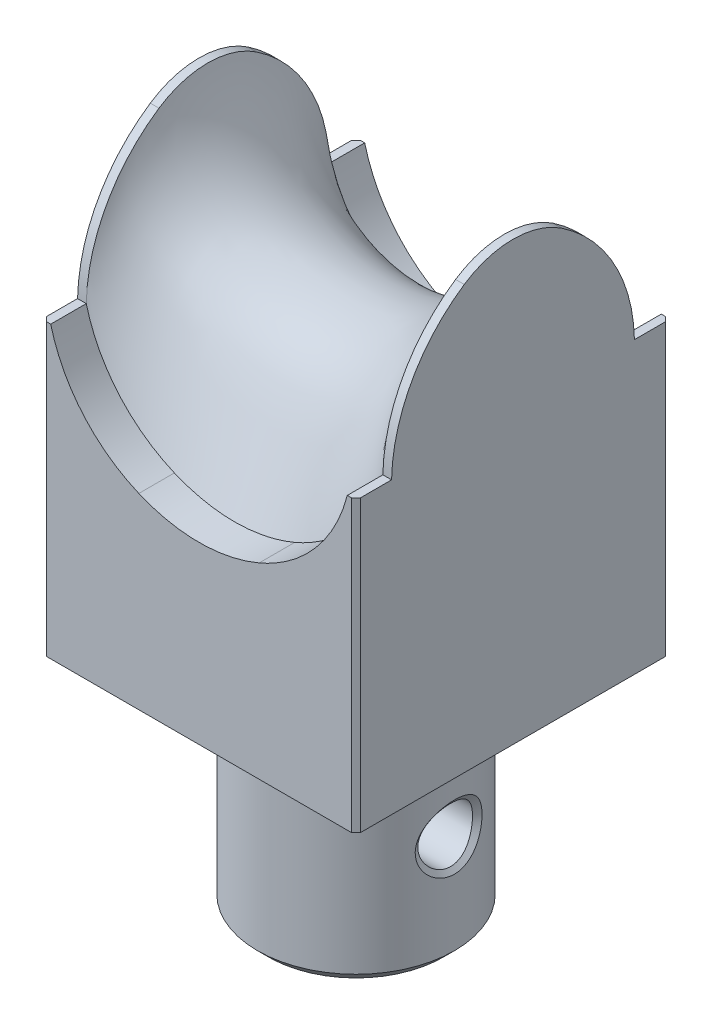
ISO-10303-21;
HEADER;
FILE_DESCRIPTION(('STEP AP214'),'2;1');
FILE_NAME('part.step','',(''),(''),'','','');
FILE_SCHEMA(('AUTOMOTIVE_DESIGN { 1 0 10303 214 1 1 1 1 }'));
ENDSEC;
DATA;
#1=APPLICATION_CONTEXT('core data for automotive mechanical design processes');
#2=APPLICATION_PROTOCOL_DEFINITION('international standard','automotive_design',2000,#1);
#3=PRODUCT_CONTEXT('',#1,'mechanical');
#4=PRODUCT('Part','Part','',(#3));
#5=PRODUCT_RELATED_PRODUCT_CATEGORY('part','',(#4));
#6=PRODUCT_DEFINITION_FORMATION('','',#4);
#7=PRODUCT_DEFINITION_CONTEXT('part definition',#1,'design');
#8=PRODUCT_DEFINITION('design','',#6,#7);
#9=PRODUCT_DEFINITION_SHAPE('','',#8);
#10=(LENGTH_UNIT() NAMED_UNIT(*) SI_UNIT(.MILLI.,.METRE.));
#11=(NAMED_UNIT(*) PLANE_ANGLE_UNIT() SI_UNIT($,.RADIAN.));
#12=(NAMED_UNIT(*) SI_UNIT($,.STERADIAN.) SOLID_ANGLE_UNIT());
#13=UNCERTAINTY_MEASURE_WITH_UNIT(LENGTH_MEASURE(1.E-05),#10,'distance_accuracy_value','');
#14=(GEOMETRIC_REPRESENTATION_CONTEXT(3) GLOBAL_UNCERTAINTY_ASSIGNED_CONTEXT((#13)) GLOBAL_UNIT_ASSIGNED_CONTEXT((#10,
#11,#12)) REPRESENTATION_CONTEXT('',''));
#15=CARTESIAN_POINT('',(0.,0.,0.));
#16=DIRECTION('',(0.,0.,1.));
#17=DIRECTION('',(1.,0.,0.));
#18=AXIS2_PLACEMENT_3D('',#15,#16,#17);
#19=CARTESIAN_POINT('',(-14.35,26.5,14.35));
#20=DIRECTION('',(0.,0.,1.));
#21=DIRECTION('',(0.,-1.,0.));
#22=AXIS2_PLACEMENT_3D('',#19,#20,#21);
#23=PLANE('',#22);
#24=DIRECTION('',(1.,0.,0.));
#25=VECTOR('',#24,1.);
#26=CARTESIAN_POINT('',(-14.35,26.5,14.35));
#27=LINE('',#26,#25);
#28=CARTESIAN_POINT('',(13.555441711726,26.5,14.35));
#29=VERTEX_POINT('',#28);
#30=CARTESIAN_POINT('',(13.931170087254,26.5,14.35));
#31=VERTEX_POINT('',#30);
#32=EDGE_CURVE('E521',#29,#31,#27,.T.);
#33=ORIENTED_EDGE('',*,*,#32,.F.);
#34=CARTESIAN_POINT('',(13.555441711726,26.5,14.35));
#35=CARTESIAN_POINT('',(12.491808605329,22.3805666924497,14.35));
#36=CARTESIAN_POINT('',(8.30301222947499,17.4402833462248,14.35));
#37=CARTESIAN_POINT('',(0.,15.5199055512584,14.35));
#38=CARTESIAN_POINT('',(-8.30301222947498,17.4402833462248,14.35));
#39=CARTESIAN_POINT('',(-12.491808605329,22.3805666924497,14.35));
#40=CARTESIAN_POINT('',(-13.555441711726,26.5,14.35));
#41=B_SPLINE_CURVE_WITH_KNOTS('',3,(#34,#35,#36,#37,#38,#39,#40),.UNSPECIFIED.,.F.,.F.,(4,1,1,1,
4),(0.,0.333333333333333,0.500000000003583,0.666666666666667,1.),.UNSPECIFIED.);
#42=CARTESIAN_POINT('',(5.50018748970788,17.1256869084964,14.35));
#43=VERTEX_POINT('',#42);
#44=EDGE_CURVE('E550',#29,#43,#41,.T.);
#45=ORIENTED_EDGE('',*,*,#44,.T.);
#46=CARTESIAN_POINT('',(0.,30.,14.35));
#47=DIRECTION('',(0.,0.,-1.));
#48=DIRECTION('',(-1.,0.,0.));
#49=AXIS2_PLACEMENT_3D('',#46,#47,#48);
#50=CIRCLE('',#49,14.);
#51=CARTESIAN_POINT('',(-5.50018748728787,17.1256869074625,14.35));
#52=VERTEX_POINT('',#51);
#53=EDGE_CURVE('E547',#43,#52,#50,.T.);
#54=ORIENTED_EDGE('',*,*,#53,.T.);
#55=CARTESIAN_POINT('',(-13.555441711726,26.5,14.35));
#56=VERTEX_POINT('',#55);
#57=EDGE_CURVE('E907',#52,#56,#41,.T.);
#58=ORIENTED_EDGE('',*,*,#57,.T.);
#59=CARTESIAN_POINT('',(-13.931170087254,26.5,14.35));
#60=VERTEX_POINT('',#59);
#61=EDGE_CURVE('E512',#60,#56,#27,.T.);
#62=ORIENTED_EDGE('',*,*,#61,.F.);
#63=DIRECTION('',(0.,-1.,0.));
#64=VECTOR('',#63,1.);
#65=CARTESIAN_POINT('',(-13.931170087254,40.001,14.35));
#66=LINE('',#65,#64);
#67=CARTESIAN_POINT('',(-13.931170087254,0.,14.35));
#68=VERTEX_POINT('',#67);
#69=EDGE_CURVE('E587',#68,#60,#66,.F.);
#70=ORIENTED_EDGE('',*,*,#69,.F.);
#71=DIRECTION('',(1.,0.,0.));
#72=VECTOR('',#71,1.);
#73=CARTESIAN_POINT('',(-14.35,0.,14.35));
#74=LINE('',#73,#72);
#75=CARTESIAN_POINT('',(13.931170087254,0.,14.35));
#76=VERTEX_POINT('',#75);
#77=EDGE_CURVE('E520',#68,#76,#74,.T.);
#78=ORIENTED_EDGE('',*,*,#77,.T.);
#79=DIRECTION('',(0.,-1.,0.));
#80=VECTOR('',#79,1.);
#81=CARTESIAN_POINT('',(13.931170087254,40.001,14.35));
#82=LINE('',#81,#80);
#83=EDGE_CURVE('E553',#31,#76,#82,.T.);
#84=ORIENTED_EDGE('',*,*,#83,.F.);
#85=EDGE_LOOP('',(#33,#45,#54,#58,#62,#70,#78,#84));
#86=FACE_BOUND('',#85,.T.);
#87=ADVANCED_FACE('F211',(#86),#23,.T.);
#88=CARTESIAN_POINT('',(-14.35,26.1848634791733,3.89668926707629));
#89=DIRECTION('',(1.,0.,0.));
#90=DIRECTION('',(0.,0.,-1.));
#91=AXIS2_PLACEMENT_3D('',#88,#89,#90);
#92=CYLINDRICAL_SURFACE('',#91,15.);
#93=CARTESIAN_POINT('',(13.555441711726,26.1848634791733,3.89668926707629));
#94=DIRECTION('',(-1.,0.,0.));
#95=DIRECTION('',(0.,0.,-1.));
#96=AXIS2_PLACEMENT_3D('',#93,#94,#95);
#97=CIRCLE('',#96,15.);
#98=CARTESIAN_POINT('',(13.555441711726,38.6458703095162,-4.45335916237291));
#99=VERTEX_POINT('',#98);
#100=CARTESIAN_POINT('',(13.555441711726,26.5,-11.1));
#101=VERTEX_POINT('',#100);
#102=EDGE_CURVE('E385',#99,#101,#97,.T.);
#103=ORIENTED_EDGE('',*,*,#102,.F.);
#104=DIRECTION('',(1.,0.,0.));
#105=VECTOR('',#104,1.);
#106=CARTESIAN_POINT('',(-14.35,38.6458703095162,-4.45335916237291));
#107=LINE('',#106,#105);
#108=CARTESIAN_POINT('',(14.35,38.6458703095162,-4.45335916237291));
#109=VERTEX_POINT('',#108);
#110=EDGE_CURVE('E615',#99,#109,#107,.T.);
#111=ORIENTED_EDGE('',*,*,#110,.T.);
#112=CARTESIAN_POINT('',(14.35,26.1848634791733,3.89668926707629));
#113=DIRECTION('',(1.,0.,0.));
#114=DIRECTION('',(0.,0.,1.));
#115=AXIS2_PLACEMENT_3D('',#112,#113,#114);
#116=CIRCLE('',#115,15.);
#117=CARTESIAN_POINT('',(14.35,26.5,-11.1));
#118=VERTEX_POINT('',#117);
#119=EDGE_CURVE('E414',#118,#109,#116,.T.);
#120=ORIENTED_EDGE('',*,*,#119,.F.);
#121=DIRECTION('',(1.,0.,0.));
#122=VECTOR('',#121,1.);
#123=CARTESIAN_POINT('',(-14.35,26.5,-11.1));
#124=LINE('',#123,#122);
#125=EDGE_CURVE('E409',#101,#118,#124,.T.);
#126=ORIENTED_EDGE('',*,*,#125,.F.);
#127=EDGE_LOOP('',(#103,#111,#120,#126));
#128=FACE_BOUND('',#127,.T.);
#129=ADVANCED_FACE('F417',(#128),#92,.T.);
#130=CARTESIAN_POINT('',(-14.35,26.1848634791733,-3.89668926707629));
#131=DIRECTION('',(1.,0.,0.));
#132=DIRECTION('',(0.,0.,-1.));
#133=AXIS2_PLACEMENT_3D('',#130,#131,#132);
#134=CYLINDRICAL_SURFACE('',#133,15.);
#135=CARTESIAN_POINT('',(13.555441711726,26.1848634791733,-3.89668926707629));
#136=DIRECTION('',(-1.,0.,0.));
#137=DIRECTION('',(0.,0.,-1.));
#138=AXIS2_PLACEMENT_3D('',#135,#136,#137);
#139=CIRCLE('',#138,15.);
#140=CARTESIAN_POINT('',(13.555441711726,26.5,11.1));
#141=VERTEX_POINT('',#140);
#142=CARTESIAN_POINT('',(13.555441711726,38.6458703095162,4.45335916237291));
#143=VERTEX_POINT('',#142);
#144=EDGE_CURVE('E901',#141,#143,#139,.T.);
#145=ORIENTED_EDGE('',*,*,#144,.F.);
#146=DIRECTION('',(1.,0.,0.));
#147=VECTOR('',#146,1.);
#148=CARTESIAN_POINT('',(-14.35,26.5,11.1));
#149=LINE('',#148,#147);
#150=CARTESIAN_POINT('',(14.35,26.5,11.1));
#151=VERTEX_POINT('',#150);
#152=EDGE_CURVE('E541',#141,#151,#149,.T.);
#153=ORIENTED_EDGE('',*,*,#152,.T.);
#154=CARTESIAN_POINT('',(14.35,26.1848634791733,-3.89668926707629));
#155=DIRECTION('',(1.,0.,0.));
#156=DIRECTION('',(0.,0.,-1.));
#157=AXIS2_PLACEMENT_3D('',#154,#155,#156);
#158=CIRCLE('',#157,15.);
#159=CARTESIAN_POINT('',(14.35,38.6458703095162,4.45335916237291));
#160=VERTEX_POINT('',#159);
#161=EDGE_CURVE('E649',#160,#151,#158,.T.);
#162=ORIENTED_EDGE('',*,*,#161,.F.);
#163=DIRECTION('',(1.,0.,0.));
#164=VECTOR('',#163,1.);
#165=CARTESIAN_POINT('',(-14.35,38.6458703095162,4.45335916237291));
#166=LINE('',#165,#164);
#167=EDGE_CURVE('E605',#143,#160,#166,.T.);
#168=ORIENTED_EDGE('',*,*,#167,.F.);
#169=EDGE_LOOP('',(#145,#153,#162,#168));
#170=FACE_BOUND('',#169,.T.);
#171=ADVANCED_FACE('F995',(#170),#134,.T.);
#172=CARTESIAN_POINT('',(-14.35,32.,0.));
#173=DIRECTION('',(1.,0.,0.));
#174=DIRECTION('',(0.,0.,-1.));
#175=AXIS2_PLACEMENT_3D('',#172,#173,#174);
#176=CYLINDRICAL_SURFACE('',#175,8.00000000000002);
#177=CARTESIAN_POINT('',(13.555441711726,32.,0.));
#178=DIRECTION('',(-1.,0.,0.));
#179=DIRECTION('',(0.,0.,-1.));
#180=AXIS2_PLACEMENT_3D('',#177,#178,#179);
#181=CIRCLE('',#180,8.00000000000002);
#182=EDGE_CURVE('E394',#143,#99,#181,.T.);
#183=ORIENTED_EDGE('',*,*,#182,.F.);
#184=ORIENTED_EDGE('',*,*,#167,.T.);
#185=CARTESIAN_POINT('',(14.35,32.,0.));
#186=DIRECTION('',(1.,0.,0.));
#187=DIRECTION('',(0.,0.,-1.));
#188=AXIS2_PLACEMENT_3D('',#185,#186,#187);
#189=CIRCLE('',#188,8.00000000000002);
#190=EDGE_CURVE('E652',#109,#160,#189,.T.);
#191=ORIENTED_EDGE('',*,*,#190,.F.);
#192=ORIENTED_EDGE('',*,*,#110,.F.);
#193=EDGE_LOOP('',(#183,#184,#191,#192));
#194=FACE_BOUND('',#193,.T.);
#195=ADVANCED_FACE('F770',(#194),#176,.T.);
#196=CARTESIAN_POINT('',(0.,-20.,0.));
#197=DIRECTION('',(0.,1.,0.));
#198=DIRECTION('',(0.,0.,1.));
#199=AXIS2_PLACEMENT_3D('',#196,#197,#198);
#200=CYLINDRICAL_SURFACE('',#199,9.);
#201=CARTESIAN_POINT('',(-8.49613948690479,-10.0000000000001,-2.96910993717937));
#202=CARTESIAN_POINT('',(-8.49617732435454,-10.7440659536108,-2.96894580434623));
#203=CARTESIAN_POINT('',(-8.61833558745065,-11.4705801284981,-2.64477693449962));
#204=CARTESIAN_POINT('',(-8.88476207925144,-12.5043163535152,-1.55541021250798));
#205=CARTESIAN_POINT('',(-9.00016068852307,-12.8120723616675,-0.786270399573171));
#206=CARTESIAN_POINT('',(-8.99983923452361,-12.8109297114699,0.784605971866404));
#207=CARTESIAN_POINT('',(-8.88492918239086,-12.5047668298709,1.55323448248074));
#208=CARTESIAN_POINT('',(-8.61844954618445,-11.4712392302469,2.64578124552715));
#209=CARTESIAN_POINT('',(-8.49616244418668,-10.7449840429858,2.96901326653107));
#210=CARTESIAN_POINT('',(-8.49611653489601,-9.25541681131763,2.96920659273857));
#211=CARTESIAN_POINT('',(-8.61812384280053,-8.5304029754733,2.64656814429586));
#212=CARTESIAN_POINT('',(-8.8846250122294,-7.4960779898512,1.55507231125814));
#213=CARTESIAN_POINT('',(-8.99995206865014,-7.18874263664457,0.784325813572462));
#214=CARTESIAN_POINT('',(-9.00004779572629,-7.18825545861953,-0.786535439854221));
#215=CARTESIAN_POINT('',(-8.88503894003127,-7.49485827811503,-1.55364012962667));
#216=CARTESIAN_POINT('',(-8.61870251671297,-8.52770411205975,-2.64386329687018));
#217=CARTESIAN_POINT('',(-8.49610164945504,-9.25593404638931,-2.96927407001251));
#218=CARTESIAN_POINT('',(-8.49613948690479,-10.0000000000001,-2.96910993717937));
#219=B_SPLINE_CURVE_WITH_KNOTS('',3,(#201,#202,#203,#204,#205,#206,#207,#208,#209,#210,#211,
#212,#213,#214,#215,#216,#217,#218),.UNSPECIFIED.,.T.,.F.,(4,2,2,2,2,2,2,2,4),
(-2.54159583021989E-05,0.0021883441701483,0.00440210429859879,0.00661586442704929,
0.00882962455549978,0.0110433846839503,0.0132571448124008,0.0154709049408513,
0.0176846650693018),.UNSPECIFIED.);
#220=CARTESIAN_POINT('',(-8.49613948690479,-10.0000000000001,-2.96910993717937));
#221=VERTEX_POINT('',#220);
#222=EDGE_CURVE('E700',#221,#221,#219,.F.);
#223=ORIENTED_EDGE('',*,*,#222,.T.);
#224=EDGE_LOOP('',(#223));
#225=FACE_BOUND('',#224,.T.);
#226=CARTESIAN_POINT('',(8.46586674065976,-9.99999999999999,3.05435759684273));
#227=CARTESIAN_POINT('',(8.46586195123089,-10.0485825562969,3.05437505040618));
#228=CARTESIAN_POINT('',(8.466366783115,-10.0971621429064,3.05308204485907));
#229=CARTESIAN_POINT('',(8.46833796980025,-10.1940865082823,3.04792631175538));
#230=CARTESIAN_POINT('',(8.46980276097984,-10.2424315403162,3.04406776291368));
#231=CARTESIAN_POINT('',(8.47363523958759,-10.3387851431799,3.03383524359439));
#232=CARTESIAN_POINT('',(8.47600233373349,-10.3867939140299,3.02746292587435));
#233=CARTESIAN_POINT('',(8.48157990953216,-10.4823761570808,3.01225946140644));
#234=CARTESIAN_POINT('',(8.48479049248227,-10.5299495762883,3.00342801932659));
#235=CARTESIAN_POINT('',(8.49199612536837,-10.6245617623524,2.9833615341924));
#236=CARTESIAN_POINT('',(8.49599173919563,-10.6716001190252,2.97212476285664));
#237=CARTESIAN_POINT('',(8.50470864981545,-10.7650430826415,2.94730254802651));
#238=CARTESIAN_POINT('',(8.50943078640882,-10.8114468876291,2.93371438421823));
#239=CARTESIAN_POINT('',(8.5195421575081,-10.903521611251,2.90424382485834));
#240=CARTESIAN_POINT('',(8.52493236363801,-10.9491913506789,2.88835808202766));
#241=CARTESIAN_POINT('',(8.53632141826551,-11.0396987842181,2.85434646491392));
#242=CARTESIAN_POINT('',(8.54232126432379,-11.0845349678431,2.83621690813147));
#243=CARTESIAN_POINT('',(8.55487123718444,-11.1732760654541,2.79777147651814));
#244=CARTESIAN_POINT('',(8.56142231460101,-11.2171792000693,2.77745180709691));
#245=CARTESIAN_POINT('',(8.57501647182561,-11.3039548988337,2.73467975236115));
#246=CARTESIAN_POINT('',(8.58206040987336,-11.3468254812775,2.71222362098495));
#247=CARTESIAN_POINT('',(8.59658198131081,-11.4314367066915,2.66523208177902));
#248=CARTESIAN_POINT('',(8.60406035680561,-11.4731752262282,2.640693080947));
#249=CARTESIAN_POINT('',(8.61939277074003,-11.5554228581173,2.58958917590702));
#250=CARTESIAN_POINT('',(8.62724742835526,-11.5959297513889,2.56302088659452));
#251=CARTESIAN_POINT('',(8.64327342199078,-11.6756147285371,2.50791160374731));
#252=CARTESIAN_POINT('',(8.65144525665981,-11.7147905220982,2.47936744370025));
#253=CARTESIAN_POINT('',(8.66805019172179,-11.7917134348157,2.42036006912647));
#254=CARTESIAN_POINT('',(8.67648368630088,-11.8294581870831,2.38989387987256));
#255=CARTESIAN_POINT('',(8.69354313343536,-11.9034207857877,2.32709440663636));
#256=CARTESIAN_POINT('',(8.70216936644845,-11.9396361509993,2.29475827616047));
#257=CARTESIAN_POINT('',(8.71959554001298,-12.0104356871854,2.22827736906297));
#258=CARTESIAN_POINT('',(8.72839573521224,-12.0450171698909,2.19412979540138));
#259=CARTESIAN_POINT('',(8.74596279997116,-12.1124638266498,2.12406435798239));
#260=CARTESIAN_POINT('',(8.75472959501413,-12.1453262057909,2.08814378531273));
#261=CARTESIAN_POINT('',(8.77203127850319,-12.2092985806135,2.01461925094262));
#262=CARTESIAN_POINT('',(8.78056577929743,-12.2404057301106,1.97701272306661));
#263=CARTESIAN_POINT('',(8.79739257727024,-12.3008132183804,1.90022316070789));
#264=CARTESIAN_POINT('',(8.80568446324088,-12.3301105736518,1.8610376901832));
#265=CARTESIAN_POINT('',(8.82196543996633,-12.3868499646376,1.78119053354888));
#266=CARTESIAN_POINT('',(8.82995403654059,-12.4142890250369,1.74052663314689));
#267=CARTESIAN_POINT('',(8.84558132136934,-12.4672615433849,1.65782454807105));
#268=CARTESIAN_POINT('',(8.85321947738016,-12.4927921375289,1.61578442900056));
#269=CARTESIAN_POINT('',(8.86809511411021,-12.5418977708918,1.53043132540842));
#270=CARTESIAN_POINT('',(8.87533204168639,-12.5654701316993,1.4871167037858));
#271=CARTESIAN_POINT('',(8.88935540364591,-12.6106091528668,1.39931612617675));
#272=CARTESIAN_POINT('',(8.8961412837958,-12.6321733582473,1.35482881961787));
#273=CARTESIAN_POINT('',(8.90921245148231,-12.6732459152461,1.2647843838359));
#274=CARTESIAN_POINT('',(8.91549719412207,-12.6927520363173,1.21922615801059));
#275=CARTESIAN_POINT('',(8.92751604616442,-12.7296582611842,1.12714143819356));
#276=CARTESIAN_POINT('',(8.93324961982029,-12.7470563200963,1.08061405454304));
#277=CARTESIAN_POINT('',(8.94411607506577,-12.7796962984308,0.986692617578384));
#278=CARTESIAN_POINT('',(8.94924841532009,-12.7949362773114,0.939297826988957));
#279=CARTESIAN_POINT('',(8.95886236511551,-12.8232100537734,0.843743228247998));
#280=CARTESIAN_POINT('',(8.96334339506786,-12.8362418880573,0.795582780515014));
#281=CARTESIAN_POINT('',(8.97160472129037,-12.8600494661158,0.698598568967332));
#282=CARTESIAN_POINT('',(8.97538434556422,-12.870823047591,0.649774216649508));
#283=CARTESIAN_POINT('',(8.98219290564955,-12.890064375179,0.551563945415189));
#284=CARTESIAN_POINT('',(8.98522099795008,-12.8985295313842,0.50217745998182));
#285=CARTESIAN_POINT('',(8.99047665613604,-12.9131045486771,0.402944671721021));
#286=CARTESIAN_POINT('',(8.99270309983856,-12.9192111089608,0.353097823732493));
#287=CARTESIAN_POINT('',(8.99630560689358,-12.9290195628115,0.25304613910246));
#288=CARTESIAN_POINT('',(8.9976801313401,-12.9327171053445,0.202840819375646));
#289=CARTESIAN_POINT('',(8.99952956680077,-12.9376592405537,0.102173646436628));
#290=CARTESIAN_POINT('',(9.00000235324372,-12.9388980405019,0.0517114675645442));
#291=CARTESIAN_POINT('',(8.99999747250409,-12.9388720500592,-0.0492276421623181));
#292=CARTESIAN_POINT('',(8.99951951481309,-12.9376064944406,-0.0997045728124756));
#293=CARTESIAN_POINT('',(8.99765767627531,-12.9326081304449,-0.200428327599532));
#294=CARTESIAN_POINT('',(8.99627540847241,-12.928879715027,-0.250675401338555));
#295=CARTESIAN_POINT('',(8.99265632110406,-12.9190081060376,-0.350834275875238));
#296=CARTESIAN_POINT('',(8.99042061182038,-12.9128680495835,-0.400746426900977));
#297=CARTESIAN_POINT('',(8.98514531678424,-12.8982243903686,-0.500130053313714));
#298=CARTESIAN_POINT('',(8.98210650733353,-12.8897230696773,-0.549601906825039));
#299=CARTESIAN_POINT('',(8.97527565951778,-12.8704079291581,-0.647999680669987));
#300=CARTESIAN_POINT('',(8.97148419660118,-12.8595958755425,-0.696925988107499));
#301=CARTESIAN_POINT('',(8.96319852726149,-12.8357099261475,-0.794127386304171));
#302=CARTESIAN_POINT('',(8.95870479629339,-12.8226375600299,-0.842402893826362));
#303=CARTESIAN_POINT('',(8.94906499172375,-12.7942813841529,-0.93819737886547));
#304=CARTESIAN_POINT('',(8.94391936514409,-12.7789990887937,-0.985716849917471));
#305=CARTESIAN_POINT('',(8.93302610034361,-12.7462732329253,-1.07989388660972));
#306=CARTESIAN_POINT('',(8.92727892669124,-12.7288313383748,-1.12655208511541));
#307=CARTESIAN_POINT('',(8.91523286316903,-12.6918363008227,-1.2189011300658));
#308=CARTESIAN_POINT('',(8.90893447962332,-12.6722850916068,-1.26459281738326));
#309=CARTESIAN_POINT('',(8.89583625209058,-12.6311213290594,-1.35490331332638));
#310=CARTESIAN_POINT('',(8.88903696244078,-12.6095110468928,-1.39952323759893));
#311=CARTESIAN_POINT('',(8.87498724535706,-12.5642789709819,-1.48758462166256));
#312=CARTESIAN_POINT('',(8.86773741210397,-12.5406598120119,-1.53102752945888));
#313=CARTESIAN_POINT('',(8.85283667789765,-12.4914598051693,-1.61662918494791));
#314=CARTESIAN_POINT('',(8.84518639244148,-12.4658819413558,-1.65878975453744));
#315=CARTESIAN_POINT('',(8.82953582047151,-12.4128143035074,-1.74172117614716));
#316=CARTESIAN_POINT('',(8.82153614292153,-12.3853278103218,-1.78249424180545));
#317=CARTESIAN_POINT('',(8.80523424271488,-12.3284929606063,-1.86254440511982));
#318=CARTESIAN_POINT('',(8.79693259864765,-12.2991480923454,-1.90182409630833));
#319=CARTESIAN_POINT('',(8.78008778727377,-12.2386458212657,-1.97878378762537));
#320=CARTESIAN_POINT('',(8.77154511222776,-12.2074919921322,-2.01646670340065));
#321=CARTESIAN_POINT('',(8.75422891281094,-12.1434242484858,-2.09011982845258));
#322=CARTESIAN_POINT('',(8.74545586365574,-12.1105138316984,-2.12609319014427));
#323=CARTESIAN_POINT('',(8.72787997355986,-12.0429854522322,-2.19623756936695));
#324=CARTESIAN_POINT('',(8.71907723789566,-12.0083713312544,-2.23041231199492));
#325=CARTESIAN_POINT('',(8.70165101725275,-11.9375338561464,-2.29692338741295));
#326=CARTESIAN_POINT('',(8.69302716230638,-11.901314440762,-2.32926381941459));
#327=CARTESIAN_POINT('',(8.67597693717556,-11.8273652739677,-2.3920487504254));
#328=CARTESIAN_POINT('',(8.66755017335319,-11.7896390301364,-2.4224972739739));
#329=CARTESIAN_POINT('',(8.65096245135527,-11.7127718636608,-2.48145017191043));
#330=CARTESIAN_POINT('',(8.64280096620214,-11.6736341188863,-2.50995854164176));
#331=CARTESIAN_POINT('',(8.62679874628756,-11.5940403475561,-2.5649803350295));
#332=CARTESIAN_POINT('',(8.61895738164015,-11.5535872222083,-2.59149777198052));
#333=CARTESIAN_POINT('',(8.60365392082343,-11.4714588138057,-2.64248752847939));
#334=CARTESIAN_POINT('',(8.5961910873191,-11.4297861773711,-2.66696388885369));
#335=CARTESIAN_POINT('',(8.58170225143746,-11.3453149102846,-2.71382112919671));
#336=CARTESIAN_POINT('',(8.57467541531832,-11.3025186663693,-2.7362060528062));
#337=CARTESIAN_POINT('',(8.56111638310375,-11.2158963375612,-2.77883012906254));
#338=CARTESIAN_POINT('',(8.55458327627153,-11.1720723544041,-2.79907326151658));
#339=CARTESIAN_POINT('',(8.54206942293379,-11.0834907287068,-2.83736351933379));
#340=CARTESIAN_POINT('',(8.53608772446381,-11.0387348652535,-2.8554144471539));
#341=CARTESIAN_POINT('',(8.52473438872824,-10.94838569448,-2.88927017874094));
#342=CARTESIAN_POINT('',(8.51936181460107,-10.9027938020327,-2.90507844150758));
#343=CARTESIAN_POINT('',(8.50928436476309,-10.810868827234,-2.93439889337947));
#344=CARTESIAN_POINT('',(8.50457864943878,-10.7645367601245,-2.94791397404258));
#345=CARTESIAN_POINT('',(8.49589246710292,-10.671227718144,-2.972598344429));
#346=CARTESIAN_POINT('',(8.49191137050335,-10.6242513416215,-2.9837696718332));
#347=CARTESIAN_POINT('',(8.48473186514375,-10.5297499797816,-3.00371709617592));
#348=CARTESIAN_POINT('',(8.48153318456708,-10.4822251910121,-3.0124940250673));
#349=CARTESIAN_POINT('',(8.47597576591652,-10.3867232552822,-3.0276036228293));
#350=CARTESIAN_POINT('',(8.47361729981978,-10.3387459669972,-3.03393550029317));
#351=CARTESIAN_POINT('',(8.46979748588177,-10.2424352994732,-3.04410619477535));
#352=CARTESIAN_POINT('',(8.46833717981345,-10.1941015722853,-3.04794211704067));
#353=CARTESIAN_POINT('',(8.46637020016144,-10.0971738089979,-3.05307331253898));
#354=CARTESIAN_POINT('',(8.46586560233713,-10.0485794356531,-3.05436305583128));
#355=CARTESIAN_POINT('',(8.46586787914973,-9.95138500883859,-3.05435213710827));
#356=CARTESIAN_POINT('',(8.46637487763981,-9.90278495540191,-3.05305115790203));
#357=CARTESIAN_POINT('',(8.46834876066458,-9.80583571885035,-3.04789397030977));
#358=CARTESIAN_POINT('',(8.46981378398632,-9.75748623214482,-3.04404271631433));
#359=CARTESIAN_POINT('',(8.47364419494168,-9.66113551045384,-3.03383923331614));
#360=CARTESIAN_POINT('',(8.47600871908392,-9.61313398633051,-3.027489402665));
#361=CARTESIAN_POINT('',(8.48157936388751,-9.51757666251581,-3.01234165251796));
#362=CARTESIAN_POINT('',(8.48478535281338,-9.47002079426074,-3.00354411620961));
#363=CARTESIAN_POINT('',(8.49198029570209,-9.3754519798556,-2.98355350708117));
#364=CARTESIAN_POINT('',(8.49596962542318,-9.32843930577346,-2.97235928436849));
#365=CARTESIAN_POINT('',(8.50467286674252,-9.23505401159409,-2.94762732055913));
#366=CARTESIAN_POINT('',(8.50938747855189,-9.18868205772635,-2.93408731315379));
#367=CARTESIAN_POINT('',(8.51948306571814,-9.09667529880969,-2.90471540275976));
#368=CARTESIAN_POINT('',(8.52486492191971,-9.05104156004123,-2.88888046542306));
#369=CARTESIAN_POINT('',(8.53623691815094,-8.96060834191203,-2.85496997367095));
#370=CARTESIAN_POINT('',(8.54222801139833,-8.91581030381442,-2.83689089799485));
#371=CARTESIAN_POINT('',(8.5547604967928,-8.82714563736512,-2.79854313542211));
#372=CARTESIAN_POINT('',(8.56130283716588,-8.78328078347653,-2.77827065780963));
#373=CARTESIAN_POINT('',(8.57487992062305,-8.6965796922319,-2.73558688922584));
#374=CARTESIAN_POINT('',(8.58191555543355,-8.65374551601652,-2.71317169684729));
#375=CARTESIAN_POINT('',(8.59642130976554,-8.56920303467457,-2.66625313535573));
#376=CARTESIAN_POINT('',(8.60389223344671,-8.52749703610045,-2.64174585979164));
#377=CARTESIAN_POINT('',(8.61921092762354,-8.44530824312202,-2.59069370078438));
#378=CARTESIAN_POINT('',(8.62705939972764,-8.40482797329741,-2.56414496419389));
#379=CARTESIAN_POINT('',(8.643074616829,-8.32518788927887,-2.50906027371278));
#380=CARTESIAN_POINT('',(8.65124195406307,-8.28603081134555,-2.48052053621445));
#381=CARTESIAN_POINT('',(8.66783988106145,-8.2091347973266,-2.42150468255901));
#382=CARTESIAN_POINT('',(8.67627096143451,-8.17139883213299,-2.39102483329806));
#383=CARTESIAN_POINT('',(8.69332806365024,-8.09744111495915,-2.32817788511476));
#384=CARTESIAN_POINT('',(8.7019544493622,-8.0612226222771,-2.29580704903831));
#385=CARTESIAN_POINT('',(8.71938359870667,-7.9904018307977,-2.22923378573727));
#386=CARTESIAN_POINT('',(8.7281867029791,-7.95580319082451,-2.195027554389));
#387=CARTESIAN_POINT('',(8.74576050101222,-7.88831687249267,-2.12483081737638));
#388=CARTESIAN_POINT('',(8.75453110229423,-7.85543254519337,-2.08883706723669));
#389=CARTESIAN_POINT('',(8.77183948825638,-7.79142203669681,-2.01516320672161));
#390=CARTESIAN_POINT('',(8.78037688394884,-7.76029871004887,-1.97748052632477));
#391=CARTESIAN_POINT('',(8.79720859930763,-7.69986345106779,-1.90053685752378));
#392=CARTESIAN_POINT('',(8.80550250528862,-7.67055451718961,-1.86127342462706));
#393=CARTESIAN_POINT('',(8.82178694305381,-7.61379551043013,-1.78126964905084));
#394=CARTESIAN_POINT('',(8.82977697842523,-7.58634842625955,-1.74052708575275));
#395=CARTESIAN_POINT('',(8.84540678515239,-7.53336233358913,-1.65766809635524));
#396=CARTESIAN_POINT('',(8.85304602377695,-7.50782619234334,-1.61554973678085));
#397=CARTESIAN_POINT('',(8.8679237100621,-7.45871088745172,-1.53004168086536));
#398=CARTESIAN_POINT('',(8.8751616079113,-7.43513438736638,-1.48665035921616));
#399=CARTESIAN_POINT('',(8.88918702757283,-7.38998746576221,-1.39869901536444));
#400=CARTESIAN_POINT('',(8.89597400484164,-7.36841945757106,-1.35413766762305));
#401=CARTESIAN_POINT('',(8.90904771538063,-7.32733863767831,-1.26394888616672));
#402=CARTESIAN_POINT('',(8.91533392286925,-7.30782797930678,-1.2183203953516));
#403=CARTESIAN_POINT('',(8.92735628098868,-7.27091099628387,-1.12609998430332));
#404=CARTESIAN_POINT('',(8.93309192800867,-7.25350659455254,-1.07950722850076));
#405=CARTESIAN_POINT('',(8.94396333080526,-7.22085122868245,-0.985460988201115));
#406=CARTESIAN_POINT('',(8.94909859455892,-7.20560202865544,-0.938006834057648));
#407=CARTESIAN_POINT('',(8.9587194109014,-7.1773061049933,-0.842340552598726));
#408=CARTESIAN_POINT('',(8.9632044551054,-7.16426110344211,-0.794127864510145));
#409=CARTESIAN_POINT('',(8.97147504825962,-7.14042247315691,-0.697047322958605));
#410=CARTESIAN_POINT('',(8.97526002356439,-7.12963068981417,-0.64817896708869));
#411=CARTESIAN_POINT('',(8.98208071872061,-7.11034731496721,-0.549889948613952));
#412=CARTESIAN_POINT('',(8.98511572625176,-7.10185790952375,-0.5004688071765));
#413=CARTESIAN_POINT('',(8.99038690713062,-7.08722755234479,-0.401177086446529));
#414=CARTESIAN_POINT('',(8.99262212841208,-7.08108939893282,-0.35130604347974));
#415=CARTESIAN_POINT('',(8.99624387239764,-7.07121079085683,-0.251217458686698));
#416=CARTESIAN_POINT('',(8.99762907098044,-7.06747407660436,-0.2009994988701));
#417=CARTESIAN_POINT('',(8.99950250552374,-7.06244255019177,-0.100319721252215));
#418=CARTESIAN_POINT('',(8.99998888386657,-7.06115279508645,-0.0498576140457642));
#419=CARTESIAN_POINT('',(9.00001107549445,-7.0610767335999,0.0510695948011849));
#420=CARTESIAN_POINT('',(8.99954687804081,-7.06229045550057,0.101534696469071));
#421=CARTESIAN_POINT('',(8.99770973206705,-7.06719600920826,0.202224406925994));
#422=CARTESIAN_POINT('',(8.99633862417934,-7.07088282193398,0.252449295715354));
#423=CARTESIAN_POINT('',(8.99274002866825,-7.08067810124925,0.352554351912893));
#424=CARTESIAN_POINT('',(8.99051383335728,-7.08678291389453,0.402434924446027));
#425=CARTESIAN_POINT('',(8.98525574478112,-7.10136296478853,0.501746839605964));
#426=CARTESIAN_POINT('',(8.98222477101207,-7.10983549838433,0.551178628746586));
#427=CARTESIAN_POINT('',(8.97540803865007,-7.12909889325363,0.64948863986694));
#428=CARTESIAN_POINT('',(8.9716229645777,-7.13988765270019,0.698367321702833));
#429=CARTESIAN_POINT('',(8.96334870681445,-7.16373208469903,0.79546675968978));
#430=CARTESIAN_POINT('',(8.95886007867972,-7.17678596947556,0.843688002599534));
#431=CARTESIAN_POINT('',(8.94922931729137,-7.20510942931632,0.939368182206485));
#432=CARTESIAN_POINT('',(8.94408768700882,-7.22037730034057,0.986827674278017));
#433=CARTESIAN_POINT('',(8.93320144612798,-7.253077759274,1.08087991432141));
#434=CARTESIAN_POINT('',(8.92745733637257,-7.27050855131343,1.12747334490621));
#435=CARTESIAN_POINT('',(8.91541662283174,-7.30748404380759,1.21968895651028));
#436=CARTESIAN_POINT('',(8.90912054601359,-7.32702673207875,1.26531201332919));
#437=CARTESIAN_POINT('',(8.89602634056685,-7.3681753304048,1.3554822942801));
#438=CARTESIAN_POINT('',(8.88922877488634,-7.3897789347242,1.40003065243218));
#439=CARTESIAN_POINT('',(8.87518209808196,-7.4349987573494,1.48794689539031));
#440=CARTESIAN_POINT('',(8.86793358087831,-7.45861234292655,1.53131622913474));
#441=CARTESIAN_POINT('',(8.85303524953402,-7.50780153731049,1.61676967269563));
#442=CARTESIAN_POINT('',(8.84538604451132,-7.5333741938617,1.65885558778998));
#443=CARTESIAN_POINT('',(8.8297375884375,-7.58643098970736,1.74163758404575));
#444=CARTESIAN_POINT('',(8.82173893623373,-7.61391190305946,1.7823358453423));
#445=CARTESIAN_POINT('',(8.80543919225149,-7.6707344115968,1.86223722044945));
#446=CARTESIAN_POINT('',(8.79713866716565,-7.70007258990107,1.90144287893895));
#447=CARTESIAN_POINT('',(8.78029646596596,-7.76055954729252,1.97825629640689));
#448=CARTESIAN_POINT('',(8.77175527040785,-7.79170483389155,2.01586690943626));
#449=CARTESIAN_POINT('',(8.75444222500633,-7.85575283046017,2.08937805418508));
#450=CARTESIAN_POINT('',(8.74567083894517,-7.88865212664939,2.12528166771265));
#451=CARTESIAN_POINT('',(8.72809789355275,-7.95616271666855,2.19529871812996));
#452=CARTESIAN_POINT('',(8.71929642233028,-7.99077066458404,2.22941540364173));
#453=CARTESIAN_POINT('',(8.70187146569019,-8.06160623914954,2.29583063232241));
#454=CARTESIAN_POINT('',(8.69324767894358,-8.09783072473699,2.32813244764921));
#455=CARTESIAN_POINT('',(8.6761961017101,-8.17179889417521,2.39085826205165));
#456=CARTESIAN_POINT('',(8.66776798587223,-8.20953972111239,2.42128554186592));
#457=CARTESIAN_POINT('',(8.65117630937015,-8.28644330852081,2.48021204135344));
#458=CARTESIAN_POINT('',(8.6430123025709,-8.32560340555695,2.50871461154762));
#459=CARTESIAN_POINT('',(8.62700390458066,-8.40524752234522,2.56373881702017));
#460=CARTESIAN_POINT('',(8.61915896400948,-8.44572902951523,2.59026392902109));
#461=CARTESIAN_POINT('',(8.60384737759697,-8.52791821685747,2.64128096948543));
#462=CARTESIAN_POINT('',(8.59638006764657,-8.56962352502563,2.66577651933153));
#463=CARTESIAN_POINT('',(8.58188146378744,-8.65416251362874,2.71268198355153));
#464=CARTESIAN_POINT('',(8.57484939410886,-8.69699398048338,2.73509564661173));
#465=CARTESIAN_POINT('',(8.56127924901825,-8.78368748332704,2.77778495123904));
#466=CARTESIAN_POINT('',(8.55474029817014,-8.82754750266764,2.79806440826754));
#467=CARTESIAN_POINT('',(8.54221428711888,-8.9162002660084,2.83643296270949));
#468=CARTESIAN_POINT('',(8.53622628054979,-8.96099124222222,2.85452583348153));
#469=CARTESIAN_POINT('',(8.52486004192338,-9.05140802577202,2.88846899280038));
#470=CARTESIAN_POINT('',(8.51948084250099,-9.09703237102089,2.90432284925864));
#471=CARTESIAN_POINT('',(8.50939004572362,-9.18901794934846,2.93373591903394));
#472=CARTESIAN_POINT('',(8.50467753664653,-9.23537807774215,2.94729827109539));
#473=CARTESIAN_POINT('',(8.49597786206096,-9.32873722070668,2.97207651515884));
#474=CARTESIAN_POINT('',(8.49198994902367,-9.37573552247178,2.98329482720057));
#475=CARTESIAN_POINT('',(8.48479711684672,-9.470273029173,3.00333341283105));
#476=CARTESIAN_POINT('',(8.48159175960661,-9.51781191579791,3.01215502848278));
#477=CARTESIAN_POINT('',(8.47602144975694,-9.6133324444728,3.027349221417));
#478=CARTESIAN_POINT('',(8.47365655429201,-9.66131411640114,3.03372163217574));
#479=CARTESIAN_POINT('',(8.46982471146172,-9.75762276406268,3.04396606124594));
#480=CARTESIAN_POINT('',(8.4683585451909,-9.8059500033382,3.04783590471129));
#481=CARTESIAN_POINT('',(8.46638024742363,-9.90285007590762,3.05302730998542));
#482=CARTESIAN_POINT('',(8.46586989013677,-9.95142319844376,3.05434413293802));
#483=CARTESIAN_POINT('',(8.46586674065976,-9.99999999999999,3.05435759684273));
#484=B_SPLINE_CURVE_WITH_KNOTS('',3,(#226,#227,#228,#229,#230,#231,#232,#233,#234,#235,#236,
#237,#238,#239,#240,#241,#242,#243,#244,#245,#246,#247,#248,#249,#250,#251,#252,#253,#254,#255,
#256,#257,#258,#259,#260,#261,#262,#263,#264,#265,#266,#267,#268,#269,#270,#271,#272,#273,#274,
#275,#276,#277,#278,#279,#280,#281,#282,#283,#284,#285,#286,#287,#288,#289,#290,#291,#292,#293,
#294,#295,#296,#297,#298,#299,#300,#301,#302,#303,#304,#305,#306,#307,#308,#309,#310,#311,#312,
#313,#314,#315,#316,#317,#318,#319,#320,#321,#322,#323,#324,#325,#326,#327,#328,#329,#330,#331,
#332,#333,#334,#335,#336,#337,#338,#339,#340,#341,#342,#343,#344,#345,#346,#347,#348,#349,#350,
#351,#352,#353,#354,#355,#356,#357,#358,#359,#360,#361,#362,#363,#364,#365,#366,#367,#368,#369,
#370,#371,#372,#373,#374,#375,#376,#377,#378,#379,#380,#381,#382,#383,#384,#385,#386,#387,#388,
#389,#390,#391,#392,#393,#394,#395,#396,#397,#398,#399,#400,#401,#402,#403,#404,#405,#406,#407,
#408,#409,#410,#411,#412,#413,#414,#415,#416,#417,#418,#419,#420,#421,#422,#423,#424,#425,#426,
#427,#428,#429,#430,#431,#432,#433,#434,#435,#436,#437,#438,#439,#440,#441,#442,#443,#444,#445,
#446,#447,#448,#449,#450,#451,#452,#453,#454,#455,#456,#457,#458,#459,#460,#461,#462,#463,#464,
#465,#466,#467,#468,#469,#470,#471,#472,#473,#474,#475,#476,#477,#478,#479,#480,#481,#482,#483),
.UNSPECIFIED.,.F.,.F.,(4,2,2,2,2,2,2,2,2,2,2,2,2,2,2,2,2,2,2,2,2,2,2,2,2,2,2,2,2,2,2,2,2,2,2,2,
2,2,2,2,2,2,2,2,2,2,2,2,2,2,2,2,2,2,2,2,2,2,2,2,2,2,2,2,2,2,2,2,2,2,2,2,2,2,2,2,2,2,2,2,2,2,2,2,
2,2,2,2,2,2,2,2,2,2,2,2,2,2,2,2,2,2,2,2,2,2,2,2,2,2,2,2,2,2,2,2,2,2,2,2,2,2,2,2,2,2,2,2,4),(0.,
0.145722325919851,0.291207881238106,0.43659794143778,0.582005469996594,0.727517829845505,
0.873199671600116,1.01909593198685,1.16523489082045,1.31163124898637,1.45828920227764,
1.60520549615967,1.75237245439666,1.89978097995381,2.04742352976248,2.19529706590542,
2.34340598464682,2.4917486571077,2.6403253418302,2.78914075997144,2.93818907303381,
3.08745673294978,3.23692530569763,3.38657426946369,3.53638379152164,3.68633748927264,
3.83642518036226,3.98664562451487,4.13700925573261,4.28754089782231,4.43828244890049,
4.58929551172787,4.74066393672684,4.89207862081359,5.04322395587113,5.19417332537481,
5.34497731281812,5.49566644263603,5.64625399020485,5.79673882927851,5.94710829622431,
6.09734105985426,6.24740999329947,6.39728505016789,6.54693615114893,6.69633608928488,
6.8454634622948,6.99430563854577,7.14286175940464,7.29109701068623,7.43898676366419,
7.58655031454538,7.73380016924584,7.88074475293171,8.02739115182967,8.17374788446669,
8.31982770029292,8.46565040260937,8.61124568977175,8.75665600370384,8.90193936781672,
9.04717218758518,9.19245197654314,9.33789995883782,9.48366348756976,9.62944486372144,
9.77494385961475,9.92030353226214,10.0656404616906,10.2110472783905,10.3565953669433,
10.5023376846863,10.6483116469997,10.7945420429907,10.9410439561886,11.0878256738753,
11.2348915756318,11.3822449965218,11.5298910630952,11.6778395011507,11.8261074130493,
11.974655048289,12.1234369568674,12.2724585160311,12.4217138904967,12.5711889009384,
12.7208638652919,12.8707164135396,13.0207242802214,13.1708680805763,13.3211340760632,
13.4715169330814,13.6220224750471,13.7726704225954,13.9234971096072,14.0745581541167,
14.2259310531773,14.3773056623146,14.5283739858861,14.6792148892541,14.8298841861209,
14.9804173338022,15.1308322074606,15.2811319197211,15.4313076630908,15.5813415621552,
15.7312095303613,15.8808841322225,16.0303374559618,16.1795440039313,16.3284836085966,
16.4771443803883,16.6255256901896,16.7736271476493,16.9214523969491,17.0690111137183,
17.2163059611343,17.363335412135,17.5100965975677,17.6565881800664,17.8028132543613,
17.9487822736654,18.0945159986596,18.240048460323,18.3854299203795,18.5307298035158,
18.6760395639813,18.821475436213,18.9671810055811),.UNSPECIFIED.);
#485=CARTESIAN_POINT('',(8.46586674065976,-9.99999999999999,3.05435759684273));
#486=VERTEX_POINT('',#485);
#487=EDGE_CURVE('E702',#486,#486,#484,.F.);
#488=ORIENTED_EDGE('',*,*,#487,.T.);
#489=EDGE_LOOP('',(#488));
#490=FACE_BOUND('',#489,.T.);
#491=CARTESIAN_POINT('',(0.,-0.999999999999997,0.));
#492=DIRECTION('',(0.,-1.,0.));
#493=DIRECTION('',(0.,0.,-1.));
#494=AXIS2_PLACEMENT_3D('',#491,#492,#493);
#495=CIRCLE('',#494,9.);
#496=CARTESIAN_POINT('',(0.,-0.999999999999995,-9.));
#497=VERTEX_POINT('',#496);
#498=EDGE_CURVE('E722',#497,#497,#495,.T.);
#499=ORIENTED_EDGE('',*,*,#498,.T.);
#500=EDGE_LOOP('',(#499));
#501=FACE_BOUND('',#500,.T.);
#502=CARTESIAN_POINT('',(0.,-19.,0.));
#503=DIRECTION('',(0.,-1.,0.));
#504=DIRECTION('',(0.,0.,-1.));
#505=AXIS2_PLACEMENT_3D('',#502,#503,#504);
#506=CIRCLE('',#505,9.);
#507=CARTESIAN_POINT('',(0.,-19.,-9.00000000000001));
#508=VERTEX_POINT('',#507);
#509=EDGE_CURVE('E726',#508,#508,#506,.F.);
#510=ORIENTED_EDGE('',*,*,#509,.T.);
#511=EDGE_LOOP('',(#510));
#512=FACE_BOUND('',#511,.T.);
#513=ADVANCED_FACE('F486',(#225,#490,#501,#512),#200,.T.);
#514=CARTESIAN_POINT('',(-14.35,0.,14.35));
#515=DIRECTION('',(0.,-1.,0.));
#516=DIRECTION('',(0.,0.,-1.));
#517=AXIS2_PLACEMENT_3D('',#514,#515,#516);
#518=PLANE('',#517);
#519=CARTESIAN_POINT('',(0.,0.,0.));
#520=DIRECTION('',(0.,-1.,0.));
#521=DIRECTION('',(0.,0.,-1.));
#522=AXIS2_PLACEMENT_3D('',#519,#520,#521);
#523=CIRCLE('',#522,10.);
#524=CARTESIAN_POINT('',(0.,0.,-10.));
#525=VERTEX_POINT('',#524);
#526=EDGE_CURVE('E717',#525,#525,#523,.F.);
#527=ORIENTED_EDGE('',*,*,#526,.T.);
#528=EDGE_LOOP('',(#527));
#529=FACE_BOUND('',#528,.T.);
#530=DIRECTION('',(0.,0.,-1.));
#531=VECTOR('',#530,1.);
#532=CARTESIAN_POINT('',(-14.35,0.,14.35));
#533=LINE('',#532,#531);
#534=CARTESIAN_POINT('',(-14.35,0.,13.931170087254));
#535=VERTEX_POINT('',#534);
#536=CARTESIAN_POINT('',(-14.35,0.,-13.931170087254));
#537=VERTEX_POINT('',#536);
#538=EDGE_CURVE('E623',#535,#537,#533,.T.);
#539=ORIENTED_EDGE('',*,*,#538,.T.);
#540=CARTESIAN_POINT('',(0.,0.,0.));
#541=DIRECTION('',(0.,-1.,0.));
#542=DIRECTION('',(0.,0.,-1.));
#543=AXIS2_PLACEMENT_3D('',#540,#541,#542);
#544=CIRCLE('',#543,20.);
#545=CARTESIAN_POINT('',(-13.931170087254,0.,-14.35));
#546=VERTEX_POINT('',#545);
#547=EDGE_CURVE('E567',#537,#546,#544,.T.);
#548=ORIENTED_EDGE('',*,*,#547,.T.);
#549=DIRECTION('',(1.,0.,0.));
#550=VECTOR('',#549,1.);
#551=CARTESIAN_POINT('',(-14.35,0.,-14.35));
#552=LINE('',#551,#550);
#553=CARTESIAN_POINT('',(13.931170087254,0.,-14.35));
#554=VERTEX_POINT('',#553);
#555=EDGE_CURVE('E441',#546,#554,#552,.T.);
#556=ORIENTED_EDGE('',*,*,#555,.T.);
#557=CARTESIAN_POINT('',(0.,0.,0.));
#558=DIRECTION('',(0.,-1.,0.));
#559=DIRECTION('',(0.,0.,-1.));
#560=AXIS2_PLACEMENT_3D('',#557,#558,#559);
#561=CIRCLE('',#560,20.);
#562=CARTESIAN_POINT('',(14.35,0.,-13.931170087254));
#563=VERTEX_POINT('',#562);
#564=EDGE_CURVE('E558',#554,#563,#561,.T.);
#565=ORIENTED_EDGE('',*,*,#564,.T.);
#566=DIRECTION('',(0.,0.,-1.));
#567=VECTOR('',#566,1.);
#568=CARTESIAN_POINT('',(14.35,0.,14.35));
#569=LINE('',#568,#567);
#570=CARTESIAN_POINT('',(14.35,0.,13.931170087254));
#571=VERTEX_POINT('',#570);
#572=EDGE_CURVE('E644',#571,#563,#569,.T.);
#573=ORIENTED_EDGE('',*,*,#572,.F.);
#574=CARTESIAN_POINT('',(0.,0.,0.));
#575=DIRECTION('',(0.,-1.,0.));
#576=DIRECTION('',(0.,0.,-1.));
#577=AXIS2_PLACEMENT_3D('',#574,#575,#576);
#578=CIRCLE('',#577,20.);
#579=EDGE_CURVE('E564',#571,#76,#578,.T.);
#580=ORIENTED_EDGE('',*,*,#579,.T.);
#581=ORIENTED_EDGE('',*,*,#77,.F.);
#582=CARTESIAN_POINT('',(0.,0.,0.));
#583=DIRECTION('',(0.,-1.,0.));
#584=DIRECTION('',(0.,0.,-1.));
#585=AXIS2_PLACEMENT_3D('',#582,#583,#584);
#586=CIRCLE('',#585,20.);
#587=EDGE_CURVE('E578',#68,#535,#586,.T.);
#588=ORIENTED_EDGE('',*,*,#587,.T.);
#589=EDGE_LOOP('',(#539,#548,#556,#565,#573,#580,#581,#588));
#590=FACE_BOUND('',#589,.T.);
#591=ADVANCED_FACE('F482',(#529,#590),#518,.T.);
#592=CARTESIAN_POINT('',(-14.35,0.,-14.35));
#593=DIRECTION('',(0.,0.,-1.));
#594=DIRECTION('',(0.,1.,0.));
#595=AXIS2_PLACEMENT_3D('',#592,#593,#594);
#596=PLANE('',#595);
#597=CARTESIAN_POINT('',(13.555441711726,26.5,-14.35));
#598=CARTESIAN_POINT('',(12.491808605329,22.3805666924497,-14.35));
#599=CARTESIAN_POINT('',(8.30301222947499,17.4402833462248,-14.35));
#600=CARTESIAN_POINT('',(0.,15.5199055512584,-14.35));
#601=CARTESIAN_POINT('',(-8.30301222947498,17.4402833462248,-14.35));
#602=CARTESIAN_POINT('',(-12.491808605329,22.3805666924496,-14.35));
#603=CARTESIAN_POINT('',(-13.555441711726,26.5,-14.35));
#604=B_SPLINE_CURVE_WITH_KNOTS('',3,(#597,#598,#599,#600,#601,#602,#603),.UNSPECIFIED.,.F.,.F.,
(4,1,1,1,4),(0.,0.333333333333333,0.500000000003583,0.666666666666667,1.),.UNSPECIFIED.);
#605=CARTESIAN_POINT('',(13.555441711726,26.5,-14.35));
#606=VERTEX_POINT('',#605);
#607=CARTESIAN_POINT('',(5.50018748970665,17.1256869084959,-14.35));
#608=VERTEX_POINT('',#607);
#609=EDGE_CURVE('E661',#606,#608,#604,.T.);
#610=ORIENTED_EDGE('',*,*,#609,.F.);
#611=DIRECTION('',(1.,0.,0.));
#612=VECTOR('',#611,1.);
#613=CARTESIAN_POINT('',(-14.35,26.5,-14.35));
#614=LINE('',#613,#612);
#615=CARTESIAN_POINT('',(13.931170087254,26.5,-14.35));
#616=VERTEX_POINT('',#615);
#617=EDGE_CURVE('E413',#606,#616,#614,.T.);
#618=ORIENTED_EDGE('',*,*,#617,.T.);
#619=DIRECTION('',(0.,-1.,0.));
#620=VECTOR('',#619,1.);
#621=CARTESIAN_POINT('',(13.931170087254,40.001,-14.35));
#622=LINE('',#621,#620);
#623=EDGE_CURVE('E574',#554,#616,#622,.F.);
#624=ORIENTED_EDGE('',*,*,#623,.F.);
#625=ORIENTED_EDGE('',*,*,#555,.F.);
#626=DIRECTION('',(0.,-1.,0.));
#627=VECTOR('',#626,1.);
#628=CARTESIAN_POINT('',(-13.931170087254,40.001,-14.35));
#629=LINE('',#628,#627);
#630=CARTESIAN_POINT('',(-13.931170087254,26.5,-14.35));
#631=VERTEX_POINT('',#630);
#632=EDGE_CURVE('E842',#631,#546,#629,.T.);
#633=ORIENTED_EDGE('',*,*,#632,.F.);
#634=CARTESIAN_POINT('',(-13.555441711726,26.5,-14.35));
#635=VERTEX_POINT('',#634);
#636=EDGE_CURVE('E420',#631,#635,#614,.T.);
#637=ORIENTED_EDGE('',*,*,#636,.T.);
#638=CARTESIAN_POINT('',(-5.50018748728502,17.1256869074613,-14.35));
#639=VERTEX_POINT('',#638);
#640=EDGE_CURVE('E839',#639,#635,#604,.T.);
#641=ORIENTED_EDGE('',*,*,#640,.F.);
#642=CARTESIAN_POINT('',(0.,30.,-14.35));
#643=DIRECTION('',(0.,0.,-1.));
#644=DIRECTION('',(-1.,0.,0.));
#645=AXIS2_PLACEMENT_3D('',#642,#643,#644);
#646=CIRCLE('',#645,14.);
#647=EDGE_CURVE('E594',#608,#639,#646,.T.);
#648=ORIENTED_EDGE('',*,*,#647,.F.);
#649=EDGE_LOOP('',(#610,#618,#624,#625,#633,#637,#641,#648));
#650=FACE_BOUND('',#649,.T.);
#651=ADVANCED_FACE('F471',(#650),#596,.T.);
#652=CARTESIAN_POINT('',(-14.35,26.1848634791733,3.89668926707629));
#653=DIRECTION('',(-1.,0.,0.));
#654=DIRECTION('',(0.,0.,1.));
#655=AXIS2_PLACEMENT_3D('',#652,#653,#654);
#656=PLANE('',#655);
#657=DIRECTION('',(0.,0.,1.));
#658=VECTOR('',#657,1.);
#659=CARTESIAN_POINT('',(-14.35,26.5,-14.35));
#660=LINE('',#659,#658);
#661=CARTESIAN_POINT('',(-14.35,26.5,-13.931170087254));
#662=VERTEX_POINT('',#661);
#663=CARTESIAN_POINT('',(-14.35,26.5,-11.1));
#664=VERTEX_POINT('',#663);
#665=EDGE_CURVE('E436',#662,#664,#660,.T.);
#666=ORIENTED_EDGE('',*,*,#665,.F.);
#667=DIRECTION('',(0.,-1.,0.));
#668=VECTOR('',#667,1.);
#669=CARTESIAN_POINT('',(-14.35,40.001,-13.931170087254));
#670=LINE('',#669,#668);
#671=EDGE_CURVE('E245',#537,#662,#670,.F.);
#672=ORIENTED_EDGE('',*,*,#671,.F.);
#673=ORIENTED_EDGE('',*,*,#538,.F.);
#674=DIRECTION('',(0.,-1.,0.));
#675=VECTOR('',#674,1.);
#676=CARTESIAN_POINT('',(-14.35,40.001,13.931170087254));
#677=LINE('',#676,#675);
#678=CARTESIAN_POINT('',(-14.35,26.5,13.931170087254));
#679=VERTEX_POINT('',#678);
#680=EDGE_CURVE('E583',#679,#535,#677,.T.);
#681=ORIENTED_EDGE('',*,*,#680,.F.);
#682=DIRECTION('',(0.,0.,1.));
#683=VECTOR('',#682,1.);
#684=CARTESIAN_POINT('',(-14.35,26.5,14.35));
#685=LINE('',#684,#683);
#686=CARTESIAN_POINT('',(-14.35,26.5,11.1));
#687=VERTEX_POINT('',#686);
#688=EDGE_CURVE('E627',#687,#679,#685,.T.);
#689=ORIENTED_EDGE('',*,*,#688,.F.);
#690=CARTESIAN_POINT('',(-14.35,26.1848634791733,-3.89668926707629));
#691=DIRECTION('',(1.,0.,0.));
#692=DIRECTION('',(0.,0.,-1.));
#693=AXIS2_PLACEMENT_3D('',#690,#691,#692);
#694=CIRCLE('',#693,15.);
#695=CARTESIAN_POINT('',(-14.35,38.6458703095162,4.45335916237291));
#696=VERTEX_POINT('',#695);
#697=EDGE_CURVE('E632',#696,#687,#694,.T.);
#698=ORIENTED_EDGE('',*,*,#697,.F.);
#699=CARTESIAN_POINT('',(-14.35,32.,0.));
#700=DIRECTION('',(1.,0.,0.));
#701=DIRECTION('',(0.,0.,-1.));
#702=AXIS2_PLACEMENT_3D('',#699,#700,#701);
#703=CIRCLE('',#702,8.00000000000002);
#704=CARTESIAN_POINT('',(-14.35,38.6458703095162,-4.45335916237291));
#705=VERTEX_POINT('',#704);
#706=EDGE_CURVE('E637',#705,#696,#703,.T.);
#707=ORIENTED_EDGE('',*,*,#706,.F.);
#708=CARTESIAN_POINT('',(-14.35,26.1848634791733,3.89668926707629));
#709=DIRECTION('',(1.,0.,0.));
#710=DIRECTION('',(0.,0.,1.));
#711=AXIS2_PLACEMENT_3D('',#708,#709,#710);
#712=CIRCLE('',#711,15.);
#713=EDGE_CURVE('E640',#664,#705,#712,.T.);
#714=ORIENTED_EDGE('',*,*,#713,.F.);
#715=EDGE_LOOP('',(#666,#672,#673,#681,#689,#698,#707,#714));
#716=FACE_BOUND('',#715,.T.);
#717=ADVANCED_FACE('F469',(#716),#656,.T.);
#718=CARTESIAN_POINT('',(-14.35,26.5,-14.35));
#719=DIRECTION('',(0.,1.,0.));
#720=DIRECTION('',(0.,0.,1.));
#721=AXIS2_PLACEMENT_3D('',#718,#719,#720);
#722=PLANE('',#721);
#723=ORIENTED_EDGE('',*,*,#636,.F.);
#724=CARTESIAN_POINT('',(0.,26.5,0.));
#725=DIRECTION('',(0.,1.,0.));
#726=DIRECTION('',(0.,0.,1.));
#727=AXIS2_PLACEMENT_3D('',#724,#725,#726);
#728=CIRCLE('',#727,20.);
#729=EDGE_CURVE('E843',#662,#631,#728,.F.);
#730=ORIENTED_EDGE('',*,*,#729,.F.);
#731=ORIENTED_EDGE('',*,*,#665,.T.);
#732=CARTESIAN_POINT('',(-13.555441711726,26.5,-11.1));
#733=VERTEX_POINT('',#732);
#734=EDGE_CURVE('E419',#664,#733,#124,.T.);
#735=ORIENTED_EDGE('',*,*,#734,.T.);
#736=CARTESIAN_POINT('',(-13.555441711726,26.5,-14.35));
#737=CARTESIAN_POINT('',(-13.555441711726,26.5,-14.0791666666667));
#738=CARTESIAN_POINT('',(-13.555441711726,26.5,-13.5375));
#739=CARTESIAN_POINT('',(-13.5554417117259,26.5,-12.725));
#740=CARTESIAN_POINT('',(-13.555441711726,26.5,-11.9125));
#741=CARTESIAN_POINT('',(-13.555441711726,26.5,-11.3708333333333));
#742=CARTESIAN_POINT('',(-13.555441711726,26.5,-11.1));
#743=B_SPLINE_CURVE_WITH_KNOTS('',3,(#736,#737,#738,#739,#740,#741,#742),.UNSPECIFIED.,.F.,.F.,
(4,1,1,1,4),(0.973509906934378,0.980132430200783,0.986754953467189,0.993377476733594,1.),.UNSPECIFIED.);
#744=EDGE_CURVE('E415',#733,#635,#743,.F.);
#745=ORIENTED_EDGE('',*,*,#744,.T.);
#746=EDGE_LOOP('',(#723,#730,#731,#735,#745));
#747=FACE_BOUND('',#746,.T.);
#748=ADVANCED_FACE('F468',(#747),#722,.T.);
#749=CARTESIAN_POINT('',(14.35,26.1848634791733,3.89668926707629));
#750=DIRECTION('',(-1.,0.,0.));
#751=DIRECTION('',(0.,0.,1.));
#752=AXIS2_PLACEMENT_3D('',#749,#750,#751);
#753=PLANE('',#752);
#754=DIRECTION('',(0.,-1.,0.));
#755=VECTOR('',#754,1.);
#756=CARTESIAN_POINT('',(14.35,40.001,13.931170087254));
#757=LINE('',#756,#755);
#758=CARTESIAN_POINT('',(14.35,26.5,13.931170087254));
#759=VERTEX_POINT('',#758);
#760=EDGE_CURVE('E570',#759,#571,#757,.T.);
#761=ORIENTED_EDGE('',*,*,#760,.T.);
#762=ORIENTED_EDGE('',*,*,#572,.T.);
#763=DIRECTION('',(0.,-1.,0.));
#764=VECTOR('',#763,1.);
#765=CARTESIAN_POINT('',(14.35,40.001,-13.931170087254));
#766=LINE('',#765,#764);
#767=CARTESIAN_POINT('',(14.35,26.5,-13.931170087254));
#768=VERTEX_POINT('',#767);
#769=EDGE_CURVE('E562',#563,#768,#766,.F.);
#770=ORIENTED_EDGE('',*,*,#769,.T.);
#771=DIRECTION('',(0.,0.,1.));
#772=VECTOR('',#771,1.);
#773=CARTESIAN_POINT('',(14.35,26.5,-14.35));
#774=LINE('',#773,#772);
#775=EDGE_CURVE('E642',#768,#118,#774,.T.);
#776=ORIENTED_EDGE('',*,*,#775,.T.);
#777=ORIENTED_EDGE('',*,*,#119,.T.);
#778=ORIENTED_EDGE('',*,*,#190,.T.);
#779=ORIENTED_EDGE('',*,*,#161,.T.);
#780=DIRECTION('',(0.,0.,1.));
#781=VECTOR('',#780,1.);
#782=CARTESIAN_POINT('',(14.35,26.5,14.35));
#783=LINE('',#782,#781);
#784=EDGE_CURVE('E646',#151,#759,#783,.T.);
#785=ORIENTED_EDGE('',*,*,#784,.T.);
#786=EDGE_LOOP('',(#761,#762,#770,#776,#777,#778,#779,#785));
#787=FACE_BOUND('',#786,.T.);
#788=ADVANCED_FACE('F494',(#787),#753,.F.);
#789=CARTESIAN_POINT('',(-14.35,26.5,14.35));
#790=DIRECTION('',(0.,1.,0.));
#791=DIRECTION('',(0.,0.,1.));
#792=AXIS2_PLACEMENT_3D('',#789,#790,#791);
#793=PLANE('',#792);
#794=ORIENTED_EDGE('',*,*,#32,.T.);
#795=CARTESIAN_POINT('',(0.,26.5,0.));
#796=DIRECTION('',(0.,1.,0.));
#797=DIRECTION('',(0.,0.,1.));
#798=AXIS2_PLACEMENT_3D('',#795,#796,#797);
#799=CIRCLE('',#798,20.);
#800=EDGE_CURVE('E559',#759,#31,#799,.F.);
#801=ORIENTED_EDGE('',*,*,#800,.F.);
#802=ORIENTED_EDGE('',*,*,#784,.F.);
#803=ORIENTED_EDGE('',*,*,#152,.F.);
#804=CARTESIAN_POINT('',(13.555441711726,26.5,14.35));
#805=CARTESIAN_POINT('',(13.555441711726,26.5,14.0791666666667));
#806=CARTESIAN_POINT('',(13.555441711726,26.5,13.5375));
#807=CARTESIAN_POINT('',(13.555441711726,26.5,12.725));
#808=CARTESIAN_POINT('',(13.555441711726,26.5,11.9125));
#809=CARTESIAN_POINT('',(13.555441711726,26.5,11.3708333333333));
#810=CARTESIAN_POINT('',(13.555441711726,26.5,11.1));
#811=B_SPLINE_CURVE_WITH_KNOTS('',3,(#804,#805,#806,#807,#808,#809,#810),.UNSPECIFIED.,.F.,.F.,
(4,1,1,1,4),(0.305552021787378,0.312174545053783,0.318797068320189,0.325419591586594,
0.332042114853),.UNSPECIFIED.);
#812=EDGE_CURVE('E537',#141,#29,#811,.F.);
#813=ORIENTED_EDGE('',*,*,#812,.T.);
#814=EDGE_LOOP('',(#794,#801,#802,#803,#813));
#815=FACE_BOUND('',#814,.T.);
#816=ADVANCED_FACE('F467',(#815),#793,.T.);
#817=ORIENTED_EDGE('',*,*,#775,.F.);
#818=CARTESIAN_POINT('',(0.,26.5,0.));
#819=DIRECTION('',(0.,1.,0.));
#820=DIRECTION('',(0.,0.,1.));
#821=AXIS2_PLACEMENT_3D('',#818,#819,#820);
#822=CIRCLE('',#821,20.);
#823=EDGE_CURVE('E576',#616,#768,#822,.F.);
#824=ORIENTED_EDGE('',*,*,#823,.F.);
#825=ORIENTED_EDGE('',*,*,#617,.F.);
#826=CARTESIAN_POINT('',(13.555441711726,26.5,-11.1));
#827=CARTESIAN_POINT('',(13.555441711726,26.5,-11.3708333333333));
#828=CARTESIAN_POINT('',(13.555441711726,26.5,-11.9125));
#829=CARTESIAN_POINT('',(13.555441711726,26.5,-12.725));
#830=CARTESIAN_POINT('',(13.555441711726,26.5,-13.5375));
#831=CARTESIAN_POINT('',(13.555441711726,26.5,-14.0791666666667));
#832=CARTESIAN_POINT('',(13.555441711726,26.5,-14.35));
#833=B_SPLINE_CURVE_WITH_KNOTS('',3,(#826,#827,#828,#829,#830,#831,#832),.UNSPECIFIED.,.F.,.F.,
(4,1,1,1,4),(0.973509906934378,0.980132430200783,0.986754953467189,0.993377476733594,1.),.UNSPECIFIED.);
#834=EDGE_CURVE('E380',#101,#606,#833,.T.);
#835=ORIENTED_EDGE('',*,*,#834,.F.);
#836=ORIENTED_EDGE('',*,*,#125,.T.);
#837=EDGE_LOOP('',(#817,#824,#825,#835,#836));
#838=FACE_BOUND('',#837,.T.);
#839=ADVANCED_FACE('F408',(#838),#722,.T.);
#840=ORIENTED_EDGE('',*,*,#688,.T.);
#841=CARTESIAN_POINT('',(0.,26.5,0.));
#842=DIRECTION('',(0.,1.,0.));
#843=DIRECTION('',(0.,0.,1.));
#844=AXIS2_PLACEMENT_3D('',#841,#842,#843);
#845=CIRCLE('',#844,20.);
#846=EDGE_CURVE('E585',#60,#679,#845,.F.);
#847=ORIENTED_EDGE('',*,*,#846,.F.);
#848=ORIENTED_EDGE('',*,*,#61,.T.);
#849=CARTESIAN_POINT('',(-13.555441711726,26.5,11.1));
#850=CARTESIAN_POINT('',(-13.555441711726,26.5,11.3708333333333));
#851=CARTESIAN_POINT('',(-13.555441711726,26.5,11.9125));
#852=CARTESIAN_POINT('',(-13.555441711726,26.5,12.725));
#853=CARTESIAN_POINT('',(-13.555441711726,26.5,13.5375));
#854=CARTESIAN_POINT('',(-13.555441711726,26.5,14.0791666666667));
#855=CARTESIAN_POINT('',(-13.555441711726,26.5,14.35));
#856=B_SPLINE_CURVE_WITH_KNOTS('',3,(#849,#850,#851,#852,#853,#854,#855),.UNSPECIFIED.,.F.,.F.,
(4,1,1,1,4),(0.305552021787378,0.312174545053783,0.318797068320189,0.325419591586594,
0.332042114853),.UNSPECIFIED.);
#857=CARTESIAN_POINT('',(-13.555441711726,26.5,11.1));
#858=VERTEX_POINT('',#857);
#859=EDGE_CURVE('E546',#858,#56,#856,.T.);
#860=ORIENTED_EDGE('',*,*,#859,.F.);
#861=EDGE_CURVE('E530',#687,#858,#149,.T.);
#862=ORIENTED_EDGE('',*,*,#861,.F.);
#863=EDGE_LOOP('',(#840,#847,#848,#860,#862));
#864=FACE_BOUND('',#863,.T.);
#865=ADVANCED_FACE('F466',(#864),#793,.T.);
#866=CARTESIAN_POINT('',(-13.555441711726,26.1848634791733,3.89668926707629));
#867=DIRECTION('',(1.,0.,0.));
#868=DIRECTION('',(0.,0.,1.));
#869=AXIS2_PLACEMENT_3D('',#866,#867,#868);
#870=CIRCLE('',#869,15.);
#871=CARTESIAN_POINT('',(-13.555441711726,38.6458703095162,-4.45335916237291));
#872=VERTEX_POINT('',#871);
#873=EDGE_CURVE('E851',#733,#872,#870,.T.);
#874=ORIENTED_EDGE('',*,*,#873,.F.);
#875=ORIENTED_EDGE('',*,*,#734,.F.);
#876=ORIENTED_EDGE('',*,*,#713,.T.);
#877=EDGE_CURVE('E617',#705,#872,#107,.T.);
#878=ORIENTED_EDGE('',*,*,#877,.T.);
#879=EDGE_LOOP('',(#874,#875,#876,#878));
#880=FACE_BOUND('',#879,.T.);
#881=ADVANCED_FACE('F850',(#880),#92,.T.);
#882=CARTESIAN_POINT('',(-13.555441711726,26.1848634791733,-3.89668926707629));
#883=DIRECTION('',(1.,0.,0.));
#884=DIRECTION('',(0.,0.,1.));
#885=AXIS2_PLACEMENT_3D('',#882,#883,#884);
#886=CIRCLE('',#885,15.);
#887=CARTESIAN_POINT('',(-13.555441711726,38.6458703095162,4.45335916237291));
#888=VERTEX_POINT('',#887);
#889=EDGE_CURVE('E1034',#888,#858,#886,.T.);
#890=ORIENTED_EDGE('',*,*,#889,.F.);
#891=EDGE_CURVE('E602',#696,#888,#166,.T.);
#892=ORIENTED_EDGE('',*,*,#891,.F.);
#893=ORIENTED_EDGE('',*,*,#697,.T.);
#894=ORIENTED_EDGE('',*,*,#861,.T.);
#895=EDGE_LOOP('',(#890,#892,#893,#894));
#896=FACE_BOUND('',#895,.T.);
#897=ADVANCED_FACE('F496',(#896),#134,.T.);
#898=CARTESIAN_POINT('',(-13.555441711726,32.,0.));
#899=DIRECTION('',(1.,0.,0.));
#900=DIRECTION('',(0.,0.,1.));
#901=AXIS2_PLACEMENT_3D('',#898,#899,#900);
#902=CIRCLE('',#901,8.00000000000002);
#903=EDGE_CURVE('E856',#872,#888,#902,.T.);
#904=ORIENTED_EDGE('',*,*,#903,.F.);
#905=ORIENTED_EDGE('',*,*,#877,.F.);
#906=ORIENTED_EDGE('',*,*,#706,.T.);
#907=ORIENTED_EDGE('',*,*,#891,.T.);
#908=EDGE_LOOP('',(#904,#905,#906,#907));
#909=FACE_BOUND('',#908,.T.);
#910=ADVANCED_FACE('F870',(#909),#176,.T.);
#911=CARTESIAN_POINT('',(0.,30.,-11.1));
#912=DIRECTION('',(0.,0.,-1.));
#913=DIRECTION('',(-1.,0.,0.));
#914=AXIS2_PLACEMENT_3D('',#911,#912,#913);
#915=CYLINDRICAL_SURFACE('',#914,14.);
#916=CARTESIAN_POINT('',(5.50018669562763,17.125686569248,-11.1000000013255));
#917=CARTESIAN_POINT('',(5.2096550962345,17.0015497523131,-11.100499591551));
#918=CARTESIAN_POINT('',(4.91493343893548,16.8872835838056,-11.1009343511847));
#919=CARTESIAN_POINT('',(4.31803473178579,16.678793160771,-11.1016079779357));
#920=CARTESIAN_POINT('',(4.01584810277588,16.5845963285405,-11.1018465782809));
#921=CARTESIAN_POINT('',(3.33171594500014,16.3965362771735,-11.1020858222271));
#922=CARTESIAN_POINT('',(2.948210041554,16.3083006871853,-11.1020146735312));
#923=CARTESIAN_POINT('',(2.17498425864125,16.1643877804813,-11.10157965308));
#924=CARTESIAN_POINT('',(1.78526177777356,16.1087244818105,-11.1012156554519));
#925=CARTESIAN_POINT('',(1.00189062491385,16.0303390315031,-11.1004811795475));
#926=CARTESIAN_POINT('',(0.608236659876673,16.0076698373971,-11.1001106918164));
#927=CARTESIAN_POINT('',(-0.179566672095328,15.995611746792,-11.0999470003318));
#928=CARTESIAN_POINT('',(-0.573715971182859,16.0062187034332,-11.100153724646));
#929=CARTESIAN_POINT('',(-1.22638004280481,16.0513863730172,-11.1006792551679));
#930=CARTESIAN_POINT('',(-1.48557984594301,16.076608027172,-11.1009363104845));
#931=CARTESIAN_POINT('',(-2.00219345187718,16.1414655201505,-11.10140605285));
#932=CARTESIAN_POINT('',(-2.25960720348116,16.1811017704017,-11.1016187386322));
#933=CARTESIAN_POINT('',(-2.77182533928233,16.2746667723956,-11.1019223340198));
#934=CARTESIAN_POINT('',(-3.02662966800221,16.3285958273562,-11.1020132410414));
#935=CARTESIAN_POINT('',(-3.53271235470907,16.4505476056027,-11.1020289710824));
#936=CARTESIAN_POINT('',(-3.78399237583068,16.5185634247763,-11.1019538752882));
#937=CARTESIAN_POINT('',(-4.28237129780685,16.6684960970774,-11.1016336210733));
#938=CARTESIAN_POINT('',(-4.52947017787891,16.7504130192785,-11.1013884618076));
#939=CARTESIAN_POINT('',(-5.01872699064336,16.9278862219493,-11.100774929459));
#940=CARTESIAN_POINT('',(-5.26088480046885,17.0234428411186,-11.1004065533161));
#941=CARTESIAN_POINT('',(-5.50018663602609,17.1256865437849,-11.100000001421));
#942=B_SPLINE_CURVE_WITH_KNOTS('',3,(#916,#917,#918,#919,#920,#921,#922,#923,#924,#925,#926,
#927,#928,#929,#930,#931,#932,#933,#934,#935,#936,#937,#938,#939,#940,#941),.UNSPECIFIED.,.F.,
.F.,(4,2,2,2,2,2,2,2,2,2,2,2,4),(0.,0.947593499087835,1.89647358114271,3.07560890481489,
4.2552513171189,5.43678504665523,6.61817153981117,7.39907660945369,8.18000396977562,
8.96094789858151,9.74150997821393,10.5220759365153,11.3026612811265),.UNSPECIFIED.);
#943=CARTESIAN_POINT('',(5.50030550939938,17.1254084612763,-11.1));
#944=VERTEX_POINT('',#943);
#945=CARTESIAN_POINT('',(-5.50031557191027,17.1253847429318,-11.1));
#946=VERTEX_POINT('',#945);
#947=EDGE_CURVE('E386',#944,#946,#942,.T.);
#948=ORIENTED_EDGE('',*,*,#947,.F.);
#949=DIRECTION('',(0.,0.,1.));
#950=VECTOR('',#949,1.);
#951=CARTESIAN_POINT('',(5.50018748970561,17.1256869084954,-12.725));
#952=LINE('',#951,#950);
#953=EDGE_CURVE('E13',#944,#608,#952,.F.);
#954=ORIENTED_EDGE('',*,*,#953,.T.);
#955=ORIENTED_EDGE('',*,*,#647,.T.);
#956=DIRECTION('',(0.,0.,1.));
#957=VECTOR('',#956,1.);
#958=CARTESIAN_POINT('',(-5.50018748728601,17.1256869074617,-12.725));
#959=LINE('',#958,#957);
#960=EDGE_CURVE('E228',#639,#946,#959,.T.);
#961=ORIENTED_EDGE('',*,*,#960,.T.);
#962=EDGE_LOOP('',(#948,#954,#955,#961));
#963=FACE_BOUND('',#962,.T.);
#964=ADVANCED_FACE('F682',(#963),#915,.F.);
#965=CARTESIAN_POINT('',(0.,30.,11.1));
#966=DIRECTION('',(0.,0.,1.));
#967=DIRECTION('',(1.,0.,0.));
#968=AXIS2_PLACEMENT_3D('',#965,#966,#967);
#969=CYLINDRICAL_SURFACE('',#968,14.);
#970=DIRECTION('',(0.,0.,1.));
#971=VECTOR('',#970,1.);
#972=CARTESIAN_POINT('',(-5.50018748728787,17.1256869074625,12.725));
#973=LINE('',#972,#971);
#974=CARTESIAN_POINT('',(-5.5001874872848,17.1256869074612,11.1));
#975=VERTEX_POINT('',#974);
#976=EDGE_CURVE('E697',#52,#975,#973,.F.);
#977=ORIENTED_EDGE('',*,*,#976,.F.);
#978=ORIENTED_EDGE('',*,*,#53,.F.);
#979=DIRECTION('',(0.,0.,1.));
#980=VECTOR('',#979,1.);
#981=CARTESIAN_POINT('',(5.50018748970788,17.1256869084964,12.725));
#982=LINE('',#981,#980);
#983=CARTESIAN_POINT('',(5.50018748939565,17.1256869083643,11.1));
#984=VERTEX_POINT('',#983);
#985=EDGE_CURVE('E844',#984,#43,#982,.T.);
#986=ORIENTED_EDGE('',*,*,#985,.F.);
#987=CARTESIAN_POINT('',(-13.555441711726,26.5,11.1));
#988=CARTESIAN_POINT('',(-12.491808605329,22.3805666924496,11.1));
#989=CARTESIAN_POINT('',(-8.30301222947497,17.4402833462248,11.1));
#990=CARTESIAN_POINT('',(0.,15.5199055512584,11.1));
#991=CARTESIAN_POINT('',(8.30301222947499,17.4402833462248,11.1));
#992=CARTESIAN_POINT('',(12.491808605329,22.3805666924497,11.1));
#993=CARTESIAN_POINT('',(13.555441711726,26.5,11.1));
#994=B_SPLINE_CURVE_WITH_KNOTS('',3,(#987,#988,#989,#990,#991,#992,#993),.UNSPECIFIED.,.F.,.F.,
(4,1,1,1,4),(0.,0.333333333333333,0.499999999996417,0.666666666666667,1.),.UNSPECIFIED.);
#995=CARTESIAN_POINT('',(-5.81367071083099E-10,16.,11.1));
#996=VERTEX_POINT('',#995);
#997=EDGE_CURVE('E699',#984,#996,#994,.F.);
#998=ORIENTED_EDGE('',*,*,#997,.T.);
#999=CARTESIAN_POINT('',(-13.555441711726,26.5,11.1));
#1000=CARTESIAN_POINT('',(-12.491808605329,22.3805666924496,11.1));
#1001=CARTESIAN_POINT('',(-8.30301222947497,17.4402833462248,11.1));
#1002=CARTESIAN_POINT('',(0.,15.5199055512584,11.1));
#1003=CARTESIAN_POINT('',(8.30301222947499,17.4402833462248,11.1));
#1004=CARTESIAN_POINT('',(12.491808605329,22.3805666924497,11.1));
#1005=CARTESIAN_POINT('',(13.555441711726,26.5,11.1));
#1006=B_SPLINE_CURVE_WITH_KNOTS('',3,(#999,#1000,#1001,#1002,#1003,#1004,#1005),.UNSPECIFIED.,
.F.,.F.,(4,1,1,1,4),(0.,0.333333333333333,0.499999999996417,0.666666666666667,1.),.UNSPECIFIED.);
#1007=EDGE_CURVE('E236',#996,#975,#1006,.F.);
#1008=ORIENTED_EDGE('',*,*,#1007,.T.);
#1009=EDGE_LOOP('',(#977,#978,#986,#998,#1008));
#1010=FACE_BOUND('',#1009,.T.);
#1011=ADVANCED_FACE('F676',(#1010),#969,.F.);
#1012=CARTESIAN_POINT('',(0.,40.001,0.));
#1013=DIRECTION('',(0.,-1.,0.));
#1014=DIRECTION('',(0.,0.,-1.));
#1015=AXIS2_PLACEMENT_3D('',#1012,#1013,#1014);
#1016=CYLINDRICAL_SURFACE('',#1015,20.);
#1017=ORIENTED_EDGE('',*,*,#69,.T.);
#1018=ORIENTED_EDGE('',*,*,#846,.T.);
#1019=ORIENTED_EDGE('',*,*,#680,.T.);
#1020=ORIENTED_EDGE('',*,*,#587,.F.);
#1021=EDGE_LOOP('',(#1017,#1018,#1019,#1020));
#1022=FACE_BOUND('',#1021,.T.);
#1023=ADVANCED_FACE('F668',(#1022),#1016,.T.);
#1024=CARTESIAN_POINT('',(0.,40.001,0.));
#1025=DIRECTION('',(0.,-1.,0.));
#1026=DIRECTION('',(0.,0.,-1.));
#1027=AXIS2_PLACEMENT_3D('',#1024,#1025,#1026);
#1028=CYLINDRICAL_SURFACE('',#1027,20.);
#1029=ORIENTED_EDGE('',*,*,#623,.T.);
#1030=ORIENTED_EDGE('',*,*,#823,.T.);
#1031=ORIENTED_EDGE('',*,*,#769,.F.);
#1032=ORIENTED_EDGE('',*,*,#564,.F.);
#1033=EDGE_LOOP('',(#1029,#1030,#1031,#1032));
#1034=FACE_BOUND('',#1033,.T.);
#1035=ADVANCED_FACE('F665',(#1034),#1028,.T.);
#1036=CARTESIAN_POINT('',(0.,40.001,0.));
#1037=DIRECTION('',(0.,-1.,0.));
#1038=DIRECTION('',(0.,0.,-1.));
#1039=AXIS2_PLACEMENT_3D('',#1036,#1037,#1038);
#1040=CYLINDRICAL_SURFACE('',#1039,20.);
#1041=ORIENTED_EDGE('',*,*,#83,.T.);
#1042=ORIENTED_EDGE('',*,*,#579,.F.);
#1043=ORIENTED_EDGE('',*,*,#760,.F.);
#1044=ORIENTED_EDGE('',*,*,#800,.T.);
#1045=EDGE_LOOP('',(#1041,#1042,#1043,#1044));
#1046=FACE_BOUND('',#1045,.T.);
#1047=ADVANCED_FACE('F667',(#1046),#1040,.T.);
#1048=CARTESIAN_POINT('',(0.,40.001,0.));
#1049=DIRECTION('',(0.,-1.,0.));
#1050=DIRECTION('',(0.,0.,-1.));
#1051=AXIS2_PLACEMENT_3D('',#1048,#1049,#1050);
#1052=CYLINDRICAL_SURFACE('',#1051,20.);
#1053=ORIENTED_EDGE('',*,*,#632,.T.);
#1054=ORIENTED_EDGE('',*,*,#547,.F.);
#1055=ORIENTED_EDGE('',*,*,#671,.T.);
#1056=ORIENTED_EDGE('',*,*,#729,.T.);
#1057=EDGE_LOOP('',(#1053,#1054,#1055,#1056));
#1058=FACE_BOUND('',#1057,.T.);
#1059=ADVANCED_FACE('F674',(#1058),#1052,.T.);
#1060=CARTESIAN_POINT('',(0.,-20.,0.));
#1061=DIRECTION('',(0.,-1.,0.));
#1062=DIRECTION('',(0.,0.,-1.));
#1063=AXIS2_PLACEMENT_3D('',#1060,#1061,#1062);
#1064=PLANE('',#1063);
#1065=CARTESIAN_POINT('',(0.,-20.,0.));
#1066=DIRECTION('',(0.,-1.,0.));
#1067=DIRECTION('',(0.,0.,-1.));
#1068=AXIS2_PLACEMENT_3D('',#1065,#1066,#1067);
#1069=CIRCLE('',#1068,8.00000000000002);
#1070=CARTESIAN_POINT('',(0.,-20.,-8.00000000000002));
#1071=VERTEX_POINT('',#1070);
#1072=EDGE_CURVE('E423',#1071,#1071,#1069,.T.);
#1073=ORIENTED_EDGE('',*,*,#1072,.T.);
#1074=EDGE_LOOP('',(#1073));
#1075=FACE_BOUND('',#1074,.T.);
#1076=ADVANCED_FACE('F749',(#1075),#1064,.T.);
#1077=CARTESIAN_POINT('',(0.,-20.,0.));
#1078=DIRECTION('',(0.,1.,0.));
#1079=DIRECTION('',(0.,0.,1.));
#1080=AXIS2_PLACEMENT_3D('',#1077,#1078,#1079);
#1081=CONICAL_SURFACE('',#1080,8.00000000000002,0.785398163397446);
#1082=ORIENTED_EDGE('',*,*,#509,.F.);
#1083=EDGE_LOOP('',(#1082));
#1084=FACE_BOUND('',#1083,.T.);
#1085=ORIENTED_EDGE('',*,*,#1072,.F.);
#1086=EDGE_LOOP('',(#1085));
#1087=FACE_BOUND('',#1086,.T.);
#1088=ADVANCED_FACE('F744',(#1084,#1087),#1081,.T.);
#1089=CARTESIAN_POINT('',(14.351,-10.,0.));
#1090=DIRECTION('',(-1.,0.,0.));
#1091=DIRECTION('',(0.,0.,1.));
#1092=AXIS2_PLACEMENT_3D('',#1089,#1090,#1091);
#1093=CYLINDRICAL_SURFACE('',#1092,2.5);
#1094=CARTESIAN_POINT('',(-8.04514026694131,-10.0000000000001,-2.5));
#1095=CARTESIAN_POINT('',(-8.04513741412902,-9.95869480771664,-2.50000998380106));
#1096=CARTESIAN_POINT('',(-8.04558838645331,-9.91739216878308,-2.49894887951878));
#1097=CARTESIAN_POINT('',(-8.04734717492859,-9.83498230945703,-2.49472499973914));
#1098=CARTESIAN_POINT('',(-8.04865354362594,-9.79387487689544,-2.49156577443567));
#1099=CARTESIAN_POINT('',(-8.05207111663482,-9.71194211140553,-2.48318967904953));
#1100=CARTESIAN_POINT('',(-8.05418160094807,-9.6711165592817,-2.47797464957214));
#1101=CARTESIAN_POINT('',(-8.0591547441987,-9.58983199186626,-2.46553248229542));
#1102=CARTESIAN_POINT('',(-8.06201718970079,-9.54937287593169,-2.45830591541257));
#1103=CARTESIAN_POINT('',(-8.06844205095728,-9.4689060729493,-2.44188523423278));
#1104=CARTESIAN_POINT('',(-8.07200457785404,-9.42889845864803,-2.43269080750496));
#1105=CARTESIAN_POINT('',(-8.07977750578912,-9.34941937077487,-2.41237873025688));
#1106=CARTESIAN_POINT('',(-8.08398819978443,-9.30994814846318,-2.4012602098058));
#1107=CARTESIAN_POINT('',(-8.09300551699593,-9.23162660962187,-2.37714391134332));
#1108=CARTESIAN_POINT('',(-8.09781250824,-9.19277669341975,-2.36414497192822));
#1109=CARTESIAN_POINT('',(-8.10797057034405,-9.11578256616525,-2.33631155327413));
#1110=CARTESIAN_POINT('',(-8.113322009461,-9.07763885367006,-2.32147583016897));
#1111=CARTESIAN_POINT('',(-8.12451718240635,-9.0021419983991,-2.2900123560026));
#1112=CARTESIAN_POINT('',(-8.13036123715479,-8.96478939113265,-2.27338343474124));
#1113=CARTESIAN_POINT('',(-8.14248991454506,-8.89095968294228,-2.23837692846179));
#1114=CARTESIAN_POINT('',(-8.14877478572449,-8.8544830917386,-2.21999835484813));
#1115=CARTESIAN_POINT('',(-8.16173332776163,-8.78249041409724,-2.18153579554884));
#1116=CARTESIAN_POINT('',(-8.16840716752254,-8.74697475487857,-2.16145106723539));
#1117=CARTESIAN_POINT('',(-8.18209211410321,-8.67698903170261,-2.11961942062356));
#1118=CARTESIAN_POINT('',(-8.18910331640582,-8.64251926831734,-2.09787203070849));
#1119=CARTESIAN_POINT('',(-8.20341058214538,-8.57471036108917,-2.05275814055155));
#1120=CARTESIAN_POINT('',(-8.21070668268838,-8.54137136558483,-2.02939142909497));
#1121=CARTESIAN_POINT('',(-8.22553455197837,-8.47590946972,-1.98108243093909));
#1122=CARTESIAN_POINT('',(-8.23306631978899,-8.44378656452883,-1.95614015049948));
#1123=CARTESIAN_POINT('',(-8.24830425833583,-8.38084074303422,-1.90472193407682));
#1124=CARTESIAN_POINT('',(-8.25601041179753,-8.35001769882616,-1.87824614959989));
#1125=CARTESIAN_POINT('',(-8.27158081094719,-8.28976136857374,-1.82380910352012));
#1126=CARTESIAN_POINT('',(-8.2794450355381,-8.26032789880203,-1.79584803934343));
#1127=CARTESIAN_POINT('',(-8.29514555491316,-8.20292523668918,-1.73847248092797));
#1128=CARTESIAN_POINT('',(-8.30298185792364,-8.17495557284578,-1.70905846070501));
#1129=CARTESIAN_POINT('',(-8.318447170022,-8.12051342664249,-1.64884966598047));
#1130=CARTESIAN_POINT('',(-8.32607627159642,-8.09404027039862,-1.61805552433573));
#1131=CARTESIAN_POINT('',(-8.34111786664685,-8.04263766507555,-1.5551751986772));
#1132=CARTESIAN_POINT('',(-8.34853044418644,-8.01770761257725,-1.52308952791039));
#1133=CARTESIAN_POINT('',(-8.36308470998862,-7.96943197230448,-1.45770855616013));
#1134=CARTESIAN_POINT('',(-8.37022650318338,-7.94608576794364,-1.4244137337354));
#1135=CARTESIAN_POINT('',(-8.38419694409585,-7.90102024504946,-1.35669845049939));
#1136=CARTESIAN_POINT('',(-8.39102572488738,-7.87930023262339,-1.32227847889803));
#1137=CARTESIAN_POINT('',(-8.40432464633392,-7.83752915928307,-1.25239640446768));
#1138=CARTESIAN_POINT('',(-8.4107949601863,-7.81747728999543,-1.21693481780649));
#1139=CARTESIAN_POINT('',(-8.42333230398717,-7.77908472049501,-1.14505312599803));
#1140=CARTESIAN_POINT('',(-8.42939955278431,-7.7607430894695,-1.10863355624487));
#1141=CARTESIAN_POINT('',(-8.44108588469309,-7.72581319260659,-1.03491948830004));
#1142=CARTESIAN_POINT('',(-8.44670523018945,-7.70922389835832,-0.99762551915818));
#1143=CARTESIAN_POINT('',(-8.45745093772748,-7.67784085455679,-0.922246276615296));
#1144=CARTESIAN_POINT('',(-8.46257759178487,-7.6630460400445,-0.884161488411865));
#1145=CARTESIAN_POINT('',(-8.4722930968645,-7.63529407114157,-0.807284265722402));
#1146=CARTESIAN_POINT('',(-8.47688224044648,-7.62233591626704,-0.768492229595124));
#1147=CARTESIAN_POINT('',(-8.48547793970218,-7.59829928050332,-0.69028421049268));
#1148=CARTESIAN_POINT('',(-8.48948474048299,-7.58722000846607,-0.650868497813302));
#1149=CARTESIAN_POINT('',(-8.49687102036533,-7.56698300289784,-0.571496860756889));
#1150=CARTESIAN_POINT('',(-8.50025062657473,-7.55782487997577,-0.53154104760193));
#1151=CARTESIAN_POINT('',(-8.50633785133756,-7.5414718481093,-0.451172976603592));
#1152=CARTESIAN_POINT('',(-8.50904538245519,-7.53427719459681,-0.410760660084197));
#1153=CARTESIAN_POINT('',(-8.51374391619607,-7.52189250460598,-0.329563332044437));
#1154=CARTESIAN_POINT('',(-8.51573449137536,-7.51670366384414,-0.288778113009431));
#1155=CARTESIAN_POINT('',(-8.51895461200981,-7.50837179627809,-0.206918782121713));
#1156=CARTESIAN_POINT('',(-8.52018323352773,-7.50523125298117,-0.165844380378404));
#1157=CARTESIAN_POINT('',(-8.52183544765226,-7.50103647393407,-0.0834901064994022));
#1158=CARTESIAN_POINT('',(-8.52225743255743,-7.49998640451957,-0.0422099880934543));
#1159=CARTESIAN_POINT('',(-8.5222513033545,-7.50001394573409,0.0403617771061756));
#1160=CARTESIAN_POINT('',(-8.52182293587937,-7.50109219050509,0.081653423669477));
#1161=CARTESIAN_POINT('',(-8.52015657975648,-7.50534411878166,0.164051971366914));
#1162=CARTESIAN_POINT('',(-8.51891975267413,-7.5085147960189,0.205159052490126));
#1163=CARTESIAN_POINT('',(-8.51568253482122,-7.51690719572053,0.287102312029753));
#1164=CARTESIAN_POINT('',(-8.51368269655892,-7.52212743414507,0.327938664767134));
#1165=CARTESIAN_POINT('',(-8.50896493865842,-7.53457540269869,0.409254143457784));
#1166=CARTESIAN_POINT('',(-8.50624714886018,-7.54180276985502,0.4497333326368));
#1167=CARTESIAN_POINT('',(-8.50013888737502,-7.55822173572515,0.530248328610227));
#1168=CARTESIAN_POINT('',(-8.49674827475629,-7.56741374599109,0.570284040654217));
#1169=CARTESIAN_POINT('',(-8.48933959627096,-7.5877191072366,0.649825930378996));
#1170=CARTESIAN_POINT('',(-8.48532123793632,-7.59883335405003,0.689331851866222));
#1171=CARTESIAN_POINT('',(-8.47670219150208,-7.62294057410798,0.767728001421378));
#1172=CARTESIAN_POINT('',(-8.47210114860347,-7.63593469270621,0.806617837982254));
#1173=CARTESIAN_POINT('',(-8.46236177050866,-7.66375927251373,0.883695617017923));
#1174=CARTESIAN_POINT('',(-8.45722308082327,-7.67859094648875,0.921883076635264));
#1175=CARTESIAN_POINT('',(-8.44645339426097,-7.71004842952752,0.997469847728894));
#1176=CARTESIAN_POINT('',(-8.44082208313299,-7.72667538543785,1.03486863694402));
#1177=CARTESIAN_POINT('',(-8.42911208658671,-7.7616813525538,1.10879174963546));
#1178=CARTESIAN_POINT('',(-8.42303314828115,-7.78006135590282,1.14531556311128));
#1179=CARTESIAN_POINT('',(-8.41047287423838,-7.81853142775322,1.21740236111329));
#1180=CARTESIAN_POINT('',(-8.40399135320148,-7.83862228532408,1.25296489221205));
#1181=CARTESIAN_POINT('',(-8.39067065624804,-7.88047210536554,1.32304266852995));
#1182=CARTESIAN_POINT('',(-8.38383135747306,-7.90223164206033,1.35755754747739));
#1183=CARTESIAN_POINT('',(-8.36984071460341,-7.94737693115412,1.42545369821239));
#1184=CARTESIAN_POINT('',(-8.36268929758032,-7.97076306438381,1.4588347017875));
#1185=CARTESIAN_POINT('',(-8.34811682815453,-8.01911940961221,1.52437613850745));
#1186=CARTESIAN_POINT('',(-8.34069573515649,-8.04408986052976,1.5565363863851));
#1187=CARTESIAN_POINT('',(-8.3256383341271,-8.09557349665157,1.61955171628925));
#1188=CARTESIAN_POINT('',(-8.31800200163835,-8.12208685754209,1.65040664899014));
#1189=CARTESIAN_POINT('',(-8.30252378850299,-8.17661174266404,1.71071802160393));
#1190=CARTESIAN_POINT('',(-8.29468187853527,-8.20462348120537,1.74017426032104));
#1191=CARTESIAN_POINT('',(-8.27897330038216,-8.26209761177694,1.79761320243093));
#1192=CARTESIAN_POINT('',(-8.27110663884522,-8.29155964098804,1.82559627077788));
#1193=CARTESIAN_POINT('',(-8.25553573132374,-8.35184859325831,1.88005795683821));
#1194=CARTESIAN_POINT('',(-8.24783138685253,-8.38267465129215,1.90653750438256));
#1195=CARTESIAN_POINT('',(-8.23260102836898,-8.4456073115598,1.95794443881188));
#1196=CARTESIAN_POINT('',(-8.22507491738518,-8.47771319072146,1.98287268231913));
#1197=CARTESIAN_POINT('',(-8.21026169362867,-8.54312451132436,2.03113805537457));
#1198=CARTESIAN_POINT('',(-8.20297445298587,-8.57642929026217,2.05447604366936));
#1199=CARTESIAN_POINT('',(-8.18868766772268,-8.64415663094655,2.09951949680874));
#1200=CARTESIAN_POINT('',(-8.18168796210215,-8.67857854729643,2.1212258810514));
#1201=CARTESIAN_POINT('',(-8.16802816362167,-8.74845865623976,2.16296529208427));
#1202=CARTESIAN_POINT('',(-8.16136786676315,-8.78391620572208,2.18299932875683));
#1203=CARTESIAN_POINT('',(-8.14843795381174,-8.85578602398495,2.22135300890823));
#1204=CARTESIAN_POINT('',(-8.14216808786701,-8.89219766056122,2.23967375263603));
#1205=CARTESIAN_POINT('',(-8.13007033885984,-8.96589410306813,2.27455985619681));
#1206=CARTESIAN_POINT('',(-8.12424216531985,-9.00317831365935,2.29112637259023));
#1207=CARTESIAN_POINT('',(-8.11307903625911,-9.07853832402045,2.32246305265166));
#1208=CARTESIAN_POINT('',(-8.10774376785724,-9.11661360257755,2.33723435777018));
#1209=CARTESIAN_POINT('',(-8.09761768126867,-9.19347413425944,2.36493972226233));
#1210=CARTESIAN_POINT('',(-8.09282656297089,-9.23225898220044,2.37787479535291));
#1211=CARTESIAN_POINT('',(-8.08383996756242,-9.3104569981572,2.40186691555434));
#1212=CARTESIAN_POINT('',(-8.07964425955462,-9.34986991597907,2.41292469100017));
#1213=CARTESIAN_POINT('',(-8.07189961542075,-9.42924238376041,2.43312159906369));
#1214=CARTESIAN_POINT('',(-8.06835059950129,-9.469201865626,2.44226096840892));
#1215=CARTESIAN_POINT('',(-8.06195039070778,-9.54958574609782,2.45858064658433));
#1216=CARTESIAN_POINT('',(-8.05909938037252,-9.5900102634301,2.46576044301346));
#1217=CARTESIAN_POINT('',(-8.05414609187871,-9.67124252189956,2.47812085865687));
#1218=CARTESIAN_POINT('',(-8.05204440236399,-9.71205053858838,2.48329990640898));
#1219=CARTESIAN_POINT('',(-8.04864061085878,-9.79396806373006,2.49161887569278));
#1220=CARTESIAN_POINT('',(-8.04733968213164,-9.83507792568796,2.49475580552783));
#1221=CARTESIAN_POINT('',(-8.0455877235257,-9.91751778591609,2.49895150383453));
#1222=CARTESIAN_POINT('',(-8.04513866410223,-9.95884807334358,2.50000545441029));
#1223=CARTESIAN_POINT('',(-8.04514187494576,-10.0415128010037,2.49999453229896));
#1224=CARTESIAN_POINT('',(-8.04559424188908,-10.0828472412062,2.4989294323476));
#1225=CARTESIAN_POINT('',(-8.04735458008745,-10.1653027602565,2.49470873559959));
#1226=CARTESIAN_POINT('',(-8.04866074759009,-10.2064241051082,2.4915575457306));
#1227=CARTESIAN_POINT('',(-8.05207598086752,-10.2883707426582,2.48320839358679));
#1228=CARTESIAN_POINT('',(-8.05418401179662,-10.3291963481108,2.47801306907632));
#1229=CARTESIAN_POINT('',(-8.05915089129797,-10.4104686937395,2.46561832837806));
#1230=CARTESIAN_POINT('',(-8.06200925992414,-10.4509156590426,2.45842019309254));
#1231=CARTESIAN_POINT('',(-8.06842483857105,-10.531348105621,2.44206225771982));
#1232=CARTESIAN_POINT('',(-8.07198194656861,-10.5713336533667,2.43290274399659));
#1233=CARTESIAN_POINT('',(-8.0797432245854,-10.6507606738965,2.41266407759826));
#1234=CARTESIAN_POINT('',(-8.08394752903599,-10.6902020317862,2.40158452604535));
#1235=CARTESIAN_POINT('',(-8.09295154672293,-10.7684580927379,2.37754751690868));
#1236=CARTESIAN_POINT('',(-8.09775152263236,-10.807272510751,2.36458923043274));
#1237=CARTESIAN_POINT('',(-8.10789533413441,-10.8841920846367,2.33683623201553));
#1238=CARTESIAN_POINT('',(-8.11323948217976,-10.9222968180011,2.32204046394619));
#1239=CARTESIAN_POINT('',(-8.12442015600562,-10.997714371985,2.29065378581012));
#1240=CARTESIAN_POINT('',(-8.1302569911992,-11.0350266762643,2.27406174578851));
#1241=CARTESIAN_POINT('',(-8.14237162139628,-11.1087766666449,2.23912366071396));
#1242=CARTESIAN_POINT('',(-8.14864969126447,-11.1452137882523,2.22077651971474));
#1243=CARTESIAN_POINT('',(-8.16159533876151,-11.2171306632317,2.18236925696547));
#1244=CARTESIAN_POINT('',(-8.16826314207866,-11.2526098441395,2.16230813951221));
#1245=CARTESIAN_POINT('',(-8.18193704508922,-11.3225280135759,2.12051391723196));
#1246=CARTESIAN_POINT('',(-8.18894331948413,-11.3569664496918,2.09877994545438));
#1247=CARTESIAN_POINT('',(-8.20324209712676,-11.424720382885,2.05368085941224));
#1248=CARTESIAN_POINT('',(-8.21053473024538,-11.4580353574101,2.03031500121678));
#1249=CARTESIAN_POINT('',(-8.22535734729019,-11.5234592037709,1.98199344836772));
#1250=CARTESIAN_POINT('',(-8.2328874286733,-11.5555675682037,1.95703709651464));
#1251=CARTESIAN_POINT('',(-8.24812411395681,-11.6184965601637,1.90557420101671));
#1252=CARTESIAN_POINT('',(-8.25583078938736,-11.6493166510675,1.87906702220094));
#1253=CARTESIAN_POINT('',(-8.27140440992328,-11.7095818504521,1.82454852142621));
#1254=CARTESIAN_POINT('',(-8.27927142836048,-11.7390263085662,1.79653650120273));
#1255=CARTESIAN_POINT('',(-8.29497821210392,-11.7964568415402,1.73904815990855));
#1256=CARTESIAN_POINT('',(-8.30281797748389,-11.8244429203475,1.70957184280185));
#1257=CARTESIAN_POINT('',(-8.31828936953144,-11.8789131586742,1.64923674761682));
#1258=CARTESIAN_POINT('',(-8.32592109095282,-11.905398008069,1.61837861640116));
#1259=CARTESIAN_POINT('',(-8.34096704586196,-11.9568203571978,1.55536951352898));
#1260=CARTESIAN_POINT('',(-8.34838136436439,-11.9817584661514,1.52321905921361));
#1261=CARTESIAN_POINT('',(-8.36293852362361,-12.0300474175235,1.45770846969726));
#1262=CARTESIAN_POINT('',(-8.37008146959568,-12.0533988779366,1.42434881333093));
#1263=CARTESIAN_POINT('',(-8.38405383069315,-12.0984730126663,1.35650459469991));
#1264=CARTESIAN_POINT('',(-8.39088337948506,-12.1201963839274,1.32202052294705));
#1265=CARTESIAN_POINT('',(-8.40418367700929,-12.1619731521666,1.25201174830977));
#1266=CARTESIAN_POINT('',(-8.41065460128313,-12.1820273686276,1.21648756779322));
#1267=CARTESIAN_POINT('',(-8.4231932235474,-12.2204244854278,1.14448295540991));
#1268=CARTESIAN_POINT('',(-8.42926114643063,-12.238768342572,1.10800307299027));
#1269=CARTESIAN_POINT('',(-8.44094910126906,-12.2737034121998,1.03417141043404));
#1270=CARTESIAN_POINT('',(-8.44656940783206,-12.2902957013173,0.996820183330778));
#1271=CARTESIAN_POINT('',(-8.45731752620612,-12.321686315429,0.921330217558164));
#1272=CARTESIAN_POINT('',(-8.46244565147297,-12.3364857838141,0.883191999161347));
#1273=CARTESIAN_POINT('',(-8.47216479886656,-12.3642494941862,0.806212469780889));
#1274=CARTESIAN_POINT('',(-8.47675614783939,-12.377214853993,0.767371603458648));
#1275=CARTESIAN_POINT('',(-8.48535716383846,-12.4012691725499,0.689071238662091));
#1276=CARTESIAN_POINT('',(-8.48936712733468,-12.412359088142,0.649612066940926));
#1277=CARTESIAN_POINT('',(-8.49676084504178,-12.4326215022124,0.570159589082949));
#1278=CARTESIAN_POINT('',(-8.50014479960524,-12.4417946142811,0.530166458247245));
#1279=CARTESIAN_POINT('',(-8.50624201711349,-12.4581825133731,0.449730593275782));
#1280=CARTESIAN_POINT('',(-8.50895529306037,-12.465397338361,0.409287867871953));
#1281=CARTESIAN_POINT('',(-8.51366685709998,-12.4778282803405,0.328037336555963));
#1282=CARTESIAN_POINT('',(-8.51566485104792,-12.4830435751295,0.287229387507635));
#1283=CARTESIAN_POINT('',(-8.51890134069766,-12.4914342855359,0.205332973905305));
#1284=CARTESIAN_POINT('',(-8.52013908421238,-12.4946076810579,0.164244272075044));
#1285=CARTESIAN_POINT('',(-8.52181198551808,-12.4988777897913,0.081870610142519));
#1286=CARTESIAN_POINT('',(-8.52224575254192,-12.4999709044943,0.040585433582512));
#1287=CARTESIAN_POINT('',(-8.52226303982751,-12.50002889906,-0.0419868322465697));
#1288=CARTESIAN_POINT('',(-8.52184656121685,-12.4989937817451,-0.0832739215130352));
#1289=CARTESIAN_POINT('',(-8.52020125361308,-12.4948174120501,-0.165653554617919));
#1290=CARTESIAN_POINT('',(-8.51897381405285,-12.4916797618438,-0.206746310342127));
#1291=CARTESIAN_POINT('',(-8.51575360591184,-12.4833465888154,-0.28865201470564));
#1292=CARTESIAN_POINT('',(-8.51376156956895,-12.4781530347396,-0.329465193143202));
#1293=CARTESIAN_POINT('',(-8.50905767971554,-12.4657517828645,-0.410726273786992));
#1294=CARTESIAN_POINT('',(-8.50634609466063,-12.4585448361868,-0.4511743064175));
#1295=CARTESIAN_POINT('',(-8.50024877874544,-12.442161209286,-0.531619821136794));
#1296=CARTESIAN_POINT('',(-8.49686301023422,-12.4329844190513,-0.571617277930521));
#1297=CARTESIAN_POINT('',(-8.48946275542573,-12.4127048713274,-0.651076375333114));
#1298=CARTESIAN_POINT('',(-8.48544805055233,-12.4016014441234,-0.690537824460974));
#1299=CARTESIAN_POINT('',(-8.47683525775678,-12.3775121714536,-0.76883964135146));
#1300=CARTESIAN_POINT('',(-8.47223686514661,-12.3645253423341,-0.807679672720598));
#1301=CARTESIAN_POINT('',(-8.46250193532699,-12.3367125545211,-0.884653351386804));
#1302=CARTESIAN_POINT('',(-8.45736507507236,-12.321885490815,-0.922786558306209));
#1303=CARTESIAN_POINT('',(-8.44659839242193,-12.2904353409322,-0.998261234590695));
#1304=CARTESIAN_POINT('',(-8.44096827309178,-12.2738111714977,-1.03560221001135));
#1305=CARTESIAN_POINT('',(-8.42926019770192,-12.238809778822,-1.10940700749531));
#1306=CARTESIAN_POINT('',(-8.42318199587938,-12.2204315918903,-1.14587033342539));
#1307=CARTESIAN_POINT('',(-8.4106229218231,-12.1819650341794,-1.21783436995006));
#1308=CARTESIAN_POINT('',(-8.40414186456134,-12.1618758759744,-1.25333462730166));
#1309=CARTESIAN_POINT('',(-8.39082200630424,-12.1200302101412,-1.3232869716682));
#1310=CARTESIAN_POINT('',(-8.38398307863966,-12.0982731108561,-1.35773868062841));
#1311=CARTESIAN_POINT('',(-8.36999327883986,-12.0531343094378,-1.42550850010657));
#1312=CARTESIAN_POINT('',(-8.362842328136,-12.0297521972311,-1.45882632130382));
#1313=CARTESIAN_POINT('',(-8.34827104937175,-11.9814063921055,-1.52424231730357));
#1314=CARTESIAN_POINT('',(-8.34085067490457,-11.9564424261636,-1.55634028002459));
#1315=CARTESIAN_POINT('',(-8.32579523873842,-11.9049750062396,-1.6192327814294));
#1316=CARTESIAN_POINT('',(-8.31816014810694,-11.8784713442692,-1.6500271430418));
#1317=CARTESIAN_POINT('',(-8.30268478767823,-11.8239703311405,-1.71022027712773));
#1318=CARTESIAN_POINT('',(-8.29484448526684,-11.79597274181,-1.73961882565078));
#1319=CARTESIAN_POINT('',(-8.27913892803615,-11.7385234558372,-1.79695248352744));
#1320=CARTESIAN_POINT('',(-8.27127367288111,-11.7090717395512,-1.82488757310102));
#1321=CARTESIAN_POINT('',(-8.2557045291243,-11.6487931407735,-1.87926930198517));
#1322=CARTESIAN_POINT('',(-8.24800061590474,-11.6179664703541,-1.90571616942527));
#1323=CARTESIAN_POINT('',(-8.23276983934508,-11.5550242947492,-1.95707237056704));
#1324=CARTESIAN_POINT('',(-8.22524294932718,-11.5229089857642,-1.9819819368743));
#1325=CARTESIAN_POINT('',(-8.21042710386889,-11.4574720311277,-2.03022283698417));
#1326=CARTESIAN_POINT('',(-8.20313809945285,-11.4241506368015,-2.05355449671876));
#1327=CARTESIAN_POINT('',(-8.18884682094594,-11.3563849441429,-2.09859651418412));
#1328=CARTESIAN_POINT('',(-8.18184446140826,-11.3219409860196,-2.12030735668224));
#1329=CARTESIAN_POINT('',(-8.1681785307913,-11.2520133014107,-2.16206521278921));
#1330=CARTESIAN_POINT('',(-8.16151482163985,-11.2165300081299,-2.18211290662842));
#1331=CARTESIAN_POINT('',(-8.14857739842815,-11.144606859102,-2.22050173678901));
#1332=CARTESIAN_POINT('',(-8.14230348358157,-11.1081675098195,-2.23884375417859));
#1333=CARTESIAN_POINT('',(-8.13019709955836,-11.0344154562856,-2.27377854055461));
#1334=CARTESIAN_POINT('',(-8.12436436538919,-10.997103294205,-2.29037236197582));
#1335=CARTESIAN_POINT('',(-8.11319173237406,-10.921688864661,-2.32176808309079));
#1336=CARTESIAN_POINT('',(-8.10785151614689,-10.8835871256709,-2.33657113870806));
#1337=CARTESIAN_POINT('',(-8.09771531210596,-10.8066768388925,-2.36434272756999));
#1338=CARTESIAN_POINT('',(-8.09291898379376,-10.767868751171,-2.37731240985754));
#1339=CARTESIAN_POINT('',(-8.08392191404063,-10.6896291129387,-2.40137475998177));
#1340=CARTESIAN_POINT('',(-8.07972086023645,-10.6501979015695,-2.41246841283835));
#1341=CARTESIAN_POINT('',(-8.07196563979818,-10.5707954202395,-2.4327363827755));
#1342=CARTESIAN_POINT('',(-8.06841126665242,-10.5308243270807,-2.44191131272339));
#1343=CARTESIAN_POINT('',(-8.06200064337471,-10.4504254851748,-2.45829968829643));
#1344=CARTESIAN_POINT('',(-8.05914440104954,-10.4099977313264,-2.46551311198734));
#1345=CARTESIAN_POINT('',(-8.0541810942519,-10.3287691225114,-2.47793674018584));
#1346=CARTESIAN_POINT('',(-8.05207439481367,-10.2879680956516,-2.48314596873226));
#1347=CARTESIAN_POINT('',(-8.04866132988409,-10.2060759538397,-2.49151925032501));
#1348=CARTESIAN_POINT('',(-8.04735586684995,-10.1649845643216,-2.49468099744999));
#1349=CARTESIAN_POINT('',(-8.04559530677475,-10.0825965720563,-2.49891978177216));
#1350=CARTESIAN_POINT('',(-8.04514186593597,-10.0412997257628,-2.49999275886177));
#1351=CARTESIAN_POINT('',(-8.04514026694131,-10.0000000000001,-2.5));
#1352=B_SPLINE_CURVE_WITH_KNOTS('',3,(#1094,#1095,#1096,#1097,#1098,#1099,#1100,#1101,#1102,
#1103,#1104,#1105,#1106,#1107,#1108,#1109,#1110,#1111,#1112,#1113,#1114,#1115,#1116,#1117,#1118,
#1119,#1120,#1121,#1122,#1123,#1124,#1125,#1126,#1127,#1128,#1129,#1130,#1131,#1132,#1133,#1134,
#1135,#1136,#1137,#1138,#1139,#1140,#1141,#1142,#1143,#1144,#1145,#1146,#1147,#1148,#1149,#1150,
#1151,#1152,#1153,#1154,#1155,#1156,#1157,#1158,#1159,#1160,#1161,#1162,#1163,#1164,#1165,#1166,
#1167,#1168,#1169,#1170,#1171,#1172,#1173,#1174,#1175,#1176,#1177,#1178,#1179,#1180,#1181,#1182,
#1183,#1184,#1185,#1186,#1187,#1188,#1189,#1190,#1191,#1192,#1193,#1194,#1195,#1196,#1197,#1198,
#1199,#1200,#1201,#1202,#1203,#1204,#1205,#1206,#1207,#1208,#1209,#1210,#1211,#1212,#1213,#1214,
#1215,#1216,#1217,#1218,#1219,#1220,#1221,#1222,#1223,#1224,#1225,#1226,#1227,#1228,#1229,#1230,
#1231,#1232,#1233,#1234,#1235,#1236,#1237,#1238,#1239,#1240,#1241,#1242,#1243,#1244,#1245,#1246,
#1247,#1248,#1249,#1250,#1251,#1252,#1253,#1254,#1255,#1256,#1257,#1258,#1259,#1260,#1261,#1262,
#1263,#1264,#1265,#1266,#1267,#1268,#1269,#1270,#1271,#1272,#1273,#1274,#1275,#1276,#1277,#1278,
#1279,#1280,#1281,#1282,#1283,#1284,#1285,#1286,#1287,#1288,#1289,#1290,#1291,#1292,#1293,#1294,
#1295,#1296,#1297,#1298,#1299,#1300,#1301,#1302,#1303,#1304,#1305,#1306,#1307,#1308,#1309,#1310,
#1311,#1312,#1313,#1314,#1315,#1316,#1317,#1318,#1319,#1320,#1321,#1322,#1323,#1324,#1325,#1326,
#1327,#1328,#1329,#1330,#1331,#1332,#1333,#1334,#1335,#1336,#1337,#1338,#1339,#1340,#1341,#1342,
#1343,#1344,#1345,#1346,#1347,#1348,#1349,#1350,#1351),.UNSPECIFIED.,.F.,.F.,(4,2,2,2,2,2,2,2,2,
2,2,2,2,2,2,2,2,2,2,2,2,2,2,2,2,2,2,2,2,2,2,2,2,2,2,2,2,2,2,2,2,2,2,2,2,2,2,2,2,2,2,2,2,2,2,2,2,
2,2,2,2,2,2,2,2,2,2,2,2,2,2,2,2,2,2,2,2,2,2,2,2,2,2,2,2,2,2,2,2,2,2,2,2,2,2,2,2,2,2,2,2,2,2,2,2,
2,2,2,2,2,2,2,2,2,2,2,2,2,2,2,2,2,2,2,2,2,2,2,4),(0.,0.123895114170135,0.2475811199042,
0.371156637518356,0.494697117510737,0.618257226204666,0.74187334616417,0.865566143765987,
0.989343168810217,1.11320146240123,1.23713015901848,1.36111307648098,1.48513129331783,
1.60916571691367,1.73319964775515,1.85722134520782,1.98122659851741,2.10519165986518,
2.2291004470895,2.35296047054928,2.47677199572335,2.60053038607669,2.72422845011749,
2.84785879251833,2.97141617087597,3.09489985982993,3.21831602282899,3.34168008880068,
3.46501912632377,3.58837420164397,3.71180269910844,3.83538057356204,3.95920449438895,
4.08306531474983,4.20674856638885,4.33034242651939,4.45391395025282,4.57751138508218,
4.70116657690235,4.82489742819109,4.9487103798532,5.07260289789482,5.19656595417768,
5.32058649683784,5.44464991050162,5.56874246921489,5.6928537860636,5.81697926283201,
5.94112254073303,6.06523491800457,6.18926968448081,6.31323534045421,6.43713351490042,
6.56096134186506,6.68471384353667,6.80838631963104,6.93197674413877,7.05548817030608,
7.17893114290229,7.30232611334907,7.42570584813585,7.54911781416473,7.67262651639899,
7.7963157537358,7.92029074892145,8.0442790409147,8.16800623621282,8.29157429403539,
8.41506350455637,8.53853469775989,8.66203157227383,8.78558309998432,8.90920597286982,
9.03290706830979,9.15668591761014,9.28053716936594,9.40445304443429,9.5284257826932,
9.65245008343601,9.77652554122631,9.90065907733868,10.0247922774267,10.1488679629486,
10.2728944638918,10.3968723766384,10.5207969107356,10.6446602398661,10.7684538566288,
10.8921709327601,11.0158086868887,11.1393707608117,11.262869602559,11.3863288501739,
11.5097857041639,11.6332932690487,11.7569228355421,11.8807660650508,12.0046091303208,
12.1282405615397,12.2517538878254,12.3752211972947,12.4986954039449,12.622212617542,
12.7457945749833,12.8694511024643,12.9931825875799,13.1169824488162,13.2408395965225,
13.3647408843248,13.488673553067,13.6126276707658,13.7365985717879,13.8605892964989,
13.9845816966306,14.1085550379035,14.2325095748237,14.3564384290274,14.4803300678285,
14.6041707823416,14.7279471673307,14.8516486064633,14.975269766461,15.0988131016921,
15.2222913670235,15.3457301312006,15.4691702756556,15.5926704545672,15.7163094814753,
15.8401885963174),.UNSPECIFIED.);
#1353=CARTESIAN_POINT('',(-8.04514026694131,-10.0000000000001,-2.5));
#1354=VERTEX_POINT('',#1353);
#1355=EDGE_CURVE('E707',#1354,#1354,#1352,.F.);
#1356=ORIENTED_EDGE('',*,*,#1355,.T.);
#1357=EDGE_LOOP('',(#1356));
#1358=FACE_BOUND('',#1357,.T.);
#1359=CARTESIAN_POINT('',(8.1458082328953,-9.99999999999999,2.5));
#1360=CARTESIAN_POINT('',(8.14586955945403,-9.33799836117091,2.49979715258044));
#1361=CARTESIAN_POINT('',(8.27077802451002,-8.69210986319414,2.2266312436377));
#1362=CARTESIAN_POINT('',(8.54236567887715,-7.77328345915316,1.30982964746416));
#1363=CARTESIAN_POINT('',(8.65993445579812,-7.49943846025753,0.662190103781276));
#1364=CARTESIAN_POINT('',(8.65956186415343,-7.50056163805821,-0.661198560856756));
#1365=CARTESIAN_POINT('',(8.54247421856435,-7.77310449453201,-1.30825584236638));
#1366=CARTESIAN_POINT('',(8.27084123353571,-8.69169769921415,-2.22761413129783));
#1367=CARTESIAN_POINT('',(8.14582121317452,-9.33761531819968,-2.49993501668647));
#1368=CARTESIAN_POINT('',(8.14579525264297,-10.6623594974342,-2.50006498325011));
#1369=CARTESIAN_POINT('',(8.27053477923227,-11.3069947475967,-2.22823998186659));
#1370=CARTESIAN_POINT('',(8.5421900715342,-12.2261699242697,-1.30966157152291));
#1371=CARTESIAN_POINT('',(8.65971553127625,-12.4998297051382,-0.660757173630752));
#1372=CARTESIAN_POINT('',(8.65978066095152,-12.5001698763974,0.66280281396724));
#1373=CARTESIAN_POINT('',(8.54260304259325,-12.2272379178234,1.30850157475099));
#1374=CARTESIAN_POINT('',(8.27111079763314,-11.3093307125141,2.22599730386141));
#1375=CARTESIAN_POINT('',(8.14574690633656,-10.6620016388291,2.50020284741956));
#1376=CARTESIAN_POINT('',(8.1458082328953,-9.99999999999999,2.5));
#1377=B_SPLINE_CURVE_WITH_KNOTS('',3,(#1359,#1360,#1361,#1362,#1363,#1364,#1365,#1366,#1367,
#1368,#1369,#1370,#1371,#1372,#1373,#1374,#1375,#1376),.UNSPECIFIED.,.T.,.F.,(4,2,2,2,2,2,2,2,
4),(-1.52839230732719E-05,0.00229978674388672,0.0046148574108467,0.00692992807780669,
0.00924499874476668,0.0115600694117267,0.0138751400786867,0.0161902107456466,
0.0185052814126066),.UNSPECIFIED.);
#1378=CARTESIAN_POINT('',(8.1458082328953,-9.99999999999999,2.5));
#1379=VERTEX_POINT('',#1378);
#1380=EDGE_CURVE('E712',#1379,#1379,#1377,.F.);
#1381=ORIENTED_EDGE('',*,*,#1380,.T.);
#1382=EDGE_LOOP('',(#1381));
#1383=FACE_BOUND('',#1382,.T.);
#1384=ADVANCED_FACE('F733',(#1358,#1383),#1093,.F.);
#1385=CARTESIAN_POINT('',(0.,-0.999999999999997,0.));
#1386=DIRECTION('',(0.,-1.,0.));
#1387=DIRECTION('',(0.,0.,-1.));
#1388=AXIS2_PLACEMENT_3D('',#1385,#1386,#1387);
#1389=TOROIDAL_SURFACE('',#1388,10.,1.);
#1390=ORIENTED_EDGE('',*,*,#526,.F.);
#1391=EDGE_LOOP('',(#1390));
#1392=FACE_BOUND('',#1391,.T.);
#1393=ORIENTED_EDGE('',*,*,#498,.F.);
#1394=EDGE_LOOP('',(#1393));
#1395=FACE_BOUND('',#1394,.T.);
#1396=ADVANCED_FACE('F743',(#1392,#1395),#1389,.F.);
#1397=CARTESIAN_POINT('',(-8.04514026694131,-10.0000000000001,-2.5));
#1398=CARTESIAN_POINT('',(-8.04517609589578,-10.6616273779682,-2.49986179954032));
#1399=CARTESIAN_POINT('',(-8.16084985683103,-11.3076467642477,-2.22691056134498));
#1400=CARTESIAN_POINT('',(-8.41313366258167,-12.2268498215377,-1.30966036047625));
#1401=CARTESIAN_POINT('',(-8.52240659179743,-12.5005079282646,-0.662044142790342));
#1402=CARTESIAN_POINT('',(-8.52210220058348,-12.4994918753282,0.660642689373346));
#1403=CARTESIAN_POINT('',(-8.4132918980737,-12.227250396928,1.30782837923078));
#1404=CARTESIAN_POINT('',(-8.16095776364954,-11.3082328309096,2.22775620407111));
#1405=CARTESIAN_POINT('',(-8.04516200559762,-10.6624436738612,2.49991860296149));
#1406=CARTESIAN_POINT('',(-8.0451185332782,-9.3379127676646,2.50008138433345));
#1407=CARTESIAN_POINT('',(-8.16064934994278,-8.69322742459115,2.22841877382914));
#1408=CARTESIAN_POINT('',(-8.41300387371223,-7.77350082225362,1.30937583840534));
#1409=CARTESIAN_POINT('',(-8.52220904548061,-7.50021677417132,0.66040667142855));
#1410=CARTESIAN_POINT('',(-8.52229969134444,-7.49978357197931,-0.662267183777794));
#1411=CARTESIAN_POINT('',(-8.41339582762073,-7.77241625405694,-1.30816994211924));
#1412=CARTESIAN_POINT('',(-8.1611973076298,-8.69082757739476,-2.22614127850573));
#1413=CARTESIAN_POINT('',(-8.04510443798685,-9.33837262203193,-2.50013820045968));
#1414=CARTESIAN_POINT('',(-8.04514026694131,-10.0000000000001,-2.5));
#1415=CARTESIAN_POINT('',(-8.49613948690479,-10.0000000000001,-2.96910993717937));
#1416=CARTESIAN_POINT('',(-8.49617732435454,-10.7440659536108,-2.96894580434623));
#1417=CARTESIAN_POINT('',(-8.61833558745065,-11.4705801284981,-2.64477693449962));
#1418=CARTESIAN_POINT('',(-8.88476207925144,-12.5043163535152,-1.55541021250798));
#1419=CARTESIAN_POINT('',(-9.00016068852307,-12.8120723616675,-0.786270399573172));
#1420=CARTESIAN_POINT('',(-8.99983923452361,-12.8109297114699,0.784605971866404));
#1421=CARTESIAN_POINT('',(-8.88492918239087,-12.5047668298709,1.55323448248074));
#1422=CARTESIAN_POINT('',(-8.61844954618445,-11.4712392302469,2.64578124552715));
#1423=CARTESIAN_POINT('',(-8.49616244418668,-10.7449840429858,2.96901326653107));
#1424=CARTESIAN_POINT('',(-8.49611653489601,-9.25541681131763,2.96920659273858));
#1425=CARTESIAN_POINT('',(-8.61812384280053,-8.5304029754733,2.64656814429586));
#1426=CARTESIAN_POINT('',(-8.8846250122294,-7.4960779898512,1.55507231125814));
#1427=CARTESIAN_POINT('',(-8.99995206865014,-7.18874263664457,0.784325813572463));
#1428=CARTESIAN_POINT('',(-9.00004779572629,-7.18825545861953,-0.786535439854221));
#1429=CARTESIAN_POINT('',(-8.88503894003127,-7.49485827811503,-1.55364012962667));
#1430=CARTESIAN_POINT('',(-8.61870251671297,-8.52770411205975,-2.64386329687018));
#1431=CARTESIAN_POINT('',(-8.49610164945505,-9.25593404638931,-2.96927407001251));
#1432=CARTESIAN_POINT('',(-8.49613948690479,-10.0000000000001,-2.96910993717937));
#1433=B_SPLINE_SURFACE_WITH_KNOTS('',1,3,((#1397,#1398,#1399,#1400,#1401,#1402,#1403,#1404,
#1405,#1406,#1407,#1408,#1409,#1410,#1411,#1412,#1413,#1414),(#1415,#1416,#1417,#1418,#1419,
#1420,#1421,#1422,#1423,#1424,#1425,#1426,#1427,#1428,#1429,#1430,#1431,#1432)),.UNSPECIFIED.,
.F.,.T.,.F.,(2,2),(4,2,2,2,2,2,2,2,4),(0.,1.),(-2.54159583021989E-05,0.0021883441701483,
0.00440210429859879,0.00661586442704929,0.00882962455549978,0.0110433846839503,
0.0132571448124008,0.0154709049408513,0.0176846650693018),.UNSPECIFIED.);
#1434=ORIENTED_EDGE('',*,*,#222,.F.);
#1435=EDGE_LOOP('',(#1434));
#1436=FACE_BOUND('',#1435,.T.);
#1437=ORIENTED_EDGE('',*,*,#1355,.F.);
#1438=EDGE_LOOP('',(#1437));
#1439=FACE_BOUND('',#1438,.T.);
#1440=ADVANCED_FACE('F786',(#1436,#1439),#1433,.T.);
#1441=CARTESIAN_POINT('',(8.46586674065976,-9.99999999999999,3.05435759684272));
#1442=CARTESIAN_POINT('',(8.46593047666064,-9.22178309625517,3.05410977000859));
#1443=CARTESIAN_POINT('',(8.59574673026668,-8.46250441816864,2.72037127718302));
#1444=CARTESIAN_POINT('',(8.87800541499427,-7.38237414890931,1.60027519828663));
#1445=CARTESIAN_POINT('',(9.00019359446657,-7.06045458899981,0.809022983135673));
#1446=CARTESIAN_POINT('',(8.9998063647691,-7.06177494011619,-0.807811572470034));
#1447=CARTESIAN_POINT('',(8.8781182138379,-7.38216378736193,-1.59835243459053));
#1448=CARTESIAN_POINT('',(8.59581242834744,-8.46201987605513,-2.72157209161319));
#1449=CARTESIAN_POINT('',(8.46588023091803,-9.22133278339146,-3.05427820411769));
#1450=CARTESIAN_POINT('',(8.46585325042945,-10.7786376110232,-3.05443698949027));
#1451=CARTESIAN_POINT('',(8.59549393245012,-11.5364430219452,-2.72233672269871));
#1452=CARTESIAN_POINT('',(8.87782290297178,-12.6169832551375,-1.60006987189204));
#1453=CARTESIAN_POINT('',(8.99996606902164,-12.9386851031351,-0.80727251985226));
#1454=CARTESIAN_POINT('',(9.00003375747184,-12.9390849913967,0.809771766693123));
#1455=CARTESIAN_POINT('',(8.87825210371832,-12.6182387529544,1.59865263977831));
#1456=CARTESIAN_POINT('',(8.59609257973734,-11.5391890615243,2.71959676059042));
#1457=CARTESIAN_POINT('',(8.46580300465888,-10.7782169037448,3.05460542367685));
#1458=CARTESIAN_POINT('',(8.46586674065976,-9.99999999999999,3.05435759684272));
#1459=CARTESIAN_POINT('',(8.1458082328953,-9.99999999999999,2.5));
#1460=CARTESIAN_POINT('',(8.14586955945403,-9.33799836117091,2.49979715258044));
#1461=CARTESIAN_POINT('',(8.27077802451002,-8.69210986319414,2.2266312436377));
#1462=CARTESIAN_POINT('',(8.54236567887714,-7.77328345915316,1.30982964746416));
#1463=CARTESIAN_POINT('',(8.65993445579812,-7.49943846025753,0.662190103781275));
#1464=CARTESIAN_POINT('',(8.65956186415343,-7.50056163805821,-0.661198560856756));
#1465=CARTESIAN_POINT('',(8.54247421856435,-7.77310449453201,-1.30825584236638));
#1466=CARTESIAN_POINT('',(8.27084123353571,-8.69169769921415,-2.22761413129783));
#1467=CARTESIAN_POINT('',(8.14582121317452,-9.33761531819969,-2.49993501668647));
#1468=CARTESIAN_POINT('',(8.14579525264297,-10.6623594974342,-2.5000649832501));
#1469=CARTESIAN_POINT('',(8.27053477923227,-11.3069947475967,-2.22823998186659));
#1470=CARTESIAN_POINT('',(8.5421900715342,-12.2261699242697,-1.3096615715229));
#1471=CARTESIAN_POINT('',(8.65971553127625,-12.4998297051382,-0.660757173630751));
#1472=CARTESIAN_POINT('',(8.65978066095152,-12.5001698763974,0.66280281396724));
#1473=CARTESIAN_POINT('',(8.54260304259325,-12.2272379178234,1.30850157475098));
#1474=CARTESIAN_POINT('',(8.27111079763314,-11.3093307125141,2.22599730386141));
#1475=CARTESIAN_POINT('',(8.14574690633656,-10.6620016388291,2.50020284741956));
#1476=CARTESIAN_POINT('',(8.1458082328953,-9.99999999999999,2.5));
#1477=B_SPLINE_SURFACE_WITH_KNOTS('',1,3,((#1441,#1442,#1443,#1444,#1445,#1446,#1447,#1448,
#1449,#1450,#1451,#1452,#1453,#1454,#1455,#1456,#1457,#1458),(#1459,#1460,#1461,#1462,#1463,
#1464,#1465,#1466,#1467,#1468,#1469,#1470,#1471,#1472,#1473,#1474,#1475,#1476)),.UNSPECIFIED.,
.F.,.T.,.F.,(2,2),(4,2,2,2,2,2,2,2,4),(0.,1.),(-1.52839230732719E-05,0.00229978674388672,
0.0046148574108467,0.00692992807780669,0.00924499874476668,0.0115600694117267,
0.0138751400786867,0.0161902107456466,0.0185052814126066),.UNSPECIFIED.);
#1478=ORIENTED_EDGE('',*,*,#1380,.F.);
#1479=EDGE_LOOP('',(#1478));
#1480=FACE_BOUND('',#1479,.T.);
#1481=ORIENTED_EDGE('',*,*,#487,.F.);
#1482=EDGE_LOOP('',(#1481));
#1483=FACE_BOUND('',#1482,.T.);
#1484=ADVANCED_FACE('F213',(#1480,#1483),#1477,.T.);
#1485=CARTESIAN_POINT('',(13.555441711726,26.5,-14.35));
#1486=CARTESIAN_POINT('',(12.491808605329,22.3805666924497,-14.35));
#1487=CARTESIAN_POINT('',(8.30301222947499,17.4402833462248,-14.35));
#1488=CARTESIAN_POINT('',(0.,15.5199055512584,-14.35));
#1489=CARTESIAN_POINT('',(-8.30301222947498,17.4402833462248,-14.35));
#1490=CARTESIAN_POINT('',(-12.491808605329,22.3805666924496,-14.35));
#1491=CARTESIAN_POINT('',(-13.555441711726,26.5,-14.35));
#1492=CARTESIAN_POINT('',(13.555441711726,26.5,-14.0791666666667));
#1493=CARTESIAN_POINT('',(12.491808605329,22.3805666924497,-14.0791666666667));
#1494=CARTESIAN_POINT('',(8.30301222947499,17.4402833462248,-14.0791666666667));
#1495=CARTESIAN_POINT('',(0.,15.5199055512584,-14.0791666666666));
#1496=CARTESIAN_POINT('',(-8.30301222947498,17.4402833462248,-14.0791666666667));
#1497=CARTESIAN_POINT('',(-12.491808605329,22.3805666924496,-14.0791666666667));
#1498=CARTESIAN_POINT('',(-13.555441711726,26.5,-14.0791666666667));
#1499=CARTESIAN_POINT('',(13.555441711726,26.5,-13.5375));
#1500=CARTESIAN_POINT('',(12.491808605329,22.3805666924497,-13.5375));
#1501=CARTESIAN_POINT('',(8.30301222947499,17.4402833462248,-13.5375));
#1502=CARTESIAN_POINT('',(0.,15.5199055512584,-13.5375));
#1503=CARTESIAN_POINT('',(-8.30301222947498,17.4402833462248,-13.5375));
#1504=CARTESIAN_POINT('',(-12.491808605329,22.3805666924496,-13.5375));
#1505=CARTESIAN_POINT('',(-13.555441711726,26.5,-13.5375));
#1506=CARTESIAN_POINT('',(13.555441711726,26.5,-12.725));
#1507=CARTESIAN_POINT('',(12.491808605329,22.3805666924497,-12.725));
#1508=CARTESIAN_POINT('',(8.30301222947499,17.4402833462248,-12.725));
#1509=CARTESIAN_POINT('',(0.,15.5199055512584,-12.725));
#1510=CARTESIAN_POINT('',(-8.30301222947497,17.4402833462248,-12.725));
#1511=CARTESIAN_POINT('',(-12.491808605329,22.3805666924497,-12.725));
#1512=CARTESIAN_POINT('',(-13.5554417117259,26.5,-12.725));
#1513=CARTESIAN_POINT('',(13.555441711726,26.5,-11.9125));
#1514=CARTESIAN_POINT('',(12.491808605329,22.3805666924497,-11.9125));
#1515=CARTESIAN_POINT('',(8.30301222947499,17.4402833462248,-11.9125));
#1516=CARTESIAN_POINT('',(0.,15.5199055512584,-11.9125));
#1517=CARTESIAN_POINT('',(-8.30301222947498,17.4402833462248,-11.9125));
#1518=CARTESIAN_POINT('',(-12.491808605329,22.3805666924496,-11.9125));
#1519=CARTESIAN_POINT('',(-13.555441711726,26.5,-11.9125));
#1520=CARTESIAN_POINT('',(13.555441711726,26.5,-11.3708333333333));
#1521=CARTESIAN_POINT('',(12.491808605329,22.3805666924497,-11.3708333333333));
#1522=CARTESIAN_POINT('',(8.30301222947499,17.4402833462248,-11.3708333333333));
#1523=CARTESIAN_POINT('',(0.,15.5199055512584,-11.3708333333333));
#1524=CARTESIAN_POINT('',(-8.30301222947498,17.4402833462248,-11.3708333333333));
#1525=CARTESIAN_POINT('',(-12.491808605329,22.3805666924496,-11.3708333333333));
#1526=CARTESIAN_POINT('',(-13.555441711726,26.5,-11.3708333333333));
#1527=CARTESIAN_POINT('',(13.555441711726,26.5,-11.1));
#1528=CARTESIAN_POINT('',(12.491808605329,22.3805666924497,-11.1));
#1529=CARTESIAN_POINT('',(8.30301222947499,17.4402833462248,-11.1));
#1530=CARTESIAN_POINT('',(0.,15.5199055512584,-11.1));
#1531=CARTESIAN_POINT('',(-8.30301222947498,17.4402833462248,-11.1));
#1532=CARTESIAN_POINT('',(-12.491808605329,22.3805666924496,-11.1));
#1533=CARTESIAN_POINT('',(-13.555441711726,26.5,-11.1));
#1534=B_SPLINE_SURFACE_WITH_KNOTS('',3,3,((#1485,#1486,#1487,#1488,#1489,#1490,#1491),(#1492,
#1493,#1494,#1495,#1496,#1497,#1498),(#1499,#1500,#1501,#1502,#1503,#1504,#1505),(#1506,#1507,
#1508,#1509,#1510,#1511,#1512),(#1513,#1514,#1515,#1516,#1517,#1518,#1519),(#1520,#1521,#1522,
#1523,#1524,#1525,#1526),(#1527,#1528,#1529,#1530,#1531,#1532,#1533)),.UNSPECIFIED.,.F.,.F.,.F.,
(4,1,1,1,4),(4,1,1,1,4),(0.973509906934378,0.980132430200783,0.986754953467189,
0.993377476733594,1.),(0.,0.333333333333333,0.500000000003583,0.666666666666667,1.),.UNSPECIFIED.);
#1535=CARTESIAN_POINT('',(13.555441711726,26.5,-11.1));
#1536=CARTESIAN_POINT('',(12.491808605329,22.3805666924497,-11.1));
#1537=CARTESIAN_POINT('',(8.30301222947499,17.4402833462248,-11.1));
#1538=CARTESIAN_POINT('',(0.,15.5199055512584,-11.1));
#1539=CARTESIAN_POINT('',(-8.30301222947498,17.4402833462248,-11.1));
#1540=CARTESIAN_POINT('',(-12.491808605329,22.3805666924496,-11.1));
#1541=CARTESIAN_POINT('',(-13.555441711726,26.5,-11.1));
#1542=B_SPLINE_CURVE_WITH_KNOTS('',3,(#1535,#1536,#1537,#1538,#1539,#1540,#1541),.UNSPECIFIED.,
.F.,.F.,(4,1,1,1,4),(0.,0.333333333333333,0.500000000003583,0.666666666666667,1.),.UNSPECIFIED.);
#1543=EDGE_CURVE('E375',#101,#944,#1542,.T.);
#1544=ORIENTED_EDGE('',*,*,#1543,.F.);
#1545=ORIENTED_EDGE('',*,*,#834,.T.);
#1546=ORIENTED_EDGE('',*,*,#609,.T.);
#1547=ORIENTED_EDGE('',*,*,#953,.F.);
#1548=EDGE_LOOP('',(#1544,#1545,#1546,#1547));
#1549=FACE_BOUND('',#1548,.T.);
#1550=ADVANCED_FACE('F378',(#1549),#1534,.F.);
#1551=EDGE_CURVE('E455',#946,#733,#1542,.T.);
#1552=ORIENTED_EDGE('',*,*,#640,.T.);
#1553=ORIENTED_EDGE('',*,*,#744,.F.);
#1554=ORIENTED_EDGE('',*,*,#1551,.F.);
#1555=ORIENTED_EDGE('',*,*,#960,.F.);
#1556=EDGE_LOOP('',(#1552,#1553,#1554,#1555));
#1557=FACE_BOUND('',#1556,.T.);
#1558=ADVANCED_FACE('F827',(#1557),#1534,.F.);
#1559=CARTESIAN_POINT('',(13.555441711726,26.5,11.1));
#1560=CARTESIAN_POINT('',(12.491808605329,22.3805666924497,11.1));
#1561=CARTESIAN_POINT('',(8.30301222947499,17.4402833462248,11.1));
#1562=CARTESIAN_POINT('',(0.,15.5199055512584,11.1));
#1563=CARTESIAN_POINT('',(-8.30301222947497,17.4402833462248,11.1));
#1564=CARTESIAN_POINT('',(-12.491808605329,22.3805666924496,11.1));
#1565=CARTESIAN_POINT('',(-13.555441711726,26.5,11.1));
#1566=CARTESIAN_POINT('',(13.555441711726,26.5,11.3708333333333));
#1567=CARTESIAN_POINT('',(12.491808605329,22.3805666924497,11.3708333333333));
#1568=CARTESIAN_POINT('',(8.30301222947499,17.4402833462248,11.3708333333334));
#1569=CARTESIAN_POINT('',(0.,15.5199055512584,11.3708333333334));
#1570=CARTESIAN_POINT('',(-8.30301222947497,17.4402833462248,11.3708333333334));
#1571=CARTESIAN_POINT('',(-12.491808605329,22.3805666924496,11.3708333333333));
#1572=CARTESIAN_POINT('',(-13.555441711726,26.5,11.3708333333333));
#1573=CARTESIAN_POINT('',(13.555441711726,26.5,11.9125));
#1574=CARTESIAN_POINT('',(12.491808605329,22.3805666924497,11.9125));
#1575=CARTESIAN_POINT('',(8.30301222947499,17.4402833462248,11.9125));
#1576=CARTESIAN_POINT('',(0.,15.5199055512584,11.9125));
#1577=CARTESIAN_POINT('',(-8.30301222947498,17.4402833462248,11.9125));
#1578=CARTESIAN_POINT('',(-12.491808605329,22.3805666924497,11.9125));
#1579=CARTESIAN_POINT('',(-13.555441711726,26.5,11.9125));
#1580=CARTESIAN_POINT('',(13.555441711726,26.5,12.725));
#1581=CARTESIAN_POINT('',(12.491808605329,22.3805666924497,12.725));
#1582=CARTESIAN_POINT('',(8.30301222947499,17.4402833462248,12.725));
#1583=CARTESIAN_POINT('',(0.,15.5199055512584,12.725));
#1584=CARTESIAN_POINT('',(-8.30301222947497,17.4402833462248,12.725));
#1585=CARTESIAN_POINT('',(-12.491808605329,22.3805666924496,12.725));
#1586=CARTESIAN_POINT('',(-13.555441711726,26.5,12.725));
#1587=CARTESIAN_POINT('',(13.555441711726,26.5,13.5375));
#1588=CARTESIAN_POINT('',(12.491808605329,22.3805666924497,13.5375));
#1589=CARTESIAN_POINT('',(8.30301222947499,17.4402833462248,13.5375));
#1590=CARTESIAN_POINT('',(0.,15.5199055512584,13.5375));
#1591=CARTESIAN_POINT('',(-8.30301222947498,17.4402833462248,13.5375));
#1592=CARTESIAN_POINT('',(-12.491808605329,22.3805666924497,13.5375));
#1593=CARTESIAN_POINT('',(-13.555441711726,26.5,13.5375));
#1594=CARTESIAN_POINT('',(13.555441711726,26.5,14.0791666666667));
#1595=CARTESIAN_POINT('',(12.491808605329,22.3805666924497,14.0791666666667));
#1596=CARTESIAN_POINT('',(8.30301222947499,17.4402833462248,14.0791666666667));
#1597=CARTESIAN_POINT('',(0.,15.5199055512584,14.0791666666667));
#1598=CARTESIAN_POINT('',(-8.30301222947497,17.4402833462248,14.0791666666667));
#1599=CARTESIAN_POINT('',(-12.491808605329,22.3805666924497,14.0791666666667));
#1600=CARTESIAN_POINT('',(-13.555441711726,26.5,14.0791666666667));
#1601=CARTESIAN_POINT('',(13.555441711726,26.5,14.35));
#1602=CARTESIAN_POINT('',(12.491808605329,22.3805666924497,14.35));
#1603=CARTESIAN_POINT('',(8.30301222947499,17.4402833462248,14.35));
#1604=CARTESIAN_POINT('',(0.,15.5199055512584,14.35));
#1605=CARTESIAN_POINT('',(-8.30301222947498,17.4402833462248,14.35));
#1606=CARTESIAN_POINT('',(-12.491808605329,22.3805666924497,14.35));
#1607=CARTESIAN_POINT('',(-13.555441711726,26.5,14.35));
#1608=B_SPLINE_SURFACE_WITH_KNOTS('',3,3,((#1559,#1560,#1561,#1562,#1563,#1564,#1565),(#1566,
#1567,#1568,#1569,#1570,#1571,#1572),(#1573,#1574,#1575,#1576,#1577,#1578,#1579),(#1580,#1581,
#1582,#1583,#1584,#1585,#1586),(#1587,#1588,#1589,#1590,#1591,#1592,#1593),(#1594,#1595,#1596,
#1597,#1598,#1599,#1600),(#1601,#1602,#1603,#1604,#1605,#1606,#1607)),.UNSPECIFIED.,.F.,.F.,.F.,
(4,1,1,1,4),(4,1,1,1,4),(0.305552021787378,0.312174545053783,0.318797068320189,
0.325419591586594,0.332042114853),(0.,0.333333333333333,0.500000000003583,0.666666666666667,1.),.UNSPECIFIED.);
#1609=CARTESIAN_POINT('',(13.555441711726,26.5,11.1));
#1610=CARTESIAN_POINT('',(12.491808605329,22.3805666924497,11.1));
#1611=CARTESIAN_POINT('',(8.30301222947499,17.4402833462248,11.1));
#1612=CARTESIAN_POINT('',(0.,15.5199055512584,11.1));
#1613=CARTESIAN_POINT('',(-8.30301222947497,17.4402833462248,11.1));
#1614=CARTESIAN_POINT('',(-12.491808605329,22.3805666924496,11.1));
#1615=CARTESIAN_POINT('',(-13.555441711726,26.5,11.1));
#1616=B_SPLINE_CURVE_WITH_KNOTS('',3,(#1609,#1610,#1611,#1612,#1613,#1614,#1615),.UNSPECIFIED.,
.F.,.F.,(4,1,1,1,4),(0.,0.333333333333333,0.500000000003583,0.666666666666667,1.),.UNSPECIFIED.);
#1617=EDGE_CURVE('E1060',#141,#984,#1616,.T.);
#1618=ORIENTED_EDGE('',*,*,#985,.T.);
#1619=ORIENTED_EDGE('',*,*,#44,.F.);
#1620=ORIENTED_EDGE('',*,*,#812,.F.);
#1621=ORIENTED_EDGE('',*,*,#1617,.T.);
#1622=EDGE_LOOP('',(#1618,#1619,#1620,#1621));
#1623=FACE_BOUND('',#1622,.T.);
#1624=ADVANCED_FACE('F831',(#1623),#1608,.F.);
#1625=EDGE_CURVE('E855',#975,#858,#1616,.T.);
#1626=ORIENTED_EDGE('',*,*,#976,.T.);
#1627=ORIENTED_EDGE('',*,*,#1625,.T.);
#1628=ORIENTED_EDGE('',*,*,#859,.T.);
#1629=ORIENTED_EDGE('',*,*,#57,.F.);
#1630=EDGE_LOOP('',(#1626,#1627,#1628,#1629));
#1631=FACE_BOUND('',#1630,.T.);
#1632=ADVANCED_FACE('F836',(#1631),#1608,.F.);
#1633=CARTESIAN_POINT('',(13.555441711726,26.128423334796,-11.1078082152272));
#1634=CARTESIAN_POINT('',(12.491808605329,22.0176905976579,-11.1589046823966));
#1635=CARTESIAN_POINT('',(8.30301222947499,17.0904581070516,-11.2355493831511));
#1636=CARTESIAN_POINT('',(0.,15.17588069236,-11.2696136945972));
#1637=CARTESIAN_POINT('',(-8.30301222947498,17.0904581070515,-11.2355493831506));
#1638=CARTESIAN_POINT('',(-12.491808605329,22.017690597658,-11.1589046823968));
#1639=CARTESIAN_POINT('',(-13.555441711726,26.128423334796,-11.1078082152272));
#1640=CARTESIAN_POINT('',(13.555441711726,26.2522822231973,-11.1052054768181));
#1641=CARTESIAN_POINT('',(12.491808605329,22.1386492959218,-11.1392697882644));
#1642=CARTESIAN_POINT('',(8.30301222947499,17.2070665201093,-11.1903662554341));
#1643=CARTESIAN_POINT('',(0.,15.2905556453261,-11.2130757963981));
#1644=CARTESIAN_POINT('',(-8.30301222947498,17.2070665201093,-11.1903662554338));
#1645=CARTESIAN_POINT('',(-12.491808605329,22.1386492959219,-11.1392697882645));
#1646=CARTESIAN_POINT('',(-13.555441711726,26.2522822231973,-11.1052054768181));
#1647=CARTESIAN_POINT('',(13.555441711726,26.3761411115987,-11.1026027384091));
#1648=CARTESIAN_POINT('',(12.491808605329,22.2596079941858,-11.1196348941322));
#1649=CARTESIAN_POINT('',(8.30301222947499,17.3236749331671,-11.145183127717));
#1650=CARTESIAN_POINT('',(0.,15.4052305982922,-11.1565378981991));
#1651=CARTESIAN_POINT('',(-8.30301222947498,17.3236749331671,-11.1451831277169));
#1652=CARTESIAN_POINT('',(-12.491808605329,22.2596079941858,-11.1196348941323));
#1653=CARTESIAN_POINT('',(-13.555441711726,26.3761411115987,-11.1026027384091));
#1654=CARTESIAN_POINT('',(13.555441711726,26.5,-11.1));
#1655=CARTESIAN_POINT('',(12.491808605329,22.3805666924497,-11.1));
#1656=CARTESIAN_POINT('',(8.30301222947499,17.4402833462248,-11.1));
#1657=CARTESIAN_POINT('',(0.,15.5199055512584,-11.1));
#1658=CARTESIAN_POINT('',(-8.30301222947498,17.4402833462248,-11.1));
#1659=CARTESIAN_POINT('',(-12.491808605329,22.3805666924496,-11.1));
#1660=CARTESIAN_POINT('',(-13.555441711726,26.5,-11.1));
#1661=CARTESIAN_POINT('',(13.555441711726,27.24205590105,-11.0844066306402));
#1662=CARTESIAN_POINT('',(12.491808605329,23.1052471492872,-10.9823646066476));
#1663=CARTESIAN_POINT('',(8.30301222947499,18.1389006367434,-10.8293015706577));
#1664=CARTESIAN_POINT('',(0.,16.206939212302,-10.7612735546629));
#1665=CARTESIAN_POINT('',(-8.30301222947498,18.1389006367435,-10.8293015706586));
#1666=CARTESIAN_POINT('',(-12.491808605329,23.1052471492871,-10.9823646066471));
#1667=CARTESIAN_POINT('',(-13.555441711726,27.24205590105,-11.0844066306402));
#1668=CARTESIAN_POINT('',(13.555441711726,28.7229774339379,-10.9428919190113));
#1669=CARTESIAN_POINT('',(12.491808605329,24.552998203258,-10.6733007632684));
#1670=CARTESIAN_POINT('',(8.30301222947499,19.5368959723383,-10.2689140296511));
#1671=CARTESIAN_POINT('',(0.,17.5828208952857,-10.08918659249));
#1672=CARTESIAN_POINT('',(-8.30301222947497,19.5368959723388,-10.2689140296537));
#1673=CARTESIAN_POINT('',(-12.491808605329,24.5529982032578,-10.6733007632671));
#1674=CARTESIAN_POINT('',(-13.555441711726,28.722977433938,-10.9428919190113));
#1675=CARTESIAN_POINT('',(13.555441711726,30.8854323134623,-10.4055459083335));
#1676=CARTESIAN_POINT('',(12.491808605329,26.6872719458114,-9.99208807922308));
#1677=CARTESIAN_POINT('',(8.30301222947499,21.6288980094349,-9.37190133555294));
#1678=CARTESIAN_POINT('',(0.,19.656035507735,-9.09626278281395));
#1679=CARTESIAN_POINT('',(-8.30301222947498,21.6288980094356,-9.37190133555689));
#1680=CARTESIAN_POINT('',(-12.491808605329,26.687271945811,-9.9920880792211));
#1681=CARTESIAN_POINT('',(-13.555441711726,30.8854323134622,-10.4055459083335));
#1682=CARTESIAN_POINT('',(13.555441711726,32.94133116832,-9.55669573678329));
#1683=CARTESIAN_POINT('',(12.491808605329,28.7528324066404,-9.10212222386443));
#1684=CARTESIAN_POINT('',(8.30301222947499,23.7089508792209,-8.42026195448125));
#1685=CARTESIAN_POINT('',(0.,21.7425294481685,-8.11721294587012));
#1686=CARTESIAN_POINT('',(-8.30301222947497,23.7089508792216,-8.42026195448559));
#1687=CARTESIAN_POINT('',(-12.491808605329,28.7528324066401,-9.10212222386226));
#1688=CARTESIAN_POINT('',(-13.5554417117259,32.9413311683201,-9.5566957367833));
#1689=CARTESIAN_POINT('',(13.555441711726,34.2110176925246,-8.79677293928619));
#1690=CARTESIAN_POINT('',(12.491808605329,30.0644166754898,-8.37861493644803));
#1691=CARTESIAN_POINT('',(8.30301222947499,25.0833817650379,-7.75137793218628));
#1692=CARTESIAN_POINT('',(0.,23.1448921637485,-7.4726059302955));
#1693=CARTESIAN_POINT('',(-8.30301222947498,25.0833817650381,-7.75137793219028));
#1694=CARTESIAN_POINT('',(-12.491808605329,30.0644166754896,-8.37861493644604));
#1695=CARTESIAN_POINT('',(-13.555441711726,34.2110176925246,-8.7967729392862));
#1696=CARTESIAN_POINT('',(13.555441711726,35.1919788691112,-8.10687625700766));
#1697=CARTESIAN_POINT('',(12.491808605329,31.0976906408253,-7.74181339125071));
#1698=CARTESIAN_POINT('',(8.30301222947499,26.1951249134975,-7.19421909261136));
#1699=CARTESIAN_POINT('',(0.,24.2915105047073,-6.95084384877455));
#1700=CARTESIAN_POINT('',(-8.30301222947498,26.1951249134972,-7.19421909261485));
#1701=CARTESIAN_POINT('',(-12.491808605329,31.0976906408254,-7.74181339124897));
#1702=CARTESIAN_POINT('',(-13.555441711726,35.1919788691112,-8.10687625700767));
#1703=CARTESIAN_POINT('',(13.555441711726,35.9043477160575,-7.55417862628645));
#1704=CARTESIAN_POINT('',(12.491808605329,31.8701869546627,-7.196852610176));
#1705=CARTESIAN_POINT('',(8.30301222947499,27.0578124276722,-6.66086358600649));
#1706=CARTESIAN_POINT('',(0.,25.1942829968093,-6.422646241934));
#1707=CARTESIAN_POINT('',(-8.30301222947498,27.0578124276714,-6.66086358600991));
#1708=CARTESIAN_POINT('',(-12.491808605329,31.8701869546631,-7.19685261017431));
#1709=CARTESIAN_POINT('',(-13.555441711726,35.9043477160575,-7.55417862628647));
#1710=CARTESIAN_POINT('',(13.5554417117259,36.8813096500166,-6.64770102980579));
#1711=CARTESIAN_POINT('',(12.491808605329,32.9103500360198,-6.21583568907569));
#1712=CARTESIAN_POINT('',(8.30301222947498,28.192777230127,-5.56803767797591));
#1713=CARTESIAN_POINT('',(0.,26.3713818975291,-5.28012745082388));
#1714=CARTESIAN_POINT('',(-8.30301222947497,28.1927772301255,-5.56803767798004));
#1715=CARTESIAN_POINT('',(-12.491808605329,32.9103500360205,-6.21583568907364));
#1716=CARTESIAN_POINT('',(-13.5554417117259,36.8813096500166,-6.6477010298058));
#1717=CARTESIAN_POINT('',(13.555441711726,37.790755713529,-5.6394497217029));
#1718=CARTESIAN_POINT('',(12.491808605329,33.7870457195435,-5.12341731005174));
#1719=CARTESIAN_POINT('',(8.30301222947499,29.0203473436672,-4.34936869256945));
#1720=CARTESIAN_POINT('',(0.,27.1771184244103,-4.00534708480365));
#1721=CARTESIAN_POINT('',(-8.30301222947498,29.0203473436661,-4.34936869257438));
#1722=CARTESIAN_POINT('',(-12.491808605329,33.787045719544,-5.12341731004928));
#1723=CARTESIAN_POINT('',(-13.555441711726,37.790755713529,-5.63944972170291));
#1724=CARTESIAN_POINT('',(13.555441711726,38.3642391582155,-4.87364507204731));
#1725=CARTESIAN_POINT('',(12.491808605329,34.2741917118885,-4.34509026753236));
#1726=CARTESIAN_POINT('',(8.30301222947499,29.377987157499,-3.55225806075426));
#1727=CARTESIAN_POINT('',(0.,27.4771999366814,-3.19988819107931));
#1728=CARTESIAN_POINT('',(-8.30301222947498,29.3779871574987,-3.55225806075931));
#1729=CARTESIAN_POINT('',(-12.491808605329,34.2741917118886,-4.34509026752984));
#1730=CARTESIAN_POINT('',(-13.555441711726,38.3642391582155,-4.87364507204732));
#1731=CARTESIAN_POINT('',(13.555441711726,39.0581464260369,-3.83810817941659));
#1732=CARTESIAN_POINT('',(12.491808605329,34.8318813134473,-3.34175800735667));
#1733=CARTESIAN_POINT('',(8.30301222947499,29.7313502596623,-2.59723274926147));
#1734=CARTESIAN_POINT('',(0.,27.7397512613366,-2.26633263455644));
#1735=CARTESIAN_POINT('',(-8.30301222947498,29.7313502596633,-2.59723274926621));
#1736=CARTESIAN_POINT('',(-12.491808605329,34.8318813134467,-3.34175800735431));
#1737=CARTESIAN_POINT('',(-13.555441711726,39.0581464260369,-3.8381081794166));
#1738=CARTESIAN_POINT('',(13.555441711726,39.7459991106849,-2.43721560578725));
#1739=CARTESIAN_POINT('',(12.491808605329,35.3569251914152,-2.08110645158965));
#1740=CARTESIAN_POINT('',(8.30301222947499,30.0121809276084,-1.54694272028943));
#1741=CARTESIAN_POINT('',(0.,27.9120427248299,-1.30953661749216));
#1742=CARTESIAN_POINT('',(-8.30301222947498,30.0121809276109,-1.54694272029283));
#1743=CARTESIAN_POINT('',(-12.491808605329,35.3569251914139,-2.08110645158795));
#1744=CARTESIAN_POINT('',(-13.555441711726,39.7459991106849,-2.43721560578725));
#1745=CARTESIAN_POINT('',(13.555441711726,40.1276462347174,0.));
#1746=CARTESIAN_POINT('',(12.491808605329,35.642997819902,0.));
#1747=CARTESIAN_POINT('',(8.30301222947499,30.1548918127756,0.));
#1748=CARTESIAN_POINT('',(0.,27.9910372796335,0.));
#1749=CARTESIAN_POINT('',(-8.30301222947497,30.154891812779,0.));
#1750=CARTESIAN_POINT('',(-12.491808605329,35.6429978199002,0.));
#1751=CARTESIAN_POINT('',(-13.555441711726,40.1276462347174,0.));
#1752=CARTESIAN_POINT('',(13.555441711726,39.745999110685,2.43721560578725));
#1753=CARTESIAN_POINT('',(12.491808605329,35.3569251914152,2.08110645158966));
#1754=CARTESIAN_POINT('',(8.30301222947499,30.0121809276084,1.54694272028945));
#1755=CARTESIAN_POINT('',(0.,27.9120427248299,1.3095366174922));
#1756=CARTESIAN_POINT('',(-8.30301222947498,30.012180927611,1.54694272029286));
#1757=CARTESIAN_POINT('',(-12.491808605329,35.3569251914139,2.08110645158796));
#1758=CARTESIAN_POINT('',(-13.555441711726,39.745999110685,2.43721560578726));
#1759=CARTESIAN_POINT('',(13.555441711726,39.0581464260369,3.83810817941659));
#1760=CARTESIAN_POINT('',(12.491808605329,34.8318813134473,3.34175800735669));
#1761=CARTESIAN_POINT('',(8.30301222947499,29.7313502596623,2.59723274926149));
#1762=CARTESIAN_POINT('',(0.,27.7397512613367,2.26633263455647));
#1763=CARTESIAN_POINT('',(-8.30301222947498,29.7313502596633,2.59723274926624));
#1764=CARTESIAN_POINT('',(-12.491808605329,34.8318813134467,3.34175800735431));
#1765=CARTESIAN_POINT('',(-13.555441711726,39.0581464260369,3.83810817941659));
#1766=CARTESIAN_POINT('',(13.555441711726,38.3642391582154,4.87364507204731));
#1767=CARTESIAN_POINT('',(12.491808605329,34.2741917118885,4.34509026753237));
#1768=CARTESIAN_POINT('',(8.30301222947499,29.377987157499,3.55225806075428));
#1769=CARTESIAN_POINT('',(0.,27.4771999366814,3.19988819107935));
#1770=CARTESIAN_POINT('',(-8.30301222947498,29.3779871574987,3.55225806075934));
#1771=CARTESIAN_POINT('',(-12.491808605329,34.2741917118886,4.34509026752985));
#1772=CARTESIAN_POINT('',(-13.555441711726,38.3642391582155,4.87364507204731));
#1773=CARTESIAN_POINT('',(13.555441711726,37.7907557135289,5.6394497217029));
#1774=CARTESIAN_POINT('',(12.491808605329,33.7870457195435,5.12341731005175));
#1775=CARTESIAN_POINT('',(8.30301222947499,29.0203473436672,4.34936869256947));
#1776=CARTESIAN_POINT('',(0.,27.1771184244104,4.00534708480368));
#1777=CARTESIAN_POINT('',(-8.30301222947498,29.0203473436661,4.34936869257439));
#1778=CARTESIAN_POINT('',(-12.491808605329,33.787045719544,5.12341731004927));
#1779=CARTESIAN_POINT('',(-13.555441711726,37.7907557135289,5.63944972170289));
#1780=CARTESIAN_POINT('',(13.555441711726,36.8813096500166,6.64770102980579));
#1781=CARTESIAN_POINT('',(12.491808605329,32.9103500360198,6.21583568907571));
#1782=CARTESIAN_POINT('',(8.30301222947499,28.1927772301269,5.56803767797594));
#1783=CARTESIAN_POINT('',(0.,26.3713818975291,5.28012745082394));
#1784=CARTESIAN_POINT('',(-8.30301222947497,28.1927772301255,5.56803767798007));
#1785=CARTESIAN_POINT('',(-12.491808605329,32.9103500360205,6.21583568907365));
#1786=CARTESIAN_POINT('',(-13.5554417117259,36.8813096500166,6.6477010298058));
#1787=CARTESIAN_POINT('',(13.555441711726,35.9043477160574,7.55417862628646));
#1788=CARTESIAN_POINT('',(12.491808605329,31.8701869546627,7.19685261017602));
#1789=CARTESIAN_POINT('',(8.30301222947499,27.0578124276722,6.66086358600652));
#1790=CARTESIAN_POINT('',(0.,25.1942829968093,6.42264624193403));
#1791=CARTESIAN_POINT('',(-8.30301222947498,27.0578124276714,6.66086358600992));
#1792=CARTESIAN_POINT('',(-12.491808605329,31.8701869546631,7.19685261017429));
#1793=CARTESIAN_POINT('',(-13.555441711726,35.9043477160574,7.55417862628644));
#1794=CARTESIAN_POINT('',(13.555441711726,35.1919788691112,8.10687625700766));
#1795=CARTESIAN_POINT('',(12.491808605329,31.0976906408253,7.74181339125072));
#1796=CARTESIAN_POINT('',(8.30301222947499,26.1951249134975,7.19421909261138));
#1797=CARTESIAN_POINT('',(0.,24.2915105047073,6.95084384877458));
#1798=CARTESIAN_POINT('',(-8.30301222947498,26.1951249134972,7.19421909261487));
#1799=CARTESIAN_POINT('',(-12.491808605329,31.0976906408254,7.74181339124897));
#1800=CARTESIAN_POINT('',(-13.555441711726,35.1919788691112,8.10687625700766));
#1801=CARTESIAN_POINT('',(13.555441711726,34.2110176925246,8.79677293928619));
#1802=CARTESIAN_POINT('',(12.491808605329,30.0644166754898,8.37861493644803));
#1803=CARTESIAN_POINT('',(8.30301222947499,25.0833817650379,7.7513779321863));
#1804=CARTESIAN_POINT('',(0.,23.1448921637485,7.47260593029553));
#1805=CARTESIAN_POINT('',(-8.30301222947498,25.0833817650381,7.7513779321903));
#1806=CARTESIAN_POINT('',(-12.491808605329,30.0644166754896,8.37861493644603));
#1807=CARTESIAN_POINT('',(-13.555441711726,34.2110176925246,8.79677293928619));
#1808=CARTESIAN_POINT('',(13.555441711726,32.9413311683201,9.55669573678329));
#1809=CARTESIAN_POINT('',(12.491808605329,28.7528324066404,9.10212222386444));
#1810=CARTESIAN_POINT('',(8.30301222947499,23.7089508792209,8.42026195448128));
#1811=CARTESIAN_POINT('',(0.,21.7425294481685,8.11721294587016));
#1812=CARTESIAN_POINT('',(-8.30301222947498,23.7089508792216,8.42026195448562));
#1813=CARTESIAN_POINT('',(-12.491808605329,28.7528324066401,9.10212222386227));
#1814=CARTESIAN_POINT('',(-13.555441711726,32.9413311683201,9.55669573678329));
#1815=CARTESIAN_POINT('',(13.555441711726,30.8854323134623,10.4055459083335));
#1816=CARTESIAN_POINT('',(12.491808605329,26.6872719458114,9.99208807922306));
#1817=CARTESIAN_POINT('',(8.30301222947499,21.6288980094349,9.37190133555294));
#1818=CARTESIAN_POINT('',(0.,19.656035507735,9.09626278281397));
#1819=CARTESIAN_POINT('',(-8.30301222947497,21.6288980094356,9.37190133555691));
#1820=CARTESIAN_POINT('',(-12.491808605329,26.687271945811,9.9920880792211));
#1821=CARTESIAN_POINT('',(-13.5554417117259,30.8854323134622,10.4055459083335));
#1822=CARTESIAN_POINT('',(13.555441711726,28.722977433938,10.9428919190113));
#1823=CARTESIAN_POINT('',(12.491808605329,24.5529982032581,10.6733007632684));
#1824=CARTESIAN_POINT('',(8.30301222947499,19.5368959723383,10.2689140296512));
#1825=CARTESIAN_POINT('',(0.,17.5828208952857,10.0891865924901));
#1826=CARTESIAN_POINT('',(-8.30301222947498,19.5368959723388,10.2689140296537));
#1827=CARTESIAN_POINT('',(-12.491808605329,24.5529982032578,10.6733007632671));
#1828=CARTESIAN_POINT('',(-13.555441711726,28.722977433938,10.9428919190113));
#1829=CARTESIAN_POINT('',(13.555441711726,27.24205590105,11.0844066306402));
#1830=CARTESIAN_POINT('',(12.491808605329,23.1052471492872,10.9823646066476));
#1831=CARTESIAN_POINT('',(8.30301222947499,18.1389006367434,10.8293015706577));
#1832=CARTESIAN_POINT('',(0.,16.206939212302,10.761273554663));
#1833=CARTESIAN_POINT('',(-8.30301222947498,18.1389006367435,10.8293015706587));
#1834=CARTESIAN_POINT('',(-12.491808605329,23.1052471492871,10.9823646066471));
#1835=CARTESIAN_POINT('',(-13.555441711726,27.24205590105,11.0844066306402));
#1836=CARTESIAN_POINT('',(13.555441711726,26.5,11.1));
#1837=CARTESIAN_POINT('',(12.491808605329,22.3805666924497,11.1));
#1838=CARTESIAN_POINT('',(8.30301222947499,17.4402833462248,11.1));
#1839=CARTESIAN_POINT('',(0.,15.5199055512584,11.1));
#1840=CARTESIAN_POINT('',(-8.30301222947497,17.4402833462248,11.1));
#1841=CARTESIAN_POINT('',(-12.491808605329,22.3805666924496,11.1));
#1842=CARTESIAN_POINT('',(-13.555441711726,26.5,11.1));
#1843=B_SPLINE_SURFACE_WITH_KNOTS('',3,3,((#1633,#1634,#1635,#1636,#1637,#1638,#1639),(#1640,
#1641,#1642,#1643,#1644,#1645,#1646),(#1647,#1648,#1649,#1650,#1651,#1652,#1653),(#1654,#1655,
#1656,#1657,#1658,#1659,#1660),(#1661,#1662,#1663,#1664,#1665,#1666,#1667),(#1668,#1669,#1670,
#1671,#1672,#1673,#1674),(#1675,#1676,#1677,#1678,#1679,#1680,#1681),(#1682,#1683,#1684,#1685,
#1686,#1687,#1688),(#1689,#1690,#1691,#1692,#1693,#1694,#1695),(#1696,#1697,#1698,#1699,#1700,
#1701,#1702),(#1703,#1704,#1705,#1706,#1707,#1708,#1709),(#1710,#1711,#1712,#1713,#1714,#1715,
#1716),(#1717,#1718,#1719,#1720,#1721,#1722,#1723),(#1724,#1725,#1726,#1727,#1728,#1729,#1730),
(#1731,#1732,#1733,#1734,#1735,#1736,#1737),(#1738,#1739,#1740,#1741,#1742,#1743,#1744),(#1745,
#1746,#1747,#1748,#1749,#1750,#1751),(#1752,#1753,#1754,#1755,#1756,#1757,#1758),(#1759,#1760,
#1761,#1762,#1763,#1764,#1765),(#1766,#1767,#1768,#1769,#1770,#1771,#1772),(#1773,#1774,#1775,
#1776,#1777,#1778,#1779),(#1780,#1781,#1782,#1783,#1784,#1785,#1786),(#1787,#1788,#1789,#1790,
#1791,#1792,#1793),(#1794,#1795,#1796,#1797,#1798,#1799,#1800),(#1801,#1802,#1803,#1804,#1805,
#1806,#1807),(#1808,#1809,#1810,#1811,#1812,#1813,#1814),(#1815,#1816,#1817,#1818,#1819,#1820,
#1821),(#1822,#1823,#1824,#1825,#1826,#1827,#1828),(#1829,#1830,#1831,#1832,#1833,#1834,#1835),
(#1836,#1837,#1838,#1839,#1840,#1841,#1842)),.UNSPECIFIED.,.F.,.F.,.F.,(4,3,1,1,1,2,1,1,1,2,1,1,
1,2,1,1,1,2,1,1,1,4),(4,1,1,1,4),(-0.00305552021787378,0.,0.0183060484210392,0.0366120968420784,
0.0549181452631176,0.0732241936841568,0.0847072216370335,0.0961902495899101,0.107673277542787,
0.119156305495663,0.135966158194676,0.152776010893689,0.169585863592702,0.186395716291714,
0.197878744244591,0.209361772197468,0.220844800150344,0.232327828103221,0.25063387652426,
0.268939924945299,0.287245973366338,0.305552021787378),(0.,0.333333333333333,0.500000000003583,
0.666666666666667,1.),.UNSPECIFIED.);
#1844=CARTESIAN_POINT('',(13.5555355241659,26.1287859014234,-11.1078037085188));
#1845=CARTESIAN_POINT('',(13.5555042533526,26.1286650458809,-11.1078052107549));
#1846=CARTESIAN_POINT('',(13.5554729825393,26.1285441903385,-11.1078067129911));
#1847=CARTESIAN_POINT('',(13.555441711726,26.128423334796,-11.1078082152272));
#1848=CARTESIAN_POINT('',(12.491808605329,22.0176905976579,-11.1589046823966));
#1849=CARTESIAN_POINT('',(8.30301222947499,17.0904581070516,-11.2355493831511));
#1850=CARTESIAN_POINT('',(0.,15.17588069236,-11.2696136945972));
#1851=CARTESIAN_POINT('',(-8.30301222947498,17.0904581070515,-11.2355493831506));
#1852=CARTESIAN_POINT('',(-12.491808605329,22.017690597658,-11.1589046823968));
#1853=CARTESIAN_POINT('',(-13.555441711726,26.128423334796,-11.1078082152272));
#1854=CARTESIAN_POINT('',(-13.5554729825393,26.1285441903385,-11.1078067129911));
#1855=CARTESIAN_POINT('',(-13.5555042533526,26.128665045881,-11.1078052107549));
#1856=CARTESIAN_POINT('',(-13.5555355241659,26.1287859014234,-11.1078037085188));
#1857=CARTESIAN_POINT('',(13.5555355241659,26.2526450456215,-11.1052024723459));
#1858=CARTESIAN_POINT('',(13.5555042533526,26.2525241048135,-11.1052034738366));
#1859=CARTESIAN_POINT('',(13.5554729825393,26.2524031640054,-11.1052044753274));
#1860=CARTESIAN_POINT('',(13.555441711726,26.2522822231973,-11.1052054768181));
#1861=CARTESIAN_POINT('',(12.491808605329,22.1386492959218,-11.1392697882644));
#1862=CARTESIAN_POINT('',(8.30301222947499,17.2070665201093,-11.1903662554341));
#1863=CARTESIAN_POINT('',(0.,15.2905556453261,-11.2130757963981));
#1864=CARTESIAN_POINT('',(-8.30301222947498,17.2070665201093,-11.1903662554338));
#1865=CARTESIAN_POINT('',(-12.491808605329,22.1386492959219,-11.1392697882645));
#1866=CARTESIAN_POINT('',(-13.555441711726,26.2522822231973,-11.1052054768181));
#1867=CARTESIAN_POINT('',(-13.5554729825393,26.2524031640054,-11.1052044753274));
#1868=CARTESIAN_POINT('',(-13.5555042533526,26.2525241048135,-11.1052034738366));
#1869=CARTESIAN_POINT('',(-13.5555355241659,26.2526450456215,-11.1052024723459));
#1870=CARTESIAN_POINT('',(13.5555355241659,26.3765041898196,-11.1026012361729));
#1871=CARTESIAN_POINT('',(13.5555042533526,26.376383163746,-11.1026017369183));
#1872=CARTESIAN_POINT('',(13.5554729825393,26.3762621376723,-11.1026022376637));
#1873=CARTESIAN_POINT('',(13.555441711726,26.3761411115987,-11.1026027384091));
#1874=CARTESIAN_POINT('',(12.491808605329,22.2596079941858,-11.1196348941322));
#1875=CARTESIAN_POINT('',(8.30301222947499,17.3236749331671,-11.145183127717));
#1876=CARTESIAN_POINT('',(0.,15.4052305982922,-11.1565378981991));
#1877=CARTESIAN_POINT('',(-8.30301222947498,17.3236749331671,-11.1451831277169));
#1878=CARTESIAN_POINT('',(-12.491808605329,22.2596079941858,-11.1196348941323));
#1879=CARTESIAN_POINT('',(-13.555441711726,26.3761411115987,-11.1026027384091));
#1880=CARTESIAN_POINT('',(-13.5554729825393,26.3762621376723,-11.1026022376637));
#1881=CARTESIAN_POINT('',(-13.5555042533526,26.376383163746,-11.1026017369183));
#1882=CARTESIAN_POINT('',(-13.5555355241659,26.3765041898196,-11.1026012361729));
#1883=CARTESIAN_POINT('',(13.5555355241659,26.5003633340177,-11.1));
#1884=CARTESIAN_POINT('',(13.5555042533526,26.5002422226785,-11.1));
#1885=CARTESIAN_POINT('',(13.5554729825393,26.5001211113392,-11.1));
#1886=CARTESIAN_POINT('',(13.555441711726,26.5,-11.1));
#1887=CARTESIAN_POINT('',(12.491808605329,22.3805666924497,-11.1));
#1888=CARTESIAN_POINT('',(8.30301222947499,17.4402833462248,-11.1));
#1889=CARTESIAN_POINT('',(0.,15.5199055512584,-11.1));
#1890=CARTESIAN_POINT('',(-8.30301222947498,17.4402833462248,-11.1));
#1891=CARTESIAN_POINT('',(-12.491808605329,22.3805666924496,-11.1));
#1892=CARTESIAN_POINT('',(-13.555441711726,26.5,-11.1));
#1893=CARTESIAN_POINT('',(-13.5554729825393,26.5001211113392,-11.1));
#1894=CARTESIAN_POINT('',(-13.5555042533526,26.5002422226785,-11.1));
#1895=CARTESIAN_POINT('',(-13.5555355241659,26.5003633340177,-11.1));
#1896=CARTESIAN_POINT('',(13.5555355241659,27.2424207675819,-11.0844156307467));
#1897=CARTESIAN_POINT('',(13.5555042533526,27.2422991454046,-11.0844126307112));
#1898=CARTESIAN_POINT('',(13.5554729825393,27.2421775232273,-11.0844096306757));
#1899=CARTESIAN_POINT('',(13.555441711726,27.24205590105,-11.0844066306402));
#1900=CARTESIAN_POINT('',(12.491808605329,23.1052471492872,-10.9823646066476));
#1901=CARTESIAN_POINT('',(8.30301222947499,18.1389006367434,-10.8293015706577));
#1902=CARTESIAN_POINT('',(0.,16.206939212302,-10.7612735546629));
#1903=CARTESIAN_POINT('',(-8.30301222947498,18.1389006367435,-10.8293015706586));
#1904=CARTESIAN_POINT('',(-12.491808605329,23.1052471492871,-10.9823646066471));
#1905=CARTESIAN_POINT('',(-13.555441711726,27.24205590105,-11.0844066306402));
#1906=CARTESIAN_POINT('',(-13.5554729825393,27.2421775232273,-11.0844096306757));
#1907=CARTESIAN_POINT('',(-13.5555042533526,27.2422991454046,-11.0844126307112));
#1908=CARTESIAN_POINT('',(-13.5555355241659,27.2424207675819,-11.0844156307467));
#1909=CARTESIAN_POINT('',(13.5555355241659,28.7233452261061,-10.9429156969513));
#1910=CARTESIAN_POINT('',(13.5555042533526,28.7232226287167,-10.9429077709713));
#1911=CARTESIAN_POINT('',(13.5554729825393,28.7231000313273,-10.9428998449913));
#1912=CARTESIAN_POINT('',(13.555441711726,28.7229774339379,-10.9428919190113));
#1913=CARTESIAN_POINT('',(12.491808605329,24.552998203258,-10.6733007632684));
#1914=CARTESIAN_POINT('',(8.30301222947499,19.5368959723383,-10.2689140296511));
#1915=CARTESIAN_POINT('',(0.,17.5828208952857,-10.08918659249));
#1916=CARTESIAN_POINT('',(-8.30301222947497,19.5368959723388,-10.2689140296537));
#1917=CARTESIAN_POINT('',(-12.491808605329,24.5529982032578,-10.6733007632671));
#1918=CARTESIAN_POINT('',(-13.555441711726,28.722977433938,-10.9428919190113));
#1919=CARTESIAN_POINT('',(-13.5554729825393,28.7231000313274,-10.9428998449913));
#1920=CARTESIAN_POINT('',(-13.5555042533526,28.7232226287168,-10.9429077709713));
#1921=CARTESIAN_POINT('',(-13.5555355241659,28.7233452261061,-10.9429156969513));
#1922=CARTESIAN_POINT('',(13.5555355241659,30.8858025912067,-10.4055823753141));
#1923=CARTESIAN_POINT('',(13.5555042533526,30.8856791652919,-10.4055702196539));
#1924=CARTESIAN_POINT('',(13.5554729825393,30.8855557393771,-10.4055580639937));
#1925=CARTESIAN_POINT('',(13.555441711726,30.8854323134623,-10.4055459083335));
#1926=CARTESIAN_POINT('',(12.491808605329,26.6872719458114,-9.99208807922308));
#1927=CARTESIAN_POINT('',(8.30301222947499,21.6288980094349,-9.37190133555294));
#1928=CARTESIAN_POINT('',(0.,19.656035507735,-9.09626278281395));
#1929=CARTESIAN_POINT('',(-8.30301222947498,21.6288980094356,-9.37190133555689));
#1930=CARTESIAN_POINT('',(-12.491808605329,26.687271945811,-9.9920880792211));
#1931=CARTESIAN_POINT('',(-13.555441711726,30.8854323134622,-10.4055459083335));
#1932=CARTESIAN_POINT('',(-13.5554729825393,30.8855557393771,-10.4055580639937));
#1933=CARTESIAN_POINT('',(-13.5555042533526,30.8856791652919,-10.4055702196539));
#1934=CARTESIAN_POINT('',(-13.555535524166,30.8858025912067,-10.4055823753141));
#1935=CARTESIAN_POINT('',(13.5555355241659,32.9417005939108,-9.55673583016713));
#1936=CARTESIAN_POINT('',(13.5555042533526,32.9415774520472,-9.55672246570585));
#1937=CARTESIAN_POINT('',(13.5554729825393,32.9414543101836,-9.55670910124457));
#1938=CARTESIAN_POINT('',(13.555441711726,32.94133116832,-9.55669573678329));
#1939=CARTESIAN_POINT('',(12.491808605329,28.7528324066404,-9.10212222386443));
#1940=CARTESIAN_POINT('',(8.30301222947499,23.7089508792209,-8.42026195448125));
#1941=CARTESIAN_POINT('',(0.,21.7425294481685,-8.11721294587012));
#1942=CARTESIAN_POINT('',(-8.30301222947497,23.7089508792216,-8.42026195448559));
#1943=CARTESIAN_POINT('',(-12.491808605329,28.7528324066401,-9.10212222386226));
#1944=CARTESIAN_POINT('',(-13.5554417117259,32.9413311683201,-9.5566957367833));
#1945=CARTESIAN_POINT('',(-13.5554729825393,32.9414543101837,-9.55670910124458));
#1946=CARTESIAN_POINT('',(-13.5555042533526,32.9415774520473,-9.55672246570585));
#1947=CARTESIAN_POINT('',(-13.5555355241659,32.9417005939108,-9.55673583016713));
#1948=CARTESIAN_POINT('',(13.5555355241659,34.2113834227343,-8.79680982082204));
#1949=CARTESIAN_POINT('',(13.5555042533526,34.2112615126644,-8.79679752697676));
#1950=CARTESIAN_POINT('',(13.5554729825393,34.2111396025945,-8.79678523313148));
#1951=CARTESIAN_POINT('',(13.555441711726,34.2110176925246,-8.79677293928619));
#1952=CARTESIAN_POINT('',(12.491808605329,30.0644166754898,-8.37861493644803));
#1953=CARTESIAN_POINT('',(8.30301222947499,25.0833817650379,-7.75137793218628));
#1954=CARTESIAN_POINT('',(0.,23.1448921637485,-7.4726059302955));
#1955=CARTESIAN_POINT('',(-8.30301222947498,25.0833817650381,-7.75137793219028));
#1956=CARTESIAN_POINT('',(-12.491808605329,30.0644166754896,-8.37861493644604));
#1957=CARTESIAN_POINT('',(-13.555441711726,34.2110176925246,-8.7967729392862));
#1958=CARTESIAN_POINT('',(-13.5554729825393,34.2111396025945,-8.79678523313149));
#1959=CARTESIAN_POINT('',(-13.5555042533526,34.2112615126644,-8.79679752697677));
#1960=CARTESIAN_POINT('',(-13.5555355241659,34.2113834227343,-8.79680982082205));
#1961=CARTESIAN_POINT('',(13.5555355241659,35.1923399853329,-8.10690845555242));
#1962=CARTESIAN_POINT('',(13.5555042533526,35.192219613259,-8.10689772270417));
#1963=CARTESIAN_POINT('',(13.5554729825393,35.1920992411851,-8.10688698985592));
#1964=CARTESIAN_POINT('',(13.555441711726,35.1919788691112,-8.10687625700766));
#1965=CARTESIAN_POINT('',(12.491808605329,31.0976906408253,-7.74181339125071));
#1966=CARTESIAN_POINT('',(8.30301222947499,26.1951249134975,-7.19421909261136));
#1967=CARTESIAN_POINT('',(0.,24.2915105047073,-6.95084384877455));
#1968=CARTESIAN_POINT('',(-8.30301222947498,26.1951249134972,-7.19421909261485));
#1969=CARTESIAN_POINT('',(-12.491808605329,31.0976906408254,-7.74181339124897));
#1970=CARTESIAN_POINT('',(-13.555441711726,35.1919788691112,-8.10687625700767));
#1971=CARTESIAN_POINT('',(-13.5554729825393,35.1920992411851,-8.10688698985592));
#1972=CARTESIAN_POINT('',(-13.5555042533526,35.192219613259,-8.10689772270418));
#1973=CARTESIAN_POINT('',(-13.5555355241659,35.1923399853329,-8.10690845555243));
#1974=CARTESIAN_POINT('',(13.555535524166,35.9047035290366,-7.55421014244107));
#1975=CARTESIAN_POINT('',(13.5555042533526,35.9045849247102,-7.5541996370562));
#1976=CARTESIAN_POINT('',(13.5554729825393,35.9044663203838,-7.55418913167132));
#1977=CARTESIAN_POINT('',(13.555441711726,35.9043477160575,-7.55417862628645));
#1978=CARTESIAN_POINT('',(12.491808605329,31.8701869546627,-7.196852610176));
#1979=CARTESIAN_POINT('',(8.30301222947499,27.0578124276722,-6.66086358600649));
#1980=CARTESIAN_POINT('',(0.,25.1942829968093,-6.422646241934));
#1981=CARTESIAN_POINT('',(-8.30301222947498,27.0578124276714,-6.66086358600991));
#1982=CARTESIAN_POINT('',(-12.491808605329,31.8701869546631,-7.19685261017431));
#1983=CARTESIAN_POINT('',(-13.555441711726,35.9043477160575,-7.55417862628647));
#1984=CARTESIAN_POINT('',(-13.5554729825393,35.9044663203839,-7.55418913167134));
#1985=CARTESIAN_POINT('',(-13.5555042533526,35.9045849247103,-7.55419963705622));
#1986=CARTESIAN_POINT('',(-13.555535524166,35.9047035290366,-7.55421014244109));
#1987=CARTESIAN_POINT('',(13.5555355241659,36.8816598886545,-6.64773912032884));
#1988=CARTESIAN_POINT('',(13.5555042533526,36.8815431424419,-6.64772642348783));
#1989=CARTESIAN_POINT('',(13.5554729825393,36.8814263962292,-6.64771372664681));
#1990=CARTESIAN_POINT('',(13.5554417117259,36.8813096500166,-6.64770102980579));
#1991=CARTESIAN_POINT('',(12.491808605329,32.9103500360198,-6.21583568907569));
#1992=CARTESIAN_POINT('',(8.30301222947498,28.192777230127,-5.56803767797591));
#1993=CARTESIAN_POINT('',(0.,26.3713818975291,-5.28012745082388));
#1994=CARTESIAN_POINT('',(-8.30301222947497,28.1927772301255,-5.56803767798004));
#1995=CARTESIAN_POINT('',(-12.491808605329,32.9103500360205,-6.21583568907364));
#1996=CARTESIAN_POINT('',(-13.5554417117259,36.8813096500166,-6.6477010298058));
#1997=CARTESIAN_POINT('',(-13.5554729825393,36.8814263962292,-6.64771372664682));
#1998=CARTESIAN_POINT('',(-13.5555042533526,36.8815431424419,-6.64772642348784));
#1999=CARTESIAN_POINT('',(-13.5555355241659,36.8816598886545,-6.64773912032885));
#2000=CARTESIAN_POINT('',(13.5555355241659,37.7911088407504,-5.6394952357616));
#2001=CARTESIAN_POINT('',(13.5555042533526,37.7909911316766,-5.6394800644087));
#2002=CARTESIAN_POINT('',(13.5554729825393,37.7908734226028,-5.6394648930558));
#2003=CARTESIAN_POINT('',(13.555441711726,37.790755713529,-5.6394497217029));
#2004=CARTESIAN_POINT('',(12.491808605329,33.7870457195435,-5.12341731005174));
#2005=CARTESIAN_POINT('',(8.30301222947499,29.0203473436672,-4.34936869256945));
#2006=CARTESIAN_POINT('',(0.,27.1771184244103,-4.00534708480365));
#2007=CARTESIAN_POINT('',(-8.30301222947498,29.0203473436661,-4.34936869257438));
#2008=CARTESIAN_POINT('',(-12.491808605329,33.787045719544,-5.12341731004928));
#2009=CARTESIAN_POINT('',(-13.555441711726,37.790755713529,-5.63944972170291));
#2010=CARTESIAN_POINT('',(-13.5554729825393,37.7908734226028,-5.63946489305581));
#2011=CARTESIAN_POINT('',(-13.5555042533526,37.7909911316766,-5.63948006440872));
#2012=CARTESIAN_POINT('',(-13.555535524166,37.7911088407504,-5.63949523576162));
#2013=CARTESIAN_POINT('',(13.5555355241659,38.3645999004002,-4.87369169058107));
#2014=CARTESIAN_POINT('',(13.5555042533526,38.3644796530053,-4.87367615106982));
#2015=CARTESIAN_POINT('',(13.5554729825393,38.3643594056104,-4.87366061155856));
#2016=CARTESIAN_POINT('',(13.555441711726,38.3642391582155,-4.87364507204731));
#2017=CARTESIAN_POINT('',(12.491808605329,34.2741917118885,-4.34509026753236));
#2018=CARTESIAN_POINT('',(8.30301222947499,29.377987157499,-3.55225806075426));
#2019=CARTESIAN_POINT('',(0.,27.4771999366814,-3.19988819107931));
#2020=CARTESIAN_POINT('',(-8.30301222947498,29.3779871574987,-3.55225806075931));
#2021=CARTESIAN_POINT('',(-12.491808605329,34.2741917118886,-4.34509026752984));
#2022=CARTESIAN_POINT('',(-13.555441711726,38.3642391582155,-4.87364507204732));
#2023=CARTESIAN_POINT('',(-13.5554729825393,38.3643594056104,-4.87366061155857));
#2024=CARTESIAN_POINT('',(-13.5555042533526,38.3644796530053,-4.87367615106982));
#2025=CARTESIAN_POINT('',(-13.5555355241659,38.3645999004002,-4.87369169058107));
#2026=CARTESIAN_POINT('',(13.5555355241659,39.0585191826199,-3.83815195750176));
#2027=CARTESIAN_POINT('',(13.5555042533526,39.0583949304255,-3.8381373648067));
#2028=CARTESIAN_POINT('',(13.5554729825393,39.0582706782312,-3.83812277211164));
#2029=CARTESIAN_POINT('',(13.555441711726,39.0581464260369,-3.83810817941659));
#2030=CARTESIAN_POINT('',(12.491808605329,34.8318813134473,-3.34175800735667));
#2031=CARTESIAN_POINT('',(8.30301222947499,29.7313502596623,-2.59723274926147));
#2032=CARTESIAN_POINT('',(0.,27.7397512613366,-2.26633263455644));
#2033=CARTESIAN_POINT('',(-8.30301222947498,29.7313502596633,-2.59723274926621));
#2034=CARTESIAN_POINT('',(-12.491808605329,34.8318813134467,-3.34175800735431));
#2035=CARTESIAN_POINT('',(-13.555441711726,39.0581464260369,-3.8381081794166));
#2036=CARTESIAN_POINT('',(-13.5554729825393,39.0582706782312,-3.83812277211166));
#2037=CARTESIAN_POINT('',(-13.5555042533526,39.0583949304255,-3.83813736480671));
#2038=CARTESIAN_POINT('',(-13.5555355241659,39.0585191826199,-3.83815195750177));
#2039=CARTESIAN_POINT('',(13.5555355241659,39.7463862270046,-2.43724701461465));
#2040=CARTESIAN_POINT('',(13.5555042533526,39.7462571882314,-2.43723654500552));
#2041=CARTESIAN_POINT('',(13.5554729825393,39.7461281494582,-2.43722607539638));
#2042=CARTESIAN_POINT('',(13.555441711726,39.7459991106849,-2.43721560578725));
#2043=CARTESIAN_POINT('',(12.491808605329,35.3569251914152,-2.08110645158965));
#2044=CARTESIAN_POINT('',(8.30301222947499,30.0121809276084,-1.54694272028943));
#2045=CARTESIAN_POINT('',(0.,27.9120427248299,-1.30953661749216));
#2046=CARTESIAN_POINT('',(-8.30301222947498,30.0121809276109,-1.54694272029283));
#2047=CARTESIAN_POINT('',(-12.491808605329,35.3569251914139,-2.08110645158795));
#2048=CARTESIAN_POINT('',(-13.555441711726,39.7459991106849,-2.43721560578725));
#2049=CARTESIAN_POINT('',(-13.5554729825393,39.7461281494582,-2.43722607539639));
#2050=CARTESIAN_POINT('',(-13.5555042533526,39.7462571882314,-2.43723654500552));
#2051=CARTESIAN_POINT('',(-13.5555355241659,39.7463862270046,-2.43724701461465));
#2052=CARTESIAN_POINT('',(13.555535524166,40.1280417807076,0.));
#2053=CARTESIAN_POINT('',(13.5555042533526,40.1279099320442,0.));
#2054=CARTESIAN_POINT('',(13.5554729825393,40.1277780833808,0.));
#2055=CARTESIAN_POINT('',(13.555441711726,40.1276462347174,0.));
#2056=CARTESIAN_POINT('',(12.491808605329,35.642997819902,0.));
#2057=CARTESIAN_POINT('',(8.30301222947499,30.1548918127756,0.));
#2058=CARTESIAN_POINT('',(0.,27.9910372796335,0.));
#2059=CARTESIAN_POINT('',(-8.30301222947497,30.154891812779,0.));
#2060=CARTESIAN_POINT('',(-12.491808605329,35.6429978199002,0.));
#2061=CARTESIAN_POINT('',(-13.555441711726,40.1276462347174,0.));
#2062=CARTESIAN_POINT('',(-13.5554729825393,40.1277780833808,0.));
#2063=CARTESIAN_POINT('',(-13.5555042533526,40.1279099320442,0.));
#2064=CARTESIAN_POINT('',(-13.5555355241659,40.1280417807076,0.));
#2065=CARTESIAN_POINT('',(13.5555355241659,39.7463862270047,2.43724701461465));
#2066=CARTESIAN_POINT('',(13.5555042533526,39.7462571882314,2.43723654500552));
#2067=CARTESIAN_POINT('',(13.5554729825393,39.7461281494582,2.43722607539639));
#2068=CARTESIAN_POINT('',(13.555441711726,39.745999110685,2.43721560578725));
#2069=CARTESIAN_POINT('',(12.491808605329,35.3569251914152,2.08110645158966));
#2070=CARTESIAN_POINT('',(8.30301222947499,30.0121809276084,1.54694272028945));
#2071=CARTESIAN_POINT('',(0.,27.9120427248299,1.3095366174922));
#2072=CARTESIAN_POINT('',(-8.30301222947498,30.012180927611,1.54694272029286));
#2073=CARTESIAN_POINT('',(-12.491808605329,35.3569251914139,2.08110645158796));
#2074=CARTESIAN_POINT('',(-13.555441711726,39.745999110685,2.43721560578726));
#2075=CARTESIAN_POINT('',(-13.5554729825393,39.7461281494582,2.43722607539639));
#2076=CARTESIAN_POINT('',(-13.5555042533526,39.7462571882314,2.43723654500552));
#2077=CARTESIAN_POINT('',(-13.555535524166,39.7463862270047,2.43724701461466));
#2078=CARTESIAN_POINT('',(13.5555355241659,39.0585191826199,3.83815195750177));
#2079=CARTESIAN_POINT('',(13.5555042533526,39.0583949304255,3.83813736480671));
#2080=CARTESIAN_POINT('',(13.5554729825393,39.0582706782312,3.83812277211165));
#2081=CARTESIAN_POINT('',(13.555441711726,39.0581464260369,3.83810817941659));
#2082=CARTESIAN_POINT('',(12.491808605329,34.8318813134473,3.34175800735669));
#2083=CARTESIAN_POINT('',(8.30301222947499,29.7313502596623,2.59723274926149));
#2084=CARTESIAN_POINT('',(0.,27.7397512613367,2.26633263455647));
#2085=CARTESIAN_POINT('',(-8.30301222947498,29.7313502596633,2.59723274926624));
#2086=CARTESIAN_POINT('',(-12.491808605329,34.8318813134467,3.34175800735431));
#2087=CARTESIAN_POINT('',(-13.555441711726,39.0581464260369,3.83810817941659));
#2088=CARTESIAN_POINT('',(-13.5554729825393,39.0582706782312,3.83812277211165));
#2089=CARTESIAN_POINT('',(-13.5555042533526,39.0583949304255,3.83813736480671));
#2090=CARTESIAN_POINT('',(-13.5555355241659,39.0585191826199,3.83815195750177));
#2091=CARTESIAN_POINT('',(13.5555355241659,38.3645999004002,4.87369169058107));
#2092=CARTESIAN_POINT('',(13.5555042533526,38.3644796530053,4.87367615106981));
#2093=CARTESIAN_POINT('',(13.5554729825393,38.3643594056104,4.87366061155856));
#2094=CARTESIAN_POINT('',(13.555441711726,38.3642391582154,4.87364507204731));
#2095=CARTESIAN_POINT('',(12.491808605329,34.2741917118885,4.34509026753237));
#2096=CARTESIAN_POINT('',(8.30301222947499,29.377987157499,3.55225806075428));
#2097=CARTESIAN_POINT('',(0.,27.4771999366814,3.19988819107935));
#2098=CARTESIAN_POINT('',(-8.30301222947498,29.3779871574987,3.55225806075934));
#2099=CARTESIAN_POINT('',(-12.491808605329,34.2741917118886,4.34509026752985));
#2100=CARTESIAN_POINT('',(-13.555441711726,38.3642391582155,4.87364507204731));
#2101=CARTESIAN_POINT('',(-13.5554729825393,38.3643594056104,4.87366061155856));
#2102=CARTESIAN_POINT('',(-13.5555042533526,38.3644796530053,4.87367615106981));
#2103=CARTESIAN_POINT('',(-13.5555355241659,38.3645999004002,4.87369169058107));
#2104=CARTESIAN_POINT('',(13.5555355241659,37.7911088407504,5.63949523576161));
#2105=CARTESIAN_POINT('',(13.5555042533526,37.7909911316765,5.6394800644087));
#2106=CARTESIAN_POINT('',(13.5554729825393,37.7908734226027,5.6394648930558));
#2107=CARTESIAN_POINT('',(13.555441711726,37.7907557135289,5.6394497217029));
#2108=CARTESIAN_POINT('',(12.491808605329,33.7870457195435,5.12341731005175));
#2109=CARTESIAN_POINT('',(8.30301222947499,29.0203473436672,4.34936869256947));
#2110=CARTESIAN_POINT('',(0.,27.1771184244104,4.00534708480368));
#2111=CARTESIAN_POINT('',(-8.30301222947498,29.0203473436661,4.34936869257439));
#2112=CARTESIAN_POINT('',(-12.491808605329,33.787045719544,5.12341731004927));
#2113=CARTESIAN_POINT('',(-13.555441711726,37.7907557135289,5.63944972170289));
#2114=CARTESIAN_POINT('',(-13.5554729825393,37.7908734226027,5.63946489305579));
#2115=CARTESIAN_POINT('',(-13.5555042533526,37.7909911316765,5.63948006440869));
#2116=CARTESIAN_POINT('',(-13.555535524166,37.7911088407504,5.63949523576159));
#2117=CARTESIAN_POINT('',(13.555535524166,36.8816598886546,6.64773912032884));
#2118=CARTESIAN_POINT('',(13.5555042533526,36.8815431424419,6.64772642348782));
#2119=CARTESIAN_POINT('',(13.5554729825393,36.8814263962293,6.64771372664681));
#2120=CARTESIAN_POINT('',(13.555441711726,36.8813096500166,6.64770102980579));
#2121=CARTESIAN_POINT('',(12.491808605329,32.9103500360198,6.21583568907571));
#2122=CARTESIAN_POINT('',(8.30301222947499,28.1927772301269,5.56803767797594));
#2123=CARTESIAN_POINT('',(0.,26.3713818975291,5.28012745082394));
#2124=CARTESIAN_POINT('',(-8.30301222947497,28.1927772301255,5.56803767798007));
#2125=CARTESIAN_POINT('',(-12.491808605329,32.9103500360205,6.21583568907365));
#2126=CARTESIAN_POINT('',(-13.5554417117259,36.8813096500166,6.6477010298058));
#2127=CARTESIAN_POINT('',(-13.5554729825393,36.8814263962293,6.64771372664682));
#2128=CARTESIAN_POINT('',(-13.5555042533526,36.8815431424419,6.64772642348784));
#2129=CARTESIAN_POINT('',(-13.5555355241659,36.8816598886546,6.64773912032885));
#2130=CARTESIAN_POINT('',(13.5555355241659,35.9047035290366,7.55421014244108));
#2131=CARTESIAN_POINT('',(13.5555042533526,35.9045849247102,7.55419963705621));
#2132=CARTESIAN_POINT('',(13.5554729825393,35.9044663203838,7.55418913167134));
#2133=CARTESIAN_POINT('',(13.555441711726,35.9043477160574,7.55417862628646));
#2134=CARTESIAN_POINT('',(12.491808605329,31.8701869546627,7.19685261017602));
#2135=CARTESIAN_POINT('',(8.30301222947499,27.0578124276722,6.66086358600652));
#2136=CARTESIAN_POINT('',(0.,25.1942829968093,6.42264624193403));
#2137=CARTESIAN_POINT('',(-8.30301222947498,27.0578124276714,6.66086358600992));
#2138=CARTESIAN_POINT('',(-12.491808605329,31.8701869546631,7.19685261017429));
#2139=CARTESIAN_POINT('',(-13.555441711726,35.9043477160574,7.55417862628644));
#2140=CARTESIAN_POINT('',(-13.5554729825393,35.9044663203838,7.55418913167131));
#2141=CARTESIAN_POINT('',(-13.5555042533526,35.9045849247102,7.55419963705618));
#2142=CARTESIAN_POINT('',(-13.555535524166,35.9047035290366,7.55421014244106));
#2143=CARTESIAN_POINT('',(13.5555355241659,35.1923399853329,8.10690845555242));
#2144=CARTESIAN_POINT('',(13.5555042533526,35.192219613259,8.10689772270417));
#2145=CARTESIAN_POINT('',(13.5554729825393,35.1920992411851,8.10688698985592));
#2146=CARTESIAN_POINT('',(13.555441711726,35.1919788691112,8.10687625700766));
#2147=CARTESIAN_POINT('',(12.491808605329,31.0976906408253,7.74181339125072));
#2148=CARTESIAN_POINT('',(8.30301222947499,26.1951249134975,7.19421909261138));
#2149=CARTESIAN_POINT('',(0.,24.2915105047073,6.95084384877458));
#2150=CARTESIAN_POINT('',(-8.30301222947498,26.1951249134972,7.19421909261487));
#2151=CARTESIAN_POINT('',(-12.491808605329,31.0976906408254,7.74181339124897));
#2152=CARTESIAN_POINT('',(-13.555441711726,35.1919788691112,8.10687625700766));
#2153=CARTESIAN_POINT('',(-13.5554729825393,35.1920992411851,8.10688698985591));
#2154=CARTESIAN_POINT('',(-13.5555042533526,35.192219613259,8.10689772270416));
#2155=CARTESIAN_POINT('',(-13.5555355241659,35.1923399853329,8.10690845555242));
#2156=CARTESIAN_POINT('',(13.5555355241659,34.2113834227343,8.79680982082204));
#2157=CARTESIAN_POINT('',(13.5555042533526,34.2112615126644,8.79679752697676));
#2158=CARTESIAN_POINT('',(13.5554729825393,34.2111396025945,8.79678523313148));
#2159=CARTESIAN_POINT('',(13.555441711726,34.2110176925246,8.79677293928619));
#2160=CARTESIAN_POINT('',(12.491808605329,30.0644166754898,8.37861493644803));
#2161=CARTESIAN_POINT('',(8.30301222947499,25.0833817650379,7.7513779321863));
#2162=CARTESIAN_POINT('',(0.,23.1448921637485,7.47260593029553));
#2163=CARTESIAN_POINT('',(-8.30301222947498,25.0833817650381,7.7513779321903));
#2164=CARTESIAN_POINT('',(-12.491808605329,30.0644166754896,8.37861493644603));
#2165=CARTESIAN_POINT('',(-13.555441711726,34.2110176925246,8.79677293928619));
#2166=CARTESIAN_POINT('',(-13.5554729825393,34.2111396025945,8.79678523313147));
#2167=CARTESIAN_POINT('',(-13.5555042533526,34.2112615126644,8.79679752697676));
#2168=CARTESIAN_POINT('',(-13.5555355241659,34.2113834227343,8.79680982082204));
#2169=CARTESIAN_POINT('',(13.555535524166,32.9417005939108,9.55673583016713));
#2170=CARTESIAN_POINT('',(13.5555042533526,32.9415774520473,9.55672246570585));
#2171=CARTESIAN_POINT('',(13.5554729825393,32.9414543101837,9.55670910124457));
#2172=CARTESIAN_POINT('',(13.555441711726,32.9413311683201,9.55669573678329));
#2173=CARTESIAN_POINT('',(12.491808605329,28.7528324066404,9.10212222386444));
#2174=CARTESIAN_POINT('',(8.30301222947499,23.7089508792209,8.42026195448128));
#2175=CARTESIAN_POINT('',(0.,21.7425294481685,8.11721294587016));
#2176=CARTESIAN_POINT('',(-8.30301222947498,23.7089508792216,8.42026195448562));
#2177=CARTESIAN_POINT('',(-12.491808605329,28.7528324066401,9.10212222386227));
#2178=CARTESIAN_POINT('',(-13.555441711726,32.9413311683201,9.55669573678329));
#2179=CARTESIAN_POINT('',(-13.5554729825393,32.9414543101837,9.55670910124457));
#2180=CARTESIAN_POINT('',(-13.5555042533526,32.9415774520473,9.55672246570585));
#2181=CARTESIAN_POINT('',(-13.555535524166,32.9417005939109,9.55673583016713));
#2182=CARTESIAN_POINT('',(13.5555355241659,30.8858025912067,10.405582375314));
#2183=CARTESIAN_POINT('',(13.5555042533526,30.8856791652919,10.4055702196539));
#2184=CARTESIAN_POINT('',(13.5554729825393,30.8855557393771,10.4055580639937));
#2185=CARTESIAN_POINT('',(13.555441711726,30.8854323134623,10.4055459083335));
#2186=CARTESIAN_POINT('',(12.491808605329,26.6872719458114,9.99208807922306));
#2187=CARTESIAN_POINT('',(8.30301222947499,21.6288980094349,9.37190133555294));
#2188=CARTESIAN_POINT('',(0.,19.656035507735,9.09626278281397));
#2189=CARTESIAN_POINT('',(-8.30301222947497,21.6288980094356,9.37190133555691));
#2190=CARTESIAN_POINT('',(-12.491808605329,26.687271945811,9.9920880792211));
#2191=CARTESIAN_POINT('',(-13.5554417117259,30.8854323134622,10.4055459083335));
#2192=CARTESIAN_POINT('',(-13.5554729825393,30.885555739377,10.4055580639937));
#2193=CARTESIAN_POINT('',(-13.5555042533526,30.8856791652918,10.4055702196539));
#2194=CARTESIAN_POINT('',(-13.5555355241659,30.8858025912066,10.4055823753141));
#2195=CARTESIAN_POINT('',(13.5555355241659,28.7233452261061,10.9429156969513));
#2196=CARTESIAN_POINT('',(13.5555042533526,28.7232226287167,10.9429077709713));
#2197=CARTESIAN_POINT('',(13.5554729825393,28.7231000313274,10.9428998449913));
#2198=CARTESIAN_POINT('',(13.555441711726,28.722977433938,10.9428919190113));
#2199=CARTESIAN_POINT('',(12.491808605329,24.5529982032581,10.6733007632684));
#2200=CARTESIAN_POINT('',(8.30301222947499,19.5368959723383,10.2689140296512));
#2201=CARTESIAN_POINT('',(0.,17.5828208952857,10.0891865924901));
#2202=CARTESIAN_POINT('',(-8.30301222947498,19.5368959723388,10.2689140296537));
#2203=CARTESIAN_POINT('',(-12.491808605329,24.5529982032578,10.6733007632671));
#2204=CARTESIAN_POINT('',(-13.555441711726,28.722977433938,10.9428919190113));
#2205=CARTESIAN_POINT('',(-13.5554729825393,28.7231000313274,10.9428998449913));
#2206=CARTESIAN_POINT('',(-13.5555042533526,28.7232226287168,10.9429077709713));
#2207=CARTESIAN_POINT('',(-13.5555355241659,28.7233452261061,10.9429156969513));
#2208=CARTESIAN_POINT('',(13.5555355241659,27.2424207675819,11.0844156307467));
#2209=CARTESIAN_POINT('',(13.5555042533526,27.2422991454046,11.0844126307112));
#2210=CARTESIAN_POINT('',(13.5554729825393,27.2421775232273,11.0844096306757));
#2211=CARTESIAN_POINT('',(13.555441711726,27.24205590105,11.0844066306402));
#2212=CARTESIAN_POINT('',(12.491808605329,23.1052471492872,10.9823646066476));
#2213=CARTESIAN_POINT('',(8.30301222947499,18.1389006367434,10.8293015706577));
#2214=CARTESIAN_POINT('',(0.,16.206939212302,10.761273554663));
#2215=CARTESIAN_POINT('',(-8.30301222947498,18.1389006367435,10.8293015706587));
#2216=CARTESIAN_POINT('',(-12.491808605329,23.1052471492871,10.9823646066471));
#2217=CARTESIAN_POINT('',(-13.555441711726,27.24205590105,11.0844066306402));
#2218=CARTESIAN_POINT('',(-13.5554729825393,27.2421775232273,11.0844096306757));
#2219=CARTESIAN_POINT('',(-13.5555042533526,27.2422991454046,11.0844126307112));
#2220=CARTESIAN_POINT('',(-13.5555355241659,27.2424207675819,11.0844156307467));
#2221=CARTESIAN_POINT('',(13.5555355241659,26.5003633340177,11.1));
#2222=CARTESIAN_POINT('',(13.5555042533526,26.5002422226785,11.1));
#2223=CARTESIAN_POINT('',(13.5554729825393,26.5001211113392,11.1));
#2224=CARTESIAN_POINT('',(13.555441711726,26.5,11.1));
#2225=CARTESIAN_POINT('',(12.491808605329,22.3805666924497,11.1));
#2226=CARTESIAN_POINT('',(8.30301222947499,17.4402833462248,11.1));
#2227=CARTESIAN_POINT('',(0.,15.5199055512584,11.1));
#2228=CARTESIAN_POINT('',(-8.30301222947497,17.4402833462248,11.1));
#2229=CARTESIAN_POINT('',(-12.491808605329,22.3805666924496,11.1));
#2230=CARTESIAN_POINT('',(-13.555441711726,26.5,11.1));
#2231=CARTESIAN_POINT('',(-13.5554729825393,26.5001211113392,11.1));
#2232=CARTESIAN_POINT('',(-13.5555042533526,26.5002422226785,11.1));
#2233=CARTESIAN_POINT('',(-13.5555355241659,26.5003633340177,11.1));
#2234=B_SPLINE_SURFACE_WITH_KNOTS('',3,3,((#1844,#1845,#1846,#1847,#1848,#1849,#1850,#1851,
#1852,#1853,#1854,#1855,#1856),(#1857,#1858,#1859,#1860,#1861,#1862,#1863,#1864,#1865,#1866,
#1867,#1868,#1869),(#1870,#1871,#1872,#1873,#1874,#1875,#1876,#1877,#1878,#1879,#1880,#1881,
#1882),(#1883,#1884,#1885,#1886,#1887,#1888,#1889,#1890,#1891,#1892,#1893,#1894,#1895),(#1896,
#1897,#1898,#1899,#1900,#1901,#1902,#1903,#1904,#1905,#1906,#1907,#1908),(#1909,#1910,#1911,
#1912,#1913,#1914,#1915,#1916,#1917,#1918,#1919,#1920,#1921),(#1922,#1923,#1924,#1925,#1926,
#1927,#1928,#1929,#1930,#1931,#1932,#1933,#1934),(#1935,#1936,#1937,#1938,#1939,#1940,#1941,
#1942,#1943,#1944,#1945,#1946,#1947),(#1948,#1949,#1950,#1951,#1952,#1953,#1954,#1955,#1956,
#1957,#1958,#1959,#1960),(#1961,#1962,#1963,#1964,#1965,#1966,#1967,#1968,#1969,#1970,#1971,
#1972,#1973),(#1974,#1975,#1976,#1977,#1978,#1979,#1980,#1981,#1982,#1983,#1984,#1985,#1986),
(#1987,#1988,#1989,#1990,#1991,#1992,#1993,#1994,#1995,#1996,#1997,#1998,#1999),(#2000,#2001,
#2002,#2003,#2004,#2005,#2006,#2007,#2008,#2009,#2010,#2011,#2012),(#2013,#2014,#2015,#2016,
#2017,#2018,#2019,#2020,#2021,#2022,#2023,#2024,#2025),(#2026,#2027,#2028,#2029,#2030,#2031,
#2032,#2033,#2034,#2035,#2036,#2037,#2038),(#2039,#2040,#2041,#2042,#2043,#2044,#2045,#2046,
#2047,#2048,#2049,#2050,#2051),(#2052,#2053,#2054,#2055,#2056,#2057,#2058,#2059,#2060,#2061,
#2062,#2063,#2064),(#2065,#2066,#2067,#2068,#2069,#2070,#2071,#2072,#2073,#2074,#2075,#2076,
#2077),(#2078,#2079,#2080,#2081,#2082,#2083,#2084,#2085,#2086,#2087,#2088,#2089,#2090),(#2091,
#2092,#2093,#2094,#2095,#2096,#2097,#2098,#2099,#2100,#2101,#2102,#2103),(#2104,#2105,#2106,
#2107,#2108,#2109,#2110,#2111,#2112,#2113,#2114,#2115,#2116),(#2117,#2118,#2119,#2120,#2121,
#2122,#2123,#2124,#2125,#2126,#2127,#2128,#2129),(#2130,#2131,#2132,#2133,#2134,#2135,#2136,
#2137,#2138,#2139,#2140,#2141,#2142),(#2143,#2144,#2145,#2146,#2147,#2148,#2149,#2150,#2151,
#2152,#2153,#2154,#2155),(#2156,#2157,#2158,#2159,#2160,#2161,#2162,#2163,#2164,#2165,#2166,
#2167,#2168),(#2169,#2170,#2171,#2172,#2173,#2174,#2175,#2176,#2177,#2178,#2179,#2180,#2181),
(#2182,#2183,#2184,#2185,#2186,#2187,#2188,#2189,#2190,#2191,#2192,#2193,#2194),(#2195,#2196,
#2197,#2198,#2199,#2200,#2201,#2202,#2203,#2204,#2205,#2206,#2207),(#2208,#2209,#2210,#2211,
#2212,#2213,#2214,#2215,#2216,#2217,#2218,#2219,#2220),(#2221,#2222,#2223,#2224,#2225,#2226,
#2227,#2228,#2229,#2230,#2231,#2232,#2233)),.UNSPECIFIED.,.F.,.F.,.F.,(4,3,1,1,1,2,1,1,1,2,1,1,
1,2,1,1,1,2,1,1,1,4),(4,3,1,1,1,3,4),(-0.00305552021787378,0.,0.0183060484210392,
0.0366120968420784,0.0549181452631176,0.0732241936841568,0.0847072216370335,0.0961902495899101,
0.107673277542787,0.119156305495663,0.135966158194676,0.152776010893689,0.169585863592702,
0.186395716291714,0.197878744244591,0.209361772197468,0.220844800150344,0.232327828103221,
0.25063387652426,0.268939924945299,0.287245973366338,0.305552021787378),(-9.8E-06,0.,
0.333333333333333,0.500000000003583,0.666666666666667,1.,1.0000098),.UNSPECIFIED.);
#2235=ORIENTED_EDGE('',*,*,#102,.T.);
#2236=ORIENTED_EDGE('',*,*,#1543,.T.);
#2237=ORIENTED_EDGE('',*,*,#947,.T.);
#2238=ORIENTED_EDGE('',*,*,#1551,.T.);
#2239=ORIENTED_EDGE('',*,*,#873,.T.);
#2240=ORIENTED_EDGE('',*,*,#903,.T.);
#2241=ORIENTED_EDGE('',*,*,#889,.T.);
#2242=ORIENTED_EDGE('',*,*,#1625,.F.);
#2243=ORIENTED_EDGE('',*,*,#1007,.F.);
#2244=ORIENTED_EDGE('',*,*,#997,.F.);
#2245=ORIENTED_EDGE('',*,*,#1617,.F.);
#2246=ORIENTED_EDGE('',*,*,#144,.T.);
#2247=ORIENTED_EDGE('',*,*,#182,.T.);
#2248=EDGE_LOOP('',(#2235,#2236,#2237,#2238,#2239,#2240,#2241,#2242,#2243,#2244,#2245,#2246,#2247));
#2249=FACE_BOUND('',#2248,.T.);
#2250=ADVANCED_FACE('F392',(#2249),#2234,.F.);
#2251=CLOSED_SHELL('',(#87,#129,#171,#195,#513,#591,#651,#717,#748,#788,#816,#839,#865,#881,
#897,#910,#964,#1011,#1023,#1035,#1047,#1059,#1076,#1088,#1384,#1396,#1440,#1484,#1550,#1558,
#1624,#1632,#2250));
#2252=MANIFOLD_SOLID_BREP('B2',#2251);
#2253=ADVANCED_BREP_SHAPE_REPRESENTATION('',(#18,#2252),#14);
#2254=SHAPE_DEFINITION_REPRESENTATION(#9,#2253);
ENDSEC;
END-ISO-10303-21;
